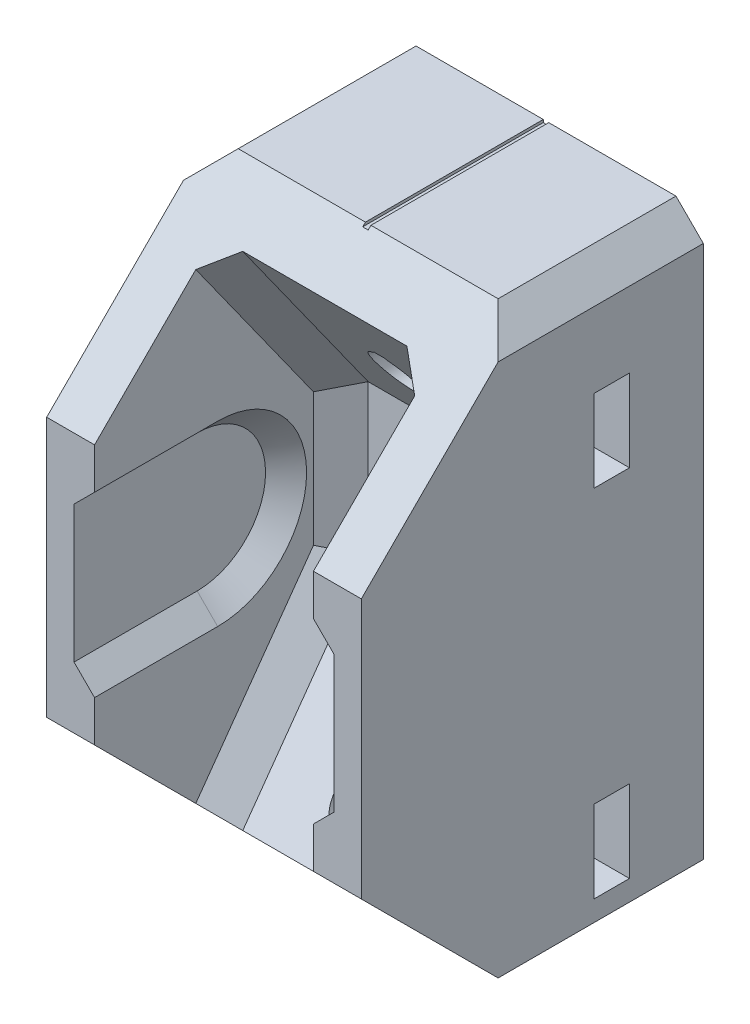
ISO-10303-21;
HEADER;
FILE_DESCRIPTION(('STEP AP214'),'2;1');
FILE_NAME('part.step','',(''),(''),'','','');
FILE_SCHEMA(('AUTOMOTIVE_DESIGN { 1 0 10303 214 1 1 1 1 }'));
ENDSEC;
DATA;
#1=APPLICATION_CONTEXT('core data for automotive mechanical design processes');
#2=APPLICATION_PROTOCOL_DEFINITION('international standard','automotive_design',2000,#1);
#3=PRODUCT_CONTEXT('',#1,'mechanical');
#4=PRODUCT('Part','Part','',(#3));
#5=PRODUCT_RELATED_PRODUCT_CATEGORY('part','',(#4));
#6=PRODUCT_DEFINITION_FORMATION('','',#4);
#7=PRODUCT_DEFINITION_CONTEXT('part definition',#1,'design');
#8=PRODUCT_DEFINITION('design','',#6,#7);
#9=PRODUCT_DEFINITION_SHAPE('','',#8);
#10=(LENGTH_UNIT() NAMED_UNIT(*) SI_UNIT(.MILLI.,.METRE.));
#11=(NAMED_UNIT(*) PLANE_ANGLE_UNIT() SI_UNIT($,.RADIAN.));
#12=(NAMED_UNIT(*) SI_UNIT($,.STERADIAN.) SOLID_ANGLE_UNIT());
#13=UNCERTAINTY_MEASURE_WITH_UNIT(LENGTH_MEASURE(1.E-05),#10,'distance_accuracy_value','');
#14=(GEOMETRIC_REPRESENTATION_CONTEXT(3) GLOBAL_UNCERTAINTY_ASSIGNED_CONTEXT((#13)) GLOBAL_UNIT_ASSIGNED_CONTEXT((#10,
#11,#12)) REPRESENTATION_CONTEXT('',''));
#15=CARTESIAN_POINT('',(0.,0.,0.));
#16=DIRECTION('',(0.,0.,1.));
#17=DIRECTION('',(1.,0.,0.));
#18=AXIS2_PLACEMENT_3D('',#15,#16,#17);
#19=CARTESIAN_POINT('',(-11.5,21.5,-7.));
#20=DIRECTION('',(0.,-1.,0.));
#21=DIRECTION('',(0.,0.,-1.));
#22=AXIS2_PLACEMENT_3D('',#19,#20,#21);
#23=PLANE('',#22);
#24=DIRECTION('',(1.,0.,0.));
#25=VECTOR('',#24,1.);
#26=CARTESIAN_POINT('',(-11.5,21.5,-7.));
#27=LINE('',#26,#25);
#28=CARTESIAN_POINT('',(0.2,21.5,-7.));
#29=VERTEX_POINT('',#28);
#30=CARTESIAN_POINT('',(9.49999999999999,21.5,-7.));
#31=VERTEX_POINT('',#30);
#32=EDGE_CURVE('E1166',#29,#31,#27,.T.);
#33=ORIENTED_EDGE('',*,*,#32,.F.);
#34=DIRECTION('',(0.,0.,-1.));
#35=VECTOR('',#34,1.);
#36=CARTESIAN_POINT('',(0.2,21.5,18.));
#37=LINE('',#36,#35);
#38=CARTESIAN_POINT('',(0.2,21.5,5.9999999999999));
#39=VERTEX_POINT('',#38);
#40=EDGE_CURVE('E586',#39,#29,#37,.T.);
#41=ORIENTED_EDGE('',*,*,#40,.F.);
#42=DIRECTION('',(1.,0.,0.));
#43=VECTOR('',#42,1.);
#44=CARTESIAN_POINT('',(-11.5,21.5,5.99999999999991));
#45=LINE('',#44,#43);
#46=CARTESIAN_POINT('',(9.49999999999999,21.5,5.99999999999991));
#47=VERTEX_POINT('',#46);
#48=EDGE_CURVE('E1235',#39,#47,#45,.T.);
#49=ORIENTED_EDGE('',*,*,#48,.T.);
#50=DIRECTION('',(0.,0.,-1.));
#51=VECTOR('',#50,1.);
#52=CARTESIAN_POINT('',(9.49999999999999,21.5,-6.99999999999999));
#53=LINE('',#52,#51);
#54=EDGE_CURVE('E1238',#47,#31,#53,.T.);
#55=ORIENTED_EDGE('',*,*,#54,.T.);
#56=EDGE_LOOP('',(#33,#41,#49,#55));
#57=FACE_BOUND('',#56,.T.);
#58=ADVANCED_FACE('F37',(#57),#23,.F.);
#59=CARTESIAN_POINT('',(0.,-15.,-7.));
#60=DIRECTION('',(0.,0.,-1.));
#61=DIRECTION('',(-1.,0.,0.));
#62=AXIS2_PLACEMENT_3D('',#59,#60,#61);
#63=CYLINDRICAL_SURFACE('',#62,1.7);
#64=DIRECTION('',(0.,0.,-1.));
#65=VECTOR('',#64,1.);
#66=CARTESIAN_POINT('',(-0.574456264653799,-13.4,18.));
#67=LINE('',#66,#65);
#68=CARTESIAN_POINT('',(-0.574456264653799,-13.4,5.64285714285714));
#69=VERTEX_POINT('',#68);
#70=CARTESIAN_POINT('',(-0.574456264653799,-13.4,1.));
#71=VERTEX_POINT('',#70);
#72=EDGE_CURVE('E606',#69,#71,#67,.T.);
#73=ORIENTED_EDGE('',*,*,#72,.F.);
#74=CARTESIAN_POINT('',(0.,-15.,6.78571428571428));
#75=DIRECTION('',(0.,0.581238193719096,0.813733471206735));
#76=DIRECTION('',(0.,0.813733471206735,-0.581238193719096));
#77=AXIS2_PLACEMENT_3D('',#74,#75,#76);
#78=ELLIPSE('',#77,2.08913613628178,1.7);
#79=CARTESIAN_POINT('',(0.574456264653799,-13.4,5.64285714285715));
#80=VERTEX_POINT('',#79);
#81=EDGE_CURVE('E1034',#69,#80,#78,.T.);
#82=ORIENTED_EDGE('',*,*,#81,.T.);
#83=DIRECTION('',(0.,0.,-1.));
#84=VECTOR('',#83,1.);
#85=CARTESIAN_POINT('',(0.574456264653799,-13.4,18.));
#86=LINE('',#85,#84);
#87=CARTESIAN_POINT('',(0.574456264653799,-13.4,1.));
#88=VERTEX_POINT('',#87);
#89=EDGE_CURVE('E620',#80,#88,#86,.T.);
#90=ORIENTED_EDGE('',*,*,#89,.T.);
#91=CARTESIAN_POINT('',(0.,-15.,1.));
#92=DIRECTION('',(0.,0.,-1.));
#93=DIRECTION('',(-1.,0.,0.));
#94=AXIS2_PLACEMENT_3D('',#91,#92,#93);
#95=CIRCLE('',#94,1.7);
#96=EDGE_CURVE('E1028',#71,#88,#95,.F.);
#97=ORIENTED_EDGE('',*,*,#96,.F.);
#98=EDGE_LOOP('',(#73,#82,#90,#97));
#99=FACE_BOUND('',#98,.T.);
#100=ADVANCED_FACE('F816',(#99),#63,.F.);
#101=CARTESIAN_POINT('',(0.,11.,-7.));
#102=DIRECTION('',(0.,0.,-1.));
#103=DIRECTION('',(-1.,0.,0.));
#104=AXIS2_PLACEMENT_3D('',#101,#102,#103);
#105=CYLINDRICAL_SURFACE('',#104,1.7);
#106=DIRECTION('',(0.,0.,-1.));
#107=VECTOR('',#106,1.);
#108=CARTESIAN_POINT('',(-0.574456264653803,12.6,18.));
#109=LINE('',#108,#107);
#110=CARTESIAN_POINT('',(-0.574456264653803,12.6,5.07142857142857));
#111=VERTEX_POINT('',#110);
#112=CARTESIAN_POINT('',(-0.574456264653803,12.6,1.));
#113=VERTEX_POINT('',#112);
#114=EDGE_CURVE('E610',#111,#113,#109,.T.);
#115=ORIENTED_EDGE('',*,*,#114,.F.);
#116=CARTESIAN_POINT('',(0.,11.,3.92857142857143));
#117=DIRECTION('',(0.,-0.581238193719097,0.813733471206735));
#118=DIRECTION('',(0.,-0.813733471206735,-0.581238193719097));
#119=AXIS2_PLACEMENT_3D('',#116,#117,#118);
#120=ELLIPSE('',#119,2.08913613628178,1.7);
#121=CARTESIAN_POINT('',(0.574456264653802,12.6,5.07142857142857));
#122=VERTEX_POINT('',#121);
#123=EDGE_CURVE('E1027',#111,#122,#120,.T.);
#124=ORIENTED_EDGE('',*,*,#123,.T.);
#125=DIRECTION('',(0.,0.,-1.));
#126=VECTOR('',#125,1.);
#127=CARTESIAN_POINT('',(0.574456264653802,12.6,18.));
#128=LINE('',#127,#126);
#129=CARTESIAN_POINT('',(0.574456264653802,12.6,1.));
#130=VERTEX_POINT('',#129);
#131=EDGE_CURVE('E611',#122,#130,#128,.T.);
#132=ORIENTED_EDGE('',*,*,#131,.T.);
#133=CARTESIAN_POINT('',(0.,11.,1.));
#134=DIRECTION('',(0.,0.,-1.));
#135=DIRECTION('',(-1.,0.,0.));
#136=AXIS2_PLACEMENT_3D('',#133,#134,#135);
#137=CIRCLE('',#136,1.7);
#138=EDGE_CURVE('E1172',#113,#130,#137,.F.);
#139=ORIENTED_EDGE('',*,*,#138,.F.);
#140=EDGE_LOOP('',(#115,#124,#132,#139));
#141=FACE_BOUND('',#140,.T.);
#142=ADVANCED_FACE('F825',(#141),#105,.F.);
#143=CARTESIAN_POINT('',(8.,-5.5,0.));
#144=DIRECTION('',(0.,0.581238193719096,0.813733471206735));
#145=DIRECTION('',(0.,-0.813733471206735,0.581238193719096));
#146=AXIS2_PLACEMENT_3D('',#143,#144,#145);
#147=PLANE('',#146);
#148=DIRECTION('',(0.,0.813733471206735,-0.581238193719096));
#149=VECTOR('',#148,1.);
#150=CARTESIAN_POINT('',(-6.00000000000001,-5.5,0.));
#151=LINE('',#150,#149);
#152=CARTESIAN_POINT('',(-6.00000000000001,-18.3333333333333,9.16666666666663));
#153=VERTEX_POINT('',#152);
#154=CARTESIAN_POINT('',(-6.00000000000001,-5.5,0.));
#155=VERTEX_POINT('',#154);
#156=EDGE_CURVE('E1080',#153,#155,#151,.T.);
#157=ORIENTED_EDGE('',*,*,#156,.F.);
#158=DIRECTION('',(-1.,0.,0.));
#159=VECTOR('',#158,1.);
#160=CARTESIAN_POINT('',(8.,-18.3333333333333,9.16666666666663));
#161=LINE('',#160,#159);
#162=CARTESIAN_POINT('',(5.99999999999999,-18.3333333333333,9.16666666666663));
#163=VERTEX_POINT('',#162);
#164=EDGE_CURVE('E1208',#153,#163,#161,.F.);
#165=ORIENTED_EDGE('',*,*,#164,.T.);
#166=DIRECTION('',(0.,-0.813733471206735,0.581238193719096));
#167=VECTOR('',#166,1.);
#168=CARTESIAN_POINT('',(5.99999999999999,-5.5,0.));
#169=LINE('',#168,#167);
#170=CARTESIAN_POINT('',(5.99999999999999,-5.5,0.));
#171=VERTEX_POINT('',#170);
#172=EDGE_CURVE('E1082',#171,#163,#169,.T.);
#173=ORIENTED_EDGE('',*,*,#172,.F.);
#174=DIRECTION('',(-1.,0.,0.));
#175=VECTOR('',#174,1.);
#176=CARTESIAN_POINT('',(8.,-5.5,0.));
#177=LINE('',#176,#175);
#178=EDGE_CURVE('E1109',#171,#155,#177,.T.);
#179=ORIENTED_EDGE('',*,*,#178,.T.);
#180=EDGE_LOOP('',(#157,#165,#173,#179));
#181=FACE_BOUND('',#180,.T.);
#182=ORIENTED_EDGE('',*,*,#81,.F.);
#183=DIRECTION('',(0.631168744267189,0.631168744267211,-0.450834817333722));
#184=VECTOR('',#183,1.);
#185=CARTESIAN_POINT('',(-3.93136683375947,-16.7569105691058,8.04065040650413));
#186=LINE('',#185,#184);
#187=CARTESIAN_POINT('',(-0.374456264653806,-13.2,5.5));
#188=VERTEX_POINT('',#187);
#189=EDGE_CURVE('E1614',#69,#188,#186,.T.);
#190=ORIENTED_EDGE('',*,*,#189,.T.);
#191=DIRECTION('',(-1.,0.,0.));
#192=VECTOR('',#191,1.);
#193=CARTESIAN_POINT('',(8.,-13.2,5.5));
#194=LINE('',#193,#192);
#195=CARTESIAN_POINT('',(0.374456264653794,-13.2,5.5));
#196=VERTEX_POINT('',#195);
#197=EDGE_CURVE('E626',#196,#188,#194,.T.);
#198=ORIENTED_EDGE('',*,*,#197,.F.);
#199=DIRECTION('',(-0.631168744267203,0.631168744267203,-0.450834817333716));
#200=VECTOR('',#199,1.);
#201=CARTESIAN_POINT('',(4.09071642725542,-16.9162601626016,8.15447154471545));
#202=LINE('',#201,#200);
#203=EDGE_CURVE('E1618',#196,#80,#202,.F.);
#204=ORIENTED_EDGE('',*,*,#203,.T.);
#205=EDGE_LOOP('',(#182,#190,#198,#204));
#206=FACE_BOUND('',#205,.T.);
#207=ADVANCED_FACE('F903',(#181,#206),#147,.T.);
#208=CARTESIAN_POINT('',(8.,19.5,10.));
#209=DIRECTION('',(0.,-0.581238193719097,0.813733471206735));
#210=DIRECTION('',(0.,-0.813733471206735,-0.581238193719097));
#211=AXIS2_PLACEMENT_3D('',#208,#209,#210);
#212=PLANE('',#211);
#213=DIRECTION('',(0.,-0.813733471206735,-0.581238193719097));
#214=VECTOR('',#213,1.);
#215=CARTESIAN_POINT('',(5.99999999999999,19.5,10.));
#216=LINE('',#215,#214);
#217=CARTESIAN_POINT('',(5.99999999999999,18.3333333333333,9.16666666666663));
#218=VERTEX_POINT('',#217);
#219=CARTESIAN_POINT('',(5.99999999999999,5.5,0.));
#220=VERTEX_POINT('',#219);
#221=EDGE_CURVE('E1072',#218,#220,#216,.T.);
#222=ORIENTED_EDGE('',*,*,#221,.F.);
#223=DIRECTION('',(1.,0.,0.));
#224=VECTOR('',#223,1.);
#225=CARTESIAN_POINT('',(8.,18.3333333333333,9.16666666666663));
#226=LINE('',#225,#224);
#227=CARTESIAN_POINT('',(-6.00000000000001,18.3333333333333,9.16666666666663));
#228=VERTEX_POINT('',#227);
#229=EDGE_CURVE('E1231',#218,#228,#226,.F.);
#230=ORIENTED_EDGE('',*,*,#229,.T.);
#231=DIRECTION('',(0.,0.813733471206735,0.581238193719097));
#232=VECTOR('',#231,1.);
#233=CARTESIAN_POINT('',(-6.00000000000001,19.5,10.));
#234=LINE('',#233,#232);
#235=CARTESIAN_POINT('',(-6.00000000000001,5.5,0.));
#236=VERTEX_POINT('',#235);
#237=EDGE_CURVE('E1069',#236,#228,#234,.T.);
#238=ORIENTED_EDGE('',*,*,#237,.F.);
#239=DIRECTION('',(-1.,0.,0.));
#240=VECTOR('',#239,1.);
#241=CARTESIAN_POINT('',(8.,5.5,0.));
#242=LINE('',#241,#240);
#243=EDGE_CURVE('E1112',#220,#236,#242,.T.);
#244=ORIENTED_EDGE('',*,*,#243,.F.);
#245=EDGE_LOOP('',(#222,#230,#238,#244));
#246=FACE_BOUND('',#245,.T.);
#247=ORIENTED_EDGE('',*,*,#123,.F.);
#248=DIRECTION('',(0.631168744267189,0.631168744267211,0.450834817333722));
#249=VECTOR('',#248,1.);
#250=CARTESIAN_POINT('',(3.26375511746,16.4382113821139,7.81300813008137));
#251=LINE('',#250,#249);
#252=CARTESIAN_POINT('',(-0.374456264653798,12.8,5.21428571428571));
#253=VERTEX_POINT('',#252);
#254=EDGE_CURVE('E1350',#111,#253,#251,.T.);
#255=ORIENTED_EDGE('',*,*,#254,.T.);
#256=DIRECTION('',(-1.,0.,0.));
#257=VECTOR('',#256,1.);
#258=CARTESIAN_POINT('',(8.00000000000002,12.8,5.21428571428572));
#259=LINE('',#258,#257);
#260=CARTESIAN_POINT('',(0.374456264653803,12.8,5.21428571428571));
#261=VERTEX_POINT('',#260);
#262=EDGE_CURVE('E632',#261,#253,#259,.T.);
#263=ORIENTED_EDGE('',*,*,#262,.F.);
#264=DIRECTION('',(-0.631168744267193,0.631168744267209,0.450834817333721));
#265=VECTOR('',#264,1.);
#266=CARTESIAN_POINT('',(-3.10440552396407,16.278861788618,7.69918699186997));
#267=LINE('',#266,#265);
#268=EDGE_CURVE('E1342',#261,#122,#267,.F.);
#269=ORIENTED_EDGE('',*,*,#268,.T.);
#270=EDGE_LOOP('',(#247,#255,#263,#269));
#271=FACE_BOUND('',#270,.T.);
#272=ADVANCED_FACE('F901',(#246,#271),#212,.T.);
#273=CARTESIAN_POINT('',(0.,0.,-7.));
#274=DIRECTION('',(0.,0.,1.));
#275=DIRECTION('',(1.,0.,0.));
#276=AXIS2_PLACEMENT_3D('',#273,#274,#275);
#277=PLANE('',#276);
#278=DIRECTION('',(1.,0.,0.));
#279=VECTOR('',#278,1.);
#280=CARTESIAN_POINT('',(0.,-13.2,-7.));
#281=LINE('',#280,#279);
#282=CARTESIAN_POINT('',(-0.374456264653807,-13.2,-7.));
#283=VERTEX_POINT('',#282);
#284=CARTESIAN_POINT('',(0.374456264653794,-13.2,-7.));
#285=VERTEX_POINT('',#284);
#286=EDGE_CURVE('E597',#283,#285,#281,.T.);
#287=ORIENTED_EDGE('',*,*,#286,.F.);
#288=DIRECTION('',(-0.707106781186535,-0.70710678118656,0.));
#289=VECTOR('',#288,1.);
#290=CARTESIAN_POINT('',(6.41277186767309,-6.41277186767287,-7.));
#291=LINE('',#290,#289);
#292=CARTESIAN_POINT('',(-0.574456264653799,-13.4,-7.));
#293=VERTEX_POINT('',#292);
#294=EDGE_CURVE('E1612',#283,#293,#291,.T.);
#295=ORIENTED_EDGE('',*,*,#294,.T.);
#296=CARTESIAN_POINT('',(0.,-15.,-7.));
#297=DIRECTION('',(0.,0.,-1.));
#298=DIRECTION('',(-1.,0.,0.));
#299=AXIS2_PLACEMENT_3D('',#296,#297,#298);
#300=CIRCLE('',#299,1.7);
#301=CARTESIAN_POINT('',(0.574456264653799,-13.4,-7.));
#302=VERTEX_POINT('',#301);
#303=EDGE_CURVE('E1031',#302,#293,#300,.T.);
#304=ORIENTED_EDGE('',*,*,#303,.F.);
#305=DIRECTION('',(0.707106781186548,-0.707106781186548,0.));
#306=VECTOR('',#305,1.);
#307=CARTESIAN_POINT('',(-6.4127718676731,-6.41277186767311,-7.));
#308=LINE('',#307,#306);
#309=EDGE_CURVE('E1624',#302,#285,#308,.F.);
#310=ORIENTED_EDGE('',*,*,#309,.T.);
#311=EDGE_LOOP('',(#287,#295,#304,#310));
#312=FACE_BOUND('',#311,.T.);
#313=CARTESIAN_POINT('',(0.,17.,-7.));
#314=DIRECTION('',(0.,0.,-1.));
#315=DIRECTION('',(-1.,0.,0.));
#316=AXIS2_PLACEMENT_3D('',#313,#314,#315);
#317=CIRCLE('',#316,1.69999999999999);
#318=CARTESIAN_POINT('',(0.574456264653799,18.6,-7.));
#319=VERTEX_POINT('',#318);
#320=CARTESIAN_POINT('',(-0.574456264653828,18.6,-7.));
#321=VERTEX_POINT('',#320);
#322=EDGE_CURVE('E950',#319,#321,#317,.T.);
#323=ORIENTED_EDGE('',*,*,#322,.F.);
#324=DIRECTION('',(0.707106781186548,-0.707106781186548,0.));
#325=VECTOR('',#324,1.);
#326=CARTESIAN_POINT('',(9.58722813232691,9.58722813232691,-7.));
#327=LINE('',#326,#325);
#328=CARTESIAN_POINT('',(0.37445626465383,18.8,-7.));
#329=VERTEX_POINT('',#328);
#330=EDGE_CURVE('E1362',#319,#329,#327,.F.);
#331=ORIENTED_EDGE('',*,*,#330,.T.);
#332=DIRECTION('',(1.,0.,0.));
#333=VECTOR('',#332,1.);
#334=CARTESIAN_POINT('',(0.,18.8,-7.));
#335=LINE('',#334,#333);
#336=CARTESIAN_POINT('',(-0.37445626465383,18.8,-7.));
#337=VERTEX_POINT('',#336);
#338=EDGE_CURVE('E758',#337,#329,#335,.T.);
#339=ORIENTED_EDGE('',*,*,#338,.F.);
#340=DIRECTION('',(-0.707106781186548,-0.707106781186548,0.));
#341=VECTOR('',#340,1.);
#342=CARTESIAN_POINT('',(-9.58722813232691,9.58722813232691,-7.));
#343=LINE('',#342,#341);
#344=EDGE_CURVE('E1358',#337,#321,#343,.T.);
#345=ORIENTED_EDGE('',*,*,#344,.T.);
#346=EDGE_LOOP('',(#323,#331,#339,#345));
#347=FACE_BOUND('',#346,.T.);
#348=CARTESIAN_POINT('',(0.,-9.,-7.));
#349=DIRECTION('',(0.,0.,-1.));
#350=DIRECTION('',(-1.,0.,0.));
#351=AXIS2_PLACEMENT_3D('',#348,#349,#350);
#352=CIRCLE('',#351,1.69999999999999);
#353=CARTESIAN_POINT('',(0.574456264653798,-7.40000000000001,-7.));
#354=VERTEX_POINT('',#353);
#355=CARTESIAN_POINT('',(-0.574456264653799,-7.40000000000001,-7.));
#356=VERTEX_POINT('',#355);
#357=EDGE_CURVE('E953',#354,#356,#352,.T.);
#358=ORIENTED_EDGE('',*,*,#357,.F.);
#359=DIRECTION('',(0.707106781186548,-0.707106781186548,0.));
#360=VECTOR('',#359,1.);
#361=CARTESIAN_POINT('',(-3.41277186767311,-3.41277186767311,-7.));
#362=LINE('',#361,#360);
#363=CARTESIAN_POINT('',(0.374456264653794,-7.20000000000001,-7.));
#364=VERTEX_POINT('',#363);
#365=EDGE_CURVE('E955',#354,#364,#362,.F.);
#366=ORIENTED_EDGE('',*,*,#365,.T.);
#367=DIRECTION('',(1.,0.,0.));
#368=VECTOR('',#367,1.);
#369=CARTESIAN_POINT('',(0.,-7.20000000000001,-7.));
#370=LINE('',#369,#368);
#371=CARTESIAN_POINT('',(-0.374456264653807,-7.20000000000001,-7.));
#372=VERTEX_POINT('',#371);
#373=EDGE_CURVE('E635',#372,#364,#370,.T.);
#374=ORIENTED_EDGE('',*,*,#373,.F.);
#375=DIRECTION('',(-0.707106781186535,-0.70710678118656,0.));
#376=VECTOR('',#375,1.);
#377=CARTESIAN_POINT('',(3.4127718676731,-3.41277186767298,-7.));
#378=LINE('',#377,#376);
#379=EDGE_CURVE('E956',#372,#356,#378,.T.);
#380=ORIENTED_EDGE('',*,*,#379,.T.);
#381=EDGE_LOOP('',(#358,#366,#374,#380));
#382=FACE_BOUND('',#381,.T.);
#383=DIRECTION('',(-1.,0.,0.));
#384=VECTOR('',#383,1.);
#385=CARTESIAN_POINT('',(0.2,21.3,-7.));
#386=LINE('',#385,#384);
#387=CARTESIAN_POINT('',(0.2,21.3,-7.));
#388=VERTEX_POINT('',#387);
#389=CARTESIAN_POINT('',(-0.2,21.3,-7.));
#390=VERTEX_POINT('',#389);
#391=EDGE_CURVE('E574',#388,#390,#386,.T.);
#392=ORIENTED_EDGE('',*,*,#391,.F.);
#393=DIRECTION('',(0.,-1.,0.));
#394=VECTOR('',#393,1.);
#395=CARTESIAN_POINT('',(0.2,21.5,-7.));
#396=LINE('',#395,#394);
#397=EDGE_CURVE('E583',#29,#388,#396,.T.);
#398=ORIENTED_EDGE('',*,*,#397,.F.);
#399=ORIENTED_EDGE('',*,*,#32,.T.);
#400=DIRECTION('',(-0.707106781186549,0.707106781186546,0.));
#401=VECTOR('',#400,1.);
#402=CARTESIAN_POINT('',(11.5,19.5,-7.));
#403=LINE('',#402,#401);
#404=CARTESIAN_POINT('',(11.5,19.5,-7.));
#405=VERTEX_POINT('',#404);
#406=EDGE_CURVE('E1266',#31,#405,#403,.F.);
#407=ORIENTED_EDGE('',*,*,#406,.T.);
#408=DIRECTION('',(0.,-1.,0.));
#409=VECTOR('',#408,1.);
#410=CARTESIAN_POINT('',(11.5,21.5,-7.));
#411=LINE('',#410,#409);
#412=CARTESIAN_POINT('',(11.5,-19.5,-7.));
#413=VERTEX_POINT('',#412);
#414=EDGE_CURVE('E1157',#405,#413,#411,.T.);
#415=ORIENTED_EDGE('',*,*,#414,.T.);
#416=DIRECTION('',(0.707106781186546,0.707106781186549,0.));
#417=VECTOR('',#416,1.);
#418=CARTESIAN_POINT('',(9.5,-21.5,-7.));
#419=LINE('',#418,#417);
#420=CARTESIAN_POINT('',(9.5,-21.5,-7.));
#421=VERTEX_POINT('',#420);
#422=EDGE_CURVE('E1262',#413,#421,#419,.F.);
#423=ORIENTED_EDGE('',*,*,#422,.T.);
#424=DIRECTION('',(-1.,0.,0.));
#425=VECTOR('',#424,1.);
#426=CARTESIAN_POINT('',(-11.5,-21.5,-7.));
#427=LINE('',#426,#425);
#428=CARTESIAN_POINT('',(-9.49999999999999,-21.5,-7.));
#429=VERTEX_POINT('',#428);
#430=EDGE_CURVE('E1160',#421,#429,#427,.T.);
#431=ORIENTED_EDGE('',*,*,#430,.T.);
#432=DIRECTION('',(0.707106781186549,-0.707106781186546,0.));
#433=VECTOR('',#432,1.);
#434=CARTESIAN_POINT('',(-11.5,-19.5,-7.));
#435=LINE('',#434,#433);
#436=CARTESIAN_POINT('',(-11.5,-19.5,-7.));
#437=VERTEX_POINT('',#436);
#438=EDGE_CURVE('E1264',#429,#437,#435,.F.);
#439=ORIENTED_EDGE('',*,*,#438,.T.);
#440=DIRECTION('',(0.,1.,0.));
#441=VECTOR('',#440,1.);
#442=CARTESIAN_POINT('',(-11.5,21.5,-7.));
#443=LINE('',#442,#441);
#444=CARTESIAN_POINT('',(-11.5,19.5,-7.));
#445=VERTEX_POINT('',#444);
#446=EDGE_CURVE('E1163',#437,#445,#443,.T.);
#447=ORIENTED_EDGE('',*,*,#446,.T.);
#448=DIRECTION('',(-0.707106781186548,-0.707106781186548,0.));
#449=VECTOR('',#448,1.);
#450=CARTESIAN_POINT('',(-9.5,21.5,-7.));
#451=LINE('',#450,#449);
#452=CARTESIAN_POINT('',(-9.5,21.5,-7.));
#453=VERTEX_POINT('',#452);
#454=EDGE_CURVE('E1268',#445,#453,#451,.F.);
#455=ORIENTED_EDGE('',*,*,#454,.T.);
#456=CARTESIAN_POINT('',(-0.2,21.5,-7.));
#457=VERTEX_POINT('',#456);
#458=EDGE_CURVE('E1167',#453,#457,#27,.T.);
#459=ORIENTED_EDGE('',*,*,#458,.T.);
#460=DIRECTION('',(0.,1.,0.));
#461=VECTOR('',#460,1.);
#462=CARTESIAN_POINT('',(-0.2,21.5,-7.));
#463=LINE('',#462,#461);
#464=EDGE_CURVE('E580',#390,#457,#463,.T.);
#465=ORIENTED_EDGE('',*,*,#464,.F.);
#466=EDGE_LOOP('',(#392,#398,#399,#407,#415,#423,#431,#439,#447,#455,#459,#465));
#467=FACE_BOUND('',#466,.T.);
#468=DIRECTION('',(1.,0.,0.));
#469=VECTOR('',#468,1.);
#470=CARTESIAN_POINT('',(0.,12.8,-7.));
#471=LINE('',#470,#469);
#472=CARTESIAN_POINT('',(-0.374456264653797,12.8,-7.));
#473=VERTEX_POINT('',#472);
#474=CARTESIAN_POINT('',(0.374456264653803,12.8,-7.));
#475=VERTEX_POINT('',#474);
#476=EDGE_CURVE('E602',#473,#475,#471,.T.);
#477=ORIENTED_EDGE('',*,*,#476,.F.);
#478=DIRECTION('',(-0.707106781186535,-0.70710678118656,0.));
#479=VECTOR('',#478,1.);
#480=CARTESIAN_POINT('',(-6.5872281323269,6.58722813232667,-7.));
#481=LINE('',#480,#479);
#482=CARTESIAN_POINT('',(-0.574456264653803,12.6,-7.));
#483=VERTEX_POINT('',#482);
#484=EDGE_CURVE('E1352',#473,#483,#481,.T.);
#485=ORIENTED_EDGE('',*,*,#484,.T.);
#486=CARTESIAN_POINT('',(0.,11.,-7.));
#487=DIRECTION('',(0.,0.,-1.));
#488=DIRECTION('',(-1.,0.,0.));
#489=AXIS2_PLACEMENT_3D('',#486,#487,#488);
#490=CIRCLE('',#489,1.7);
#491=CARTESIAN_POINT('',(0.574456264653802,12.6,-7.));
#492=VERTEX_POINT('',#491);
#493=EDGE_CURVE('E1024',#492,#483,#490,.T.);
#494=ORIENTED_EDGE('',*,*,#493,.F.);
#495=DIRECTION('',(0.707106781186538,-0.707106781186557,0.));
#496=VECTOR('',#495,1.);
#497=CARTESIAN_POINT('',(6.58722813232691,6.58722813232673,-7.));
#498=LINE('',#497,#496);
#499=EDGE_CURVE('E1344',#492,#475,#498,.F.);
#500=ORIENTED_EDGE('',*,*,#499,.T.);
#501=EDGE_LOOP('',(#477,#485,#494,#500));
#502=FACE_BOUND('',#501,.T.);
#503=ADVANCED_FACE('F590',(#312,#347,#382,#467,#502),#277,.F.);
#504=CARTESIAN_POINT('',(-0.574456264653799,-13.4,-1.6));
#505=VERTEX_POINT('',#504);
#506=EDGE_CURVE('E617',#505,#293,#67,.T.);
#507=ORIENTED_EDGE('',*,*,#506,.F.);
#508=CARTESIAN_POINT('',(0.,-15.,-1.6));
#509=DIRECTION('',(0.,0.,-1.));
#510=DIRECTION('',(-1.,0.,0.));
#511=AXIS2_PLACEMENT_3D('',#508,#509,#510);
#512=CIRCLE('',#511,1.7);
#513=CARTESIAN_POINT('',(0.574456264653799,-13.4,-1.6));
#514=VERTEX_POINT('',#513);
#515=EDGE_CURVE('E1175',#505,#514,#512,.F.);
#516=ORIENTED_EDGE('',*,*,#515,.T.);
#517=EDGE_CURVE('E616',#514,#302,#86,.T.);
#518=ORIENTED_EDGE('',*,*,#517,.T.);
#519=ORIENTED_EDGE('',*,*,#303,.T.);
#520=EDGE_LOOP('',(#507,#516,#518,#519));
#521=FACE_BOUND('',#520,.T.);
#522=ADVANCED_FACE('F828',(#521),#63,.F.);
#523=CARTESIAN_POINT('',(-0.574456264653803,12.6,-1.6));
#524=VERTEX_POINT('',#523);
#525=EDGE_CURVE('E607',#524,#483,#109,.T.);
#526=ORIENTED_EDGE('',*,*,#525,.F.);
#527=CARTESIAN_POINT('',(0.,11.,-1.6));
#528=DIRECTION('',(0.,0.,-1.));
#529=DIRECTION('',(-1.,0.,0.));
#530=AXIS2_PLACEMENT_3D('',#527,#528,#529);
#531=CIRCLE('',#530,1.7);
#532=CARTESIAN_POINT('',(0.574456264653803,12.6,-1.6));
#533=VERTEX_POINT('',#532);
#534=EDGE_CURVE('E994',#524,#533,#531,.F.);
#535=ORIENTED_EDGE('',*,*,#534,.T.);
#536=EDGE_CURVE('E605',#533,#492,#128,.T.);
#537=ORIENTED_EDGE('',*,*,#536,.T.);
#538=ORIENTED_EDGE('',*,*,#493,.T.);
#539=EDGE_LOOP('',(#526,#535,#537,#538));
#540=FACE_BOUND('',#539,.T.);
#541=ADVANCED_FACE('F943',(#540),#105,.F.);
#542=CARTESIAN_POINT('',(0.,0.,1.));
#543=DIRECTION('',(0.,0.,-1.));
#544=DIRECTION('',(-1.,0.,0.));
#545=AXIS2_PLACEMENT_3D('',#542,#543,#544);
#546=PLANE('',#545);
#547=DIRECTION('',(-1.,0.,0.));
#548=VECTOR('',#547,1.);
#549=CARTESIAN_POINT('',(1.73205080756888,8.00000000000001,1.));
#550=LINE('',#549,#548);
#551=CARTESIAN_POINT('',(11.5,8.00000000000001,1.));
#552=VERTEX_POINT('',#551);
#553=CARTESIAN_POINT('',(-1.73205080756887,8.00000000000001,1.));
#554=VERTEX_POINT('',#553);
#555=EDGE_CURVE('E1001',#552,#554,#550,.T.);
#556=ORIENTED_EDGE('',*,*,#555,.T.);
#557=DIRECTION('',(-0.5,0.866025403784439,0.));
#558=VECTOR('',#557,1.);
#559=CARTESIAN_POINT('',(-1.73205080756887,8.00000000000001,1.));
#560=LINE('',#559,#558);
#561=CARTESIAN_POINT('',(-3.46410161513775,11.,1.));
#562=VERTEX_POINT('',#561);
#563=EDGE_CURVE('E1004',#554,#562,#560,.T.);
#564=ORIENTED_EDGE('',*,*,#563,.T.);
#565=DIRECTION('',(0.5,0.866025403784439,0.));
#566=VECTOR('',#565,1.);
#567=CARTESIAN_POINT('',(-3.46410161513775,11.,1.));
#568=LINE('',#567,#566);
#569=CARTESIAN_POINT('',(-1.73205080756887,14.,1.));
#570=VERTEX_POINT('',#569);
#571=EDGE_CURVE('E1007',#562,#570,#568,.T.);
#572=ORIENTED_EDGE('',*,*,#571,.T.);
#573=DIRECTION('',(1.,0.,0.));
#574=VECTOR('',#573,1.);
#575=CARTESIAN_POINT('',(-1.73205080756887,14.,1.));
#576=LINE('',#575,#574);
#577=CARTESIAN_POINT('',(11.5,14.,1.));
#578=VERTEX_POINT('',#577);
#579=EDGE_CURVE('E999',#570,#578,#576,.T.);
#580=ORIENTED_EDGE('',*,*,#579,.T.);
#581=DIRECTION('',(0.,-1.,0.));
#582=VECTOR('',#581,1.);
#583=CARTESIAN_POINT('',(11.5,8.00000000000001,1.));
#584=LINE('',#583,#582);
#585=EDGE_CURVE('E1512',#578,#552,#584,.T.);
#586=ORIENTED_EDGE('',*,*,#585,.T.);
#587=EDGE_LOOP('',(#556,#564,#572,#580,#586));
#588=FACE_BOUND('',#587,.T.);
#589=DIRECTION('',(1.,0.,0.));
#590=VECTOR('',#589,1.);
#591=CARTESIAN_POINT('',(0.,12.8,1.));
#592=LINE('',#591,#590);
#593=CARTESIAN_POINT('',(-0.374456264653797,12.8,1.));
#594=VERTEX_POINT('',#593);
#595=CARTESIAN_POINT('',(0.374456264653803,12.8,1.));
#596=VERTEX_POINT('',#595);
#597=EDGE_CURVE('E629',#594,#596,#592,.T.);
#598=ORIENTED_EDGE('',*,*,#597,.F.);
#599=DIRECTION('',(-0.707106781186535,-0.70710678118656,0.));
#600=VECTOR('',#599,1.);
#601=CARTESIAN_POINT('',(-0.374456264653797,12.8,1.));
#602=LINE('',#601,#600);
#603=EDGE_CURVE('E1348',#594,#113,#602,.T.);
#604=ORIENTED_EDGE('',*,*,#603,.T.);
#605=ORIENTED_EDGE('',*,*,#138,.T.);
#606=DIRECTION('',(0.707106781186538,-0.707106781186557,0.));
#607=VECTOR('',#606,1.);
#608=CARTESIAN_POINT('',(0.574456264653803,12.6,1.));
#609=LINE('',#608,#607);
#610=EDGE_CURVE('E1336',#130,#596,#609,.F.);
#611=ORIENTED_EDGE('',*,*,#610,.T.);
#612=EDGE_LOOP('',(#598,#604,#605,#611));
#613=FACE_BOUND('',#612,.T.);
#614=ADVANCED_FACE('F1872',(#588,#613),#546,.T.);
#615=CARTESIAN_POINT('',(0.,0.,-1.6));
#616=DIRECTION('',(0.,0.,-1.));
#617=DIRECTION('',(-1.,0.,0.));
#618=AXIS2_PLACEMENT_3D('',#615,#616,#617);
#619=PLANE('',#618);
#620=DIRECTION('',(-0.5,0.866025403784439,0.));
#621=VECTOR('',#620,1.);
#622=CARTESIAN_POINT('',(-1.73205080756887,8.00000000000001,-1.6));
#623=LINE('',#622,#621);
#624=CARTESIAN_POINT('',(-1.73205080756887,8.00000000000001,-1.6));
#625=VERTEX_POINT('',#624);
#626=CARTESIAN_POINT('',(-3.46410161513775,11.,-1.6));
#627=VERTEX_POINT('',#626);
#628=EDGE_CURVE('E1014',#625,#627,#623,.T.);
#629=ORIENTED_EDGE('',*,*,#628,.F.);
#630=DIRECTION('',(-1.,0.,0.));
#631=VECTOR('',#630,1.);
#632=CARTESIAN_POINT('',(1.73205080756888,8.00000000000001,-1.6));
#633=LINE('',#632,#631);
#634=CARTESIAN_POINT('',(11.5,8.00000000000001,-1.6));
#635=VERTEX_POINT('',#634);
#636=EDGE_CURVE('E1012',#635,#625,#633,.T.);
#637=ORIENTED_EDGE('',*,*,#636,.F.);
#638=DIRECTION('',(0.,1.,0.));
#639=VECTOR('',#638,1.);
#640=CARTESIAN_POINT('',(11.5,8.00000000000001,-1.6));
#641=LINE('',#640,#639);
#642=CARTESIAN_POINT('',(11.5,14.,-1.6));
#643=VERTEX_POINT('',#642);
#644=EDGE_CURVE('E1519',#635,#643,#641,.T.);
#645=ORIENTED_EDGE('',*,*,#644,.T.);
#646=DIRECTION('',(1.,0.,0.));
#647=VECTOR('',#646,1.);
#648=CARTESIAN_POINT('',(-1.73205080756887,14.,-1.6));
#649=LINE('',#648,#647);
#650=CARTESIAN_POINT('',(-1.73205080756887,14.,-1.6));
#651=VERTEX_POINT('',#650);
#652=EDGE_CURVE('E964',#651,#643,#649,.T.);
#653=ORIENTED_EDGE('',*,*,#652,.F.);
#654=DIRECTION('',(0.5,0.866025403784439,0.));
#655=VECTOR('',#654,1.);
#656=CARTESIAN_POINT('',(-3.46410161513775,11.,-1.6));
#657=LINE('',#656,#655);
#658=EDGE_CURVE('E1002',#627,#651,#657,.T.);
#659=ORIENTED_EDGE('',*,*,#658,.F.);
#660=EDGE_LOOP('',(#629,#637,#645,#653,#659));
#661=FACE_BOUND('',#660,.T.);
#662=ORIENTED_EDGE('',*,*,#534,.F.);
#663=DIRECTION('',(0.707106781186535,0.70710678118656,0.));
#664=VECTOR('',#663,1.);
#665=CARTESIAN_POINT('',(-6.5872281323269,6.58722813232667,-1.6));
#666=LINE('',#665,#664);
#667=CARTESIAN_POINT('',(-0.374456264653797,12.8,-1.6));
#668=VERTEX_POINT('',#667);
#669=EDGE_CURVE('E1354',#524,#668,#666,.T.);
#670=ORIENTED_EDGE('',*,*,#669,.T.);
#671=DIRECTION('',(1.,0.,0.));
#672=VECTOR('',#671,1.);
#673=CARTESIAN_POINT('',(0.,12.8,-1.6));
#674=LINE('',#673,#672);
#675=CARTESIAN_POINT('',(0.374456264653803,12.8,-1.6));
#676=VERTEX_POINT('',#675);
#677=EDGE_CURVE('E1292',#668,#676,#674,.T.);
#678=ORIENTED_EDGE('',*,*,#677,.T.);
#679=DIRECTION('',(-0.707106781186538,0.707106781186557,0.));
#680=VECTOR('',#679,1.);
#681=CARTESIAN_POINT('',(6.5872281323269,6.58722813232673,-1.6));
#682=LINE('',#681,#680);
#683=EDGE_CURVE('E1346',#676,#533,#682,.F.);
#684=ORIENTED_EDGE('',*,*,#683,.T.);
#685=EDGE_LOOP('',(#662,#670,#678,#684));
#686=FACE_BOUND('',#685,.T.);
#687=ADVANCED_FACE('F1862',(#661,#686),#619,.F.);
#688=CARTESIAN_POINT('',(0.,0.,1.));
#689=DIRECTION('',(0.,0.,-1.));
#690=DIRECTION('',(-1.,0.,0.));
#691=AXIS2_PLACEMENT_3D('',#688,#689,#690);
#692=PLANE('',#691);
#693=DIRECTION('',(0.,-1.,0.));
#694=VECTOR('',#693,1.);
#695=CARTESIAN_POINT('',(11.5,-12.,1.));
#696=LINE('',#695,#694);
#697=CARTESIAN_POINT('',(11.5,-12.,1.));
#698=VERTEX_POINT('',#697);
#699=CARTESIAN_POINT('',(11.5,-18.,1.));
#700=VERTEX_POINT('',#699);
#701=EDGE_CURVE('E1511',#698,#700,#696,.T.);
#702=ORIENTED_EDGE('',*,*,#701,.T.);
#703=DIRECTION('',(-1.,0.,0.));
#704=VECTOR('',#703,1.);
#705=CARTESIAN_POINT('',(1.73205080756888,-18.,1.));
#706=LINE('',#705,#704);
#707=CARTESIAN_POINT('',(-1.73205080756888,-18.,1.));
#708=VERTEX_POINT('',#707);
#709=EDGE_CURVE('E976',#700,#708,#706,.T.);
#710=ORIENTED_EDGE('',*,*,#709,.T.);
#711=DIRECTION('',(-0.5,0.866025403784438,0.));
#712=VECTOR('',#711,1.);
#713=CARTESIAN_POINT('',(-1.73205080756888,-18.,1.));
#714=LINE('',#713,#712);
#715=CARTESIAN_POINT('',(-3.46410161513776,-15.,1.));
#716=VERTEX_POINT('',#715);
#717=EDGE_CURVE('E978',#708,#716,#714,.T.);
#718=ORIENTED_EDGE('',*,*,#717,.T.);
#719=DIRECTION('',(0.5,0.866025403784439,0.));
#720=VECTOR('',#719,1.);
#721=CARTESIAN_POINT('',(-3.46410161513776,-15.,1.));
#722=LINE('',#721,#720);
#723=CARTESIAN_POINT('',(-1.73205080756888,-12.,1.));
#724=VERTEX_POINT('',#723);
#725=EDGE_CURVE('E970',#716,#724,#722,.T.);
#726=ORIENTED_EDGE('',*,*,#725,.T.);
#727=DIRECTION('',(1.,0.,0.));
#728=VECTOR('',#727,1.);
#729=CARTESIAN_POINT('',(-1.73205080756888,-12.,1.));
#730=LINE('',#729,#728);
#731=EDGE_CURVE('E973',#724,#698,#730,.T.);
#732=ORIENTED_EDGE('',*,*,#731,.T.);
#733=EDGE_LOOP('',(#702,#710,#718,#726,#732));
#734=FACE_BOUND('',#733,.T.);
#735=DIRECTION('',(1.,0.,0.));
#736=VECTOR('',#735,1.);
#737=CARTESIAN_POINT('',(0.,-13.2,1.));
#738=LINE('',#737,#736);
#739=CARTESIAN_POINT('',(-0.374456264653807,-13.2,1.));
#740=VERTEX_POINT('',#739);
#741=CARTESIAN_POINT('',(0.374456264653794,-13.2,1.));
#742=VERTEX_POINT('',#741);
#743=EDGE_CURVE('E623',#740,#742,#738,.T.);
#744=ORIENTED_EDGE('',*,*,#743,.F.);
#745=DIRECTION('',(-0.707106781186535,-0.70710678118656,0.));
#746=VECTOR('',#745,1.);
#747=CARTESIAN_POINT('',(-0.374456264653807,-13.2,1.));
#748=LINE('',#747,#746);
#749=EDGE_CURVE('E1616',#740,#71,#748,.T.);
#750=ORIENTED_EDGE('',*,*,#749,.T.);
#751=ORIENTED_EDGE('',*,*,#96,.T.);
#752=DIRECTION('',(0.707106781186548,-0.707106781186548,0.));
#753=VECTOR('',#752,1.);
#754=CARTESIAN_POINT('',(0.574456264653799,-13.4,1.));
#755=LINE('',#754,#753);
#756=EDGE_CURVE('E1620',#88,#742,#755,.F.);
#757=ORIENTED_EDGE('',*,*,#756,.T.);
#758=EDGE_LOOP('',(#744,#750,#751,#757));
#759=FACE_BOUND('',#758,.T.);
#760=ADVANCED_FACE('F665',(#734,#759),#692,.T.);
#761=CARTESIAN_POINT('',(0.,0.,-1.6));
#762=DIRECTION('',(0.,0.,-1.));
#763=DIRECTION('',(-1.,0.,0.));
#764=AXIS2_PLACEMENT_3D('',#761,#762,#763);
#765=PLANE('',#764);
#766=DIRECTION('',(-1.,0.,0.));
#767=VECTOR('',#766,1.);
#768=CARTESIAN_POINT('',(1.73205080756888,-18.,-1.6));
#769=LINE('',#768,#767);
#770=CARTESIAN_POINT('',(11.5,-18.,-1.6));
#771=VERTEX_POINT('',#770);
#772=CARTESIAN_POINT('',(-1.73205080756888,-18.,-1.6));
#773=VERTEX_POINT('',#772);
#774=EDGE_CURVE('E988',#771,#773,#769,.T.);
#775=ORIENTED_EDGE('',*,*,#774,.F.);
#776=DIRECTION('',(0.,1.,0.));
#777=VECTOR('',#776,1.);
#778=CARTESIAN_POINT('',(11.5,-18.,-1.6));
#779=LINE('',#778,#777);
#780=CARTESIAN_POINT('',(11.5,-12.,-1.6));
#781=VERTEX_POINT('',#780);
#782=EDGE_CURVE('E1530',#771,#781,#779,.T.);
#783=ORIENTED_EDGE('',*,*,#782,.T.);
#784=DIRECTION('',(1.,0.,0.));
#785=VECTOR('',#784,1.);
#786=CARTESIAN_POINT('',(-1.73205080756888,-12.,-1.6));
#787=LINE('',#786,#785);
#788=CARTESIAN_POINT('',(-1.73205080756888,-12.,-1.6));
#789=VERTEX_POINT('',#788);
#790=EDGE_CURVE('E985',#789,#781,#787,.T.);
#791=ORIENTED_EDGE('',*,*,#790,.F.);
#792=DIRECTION('',(0.5,0.866025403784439,0.));
#793=VECTOR('',#792,1.);
#794=CARTESIAN_POINT('',(-3.46410161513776,-15.,-1.6));
#795=LINE('',#794,#793);
#796=CARTESIAN_POINT('',(-3.46410161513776,-15.,-1.6));
#797=VERTEX_POINT('',#796);
#798=EDGE_CURVE('E982',#797,#789,#795,.T.);
#799=ORIENTED_EDGE('',*,*,#798,.F.);
#800=DIRECTION('',(-0.5,0.866025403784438,0.));
#801=VECTOR('',#800,1.);
#802=CARTESIAN_POINT('',(-1.73205080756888,-18.,-1.6));
#803=LINE('',#802,#801);
#804=EDGE_CURVE('E974',#773,#797,#803,.T.);
#805=ORIENTED_EDGE('',*,*,#804,.F.);
#806=EDGE_LOOP('',(#775,#783,#791,#799,#805));
#807=FACE_BOUND('',#806,.T.);
#808=ORIENTED_EDGE('',*,*,#515,.F.);
#809=DIRECTION('',(0.707106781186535,0.70710678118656,0.));
#810=VECTOR('',#809,1.);
#811=CARTESIAN_POINT('',(6.41277186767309,-6.41277186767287,-1.6));
#812=LINE('',#811,#810);
#813=CARTESIAN_POINT('',(-0.374456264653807,-13.2,-1.6));
#814=VERTEX_POINT('',#813);
#815=EDGE_CURVE('E1608',#505,#814,#812,.T.);
#816=ORIENTED_EDGE('',*,*,#815,.T.);
#817=DIRECTION('',(1.,0.,0.));
#818=VECTOR('',#817,1.);
#819=CARTESIAN_POINT('',(0.,-13.2,-1.6));
#820=LINE('',#819,#818);
#821=CARTESIAN_POINT('',(0.374456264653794,-13.2,-1.6));
#822=VERTEX_POINT('',#821);
#823=EDGE_CURVE('E1289',#814,#822,#820,.T.);
#824=ORIENTED_EDGE('',*,*,#823,.T.);
#825=DIRECTION('',(-0.707106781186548,0.707106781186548,0.));
#826=VECTOR('',#825,1.);
#827=CARTESIAN_POINT('',(-6.4127718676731,-6.4127718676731,-1.6));
#828=LINE('',#827,#826);
#829=EDGE_CURVE('E1622',#822,#514,#828,.F.);
#830=ORIENTED_EDGE('',*,*,#829,.T.);
#831=EDGE_LOOP('',(#808,#816,#824,#830));
#832=FACE_BOUND('',#831,.T.);
#833=ADVANCED_FACE('F1847',(#807,#832),#765,.F.);
#834=CARTESIAN_POINT('',(8.,-19.5,18.));
#835=DIRECTION('',(0.,0.,-1.));
#836=DIRECTION('',(0.,1.,0.));
#837=AXIS2_PLACEMENT_3D('',#834,#835,#836);
#838=PLANE('',#837);
#839=DIRECTION('',(0.,-1.,0.));
#840=VECTOR('',#839,1.);
#841=CARTESIAN_POINT('',(-11.5,21.5,18.));
#842=LINE('',#841,#840);
#843=CARTESIAN_POINT('',(-11.5,9.49999999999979,18.));
#844=VERTEX_POINT('',#843);
#845=CARTESIAN_POINT('',(-11.5,-9.49999999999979,18.));
#846=VERTEX_POINT('',#845);
#847=EDGE_CURVE('E1151',#844,#846,#842,.T.);
#848=ORIENTED_EDGE('',*,*,#847,.T.);
#849=DIRECTION('',(1.,0.,0.));
#850=VECTOR('',#849,1.);
#851=CARTESIAN_POINT('',(8.,-9.49999999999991,18.));
#852=LINE('',#851,#850);
#853=CARTESIAN_POINT('',(-8.,-9.49999999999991,18.));
#854=VERTEX_POINT('',#853);
#855=EDGE_CURVE('E1199',#846,#854,#852,.T.);
#856=ORIENTED_EDGE('',*,*,#855,.T.);
#857=DIRECTION('',(0.,-1.,0.));
#858=VECTOR('',#857,1.);
#859=CARTESIAN_POINT('',(-8.,-19.5,18.));
#860=LINE('',#859,#858);
#861=CARTESIAN_POINT('',(-8.,-6.5,18.));
#862=VERTEX_POINT('',#861);
#863=EDGE_CURVE('E1046',#862,#854,#860,.T.);
#864=ORIENTED_EDGE('',*,*,#863,.F.);
#865=DIRECTION('',(0.707106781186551,-0.707106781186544,0.));
#866=VECTOR('',#865,1.);
#867=CARTESIAN_POINT('',(6.50000000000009,-20.9999999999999,18.));
#868=LINE('',#867,#866);
#869=CARTESIAN_POINT('',(-9.5,-5.,18.));
#870=VERTEX_POINT('',#869);
#871=EDGE_CURVE('E1052',#870,#862,#868,.T.);
#872=ORIENTED_EDGE('',*,*,#871,.F.);
#873=DIRECTION('',(0.,-1.,0.));
#874=VECTOR('',#873,1.);
#875=CARTESIAN_POINT('',(-9.5,0.,18.));
#876=LINE('',#875,#874);
#877=CARTESIAN_POINT('',(-9.5,5.,18.));
#878=VERTEX_POINT('',#877);
#879=EDGE_CURVE('E1049',#878,#870,#876,.T.);
#880=ORIENTED_EDGE('',*,*,#879,.F.);
#881=DIRECTION('',(0.707106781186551,0.707106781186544,0.));
#882=VECTOR('',#881,1.);
#883=CARTESIAN_POINT('',(-12.9999999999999,1.50000000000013,18.));
#884=LINE('',#883,#882);
#885=CARTESIAN_POINT('',(-8.,6.5,18.));
#886=VERTEX_POINT('',#885);
#887=EDGE_CURVE('E1045',#886,#878,#884,.F.);
#888=ORIENTED_EDGE('',*,*,#887,.F.);
#889=CARTESIAN_POINT('',(-8.,9.49999999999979,18.));
#890=VERTEX_POINT('',#889);
#891=EDGE_CURVE('E1043',#890,#886,#860,.T.);
#892=ORIENTED_EDGE('',*,*,#891,.F.);
#893=DIRECTION('',(-1.,0.,0.));
#894=VECTOR('',#893,1.);
#895=CARTESIAN_POINT('',(8.,9.49999999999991,18.));
#896=LINE('',#895,#894);
#897=EDGE_CURVE('E1169',#890,#844,#896,.T.);
#898=ORIENTED_EDGE('',*,*,#897,.T.);
#899=EDGE_LOOP('',(#848,#856,#864,#872,#880,#888,#892,#898));
#900=FACE_BOUND('',#899,.T.);
#901=ADVANCED_FACE('F848',(#900),#838,.F.);
#902=CARTESIAN_POINT('',(11.5,21.5,-7.));
#903=DIRECTION('',(-1.,0.,0.));
#904=DIRECTION('',(0.,0.,1.));
#905=AXIS2_PLACEMENT_3D('',#902,#903,#904);
#906=PLANE('',#905);
#907=ORIENTED_EDGE('',*,*,#701,.F.);
#908=DIRECTION('',(0.,0.,1.));
#909=VECTOR('',#908,1.);
#910=CARTESIAN_POINT('',(11.5,-12.,1.));
#911=LINE('',#910,#909);
#912=EDGE_CURVE('E1516',#781,#698,#911,.T.);
#913=ORIENTED_EDGE('',*,*,#912,.F.);
#914=ORIENTED_EDGE('',*,*,#782,.F.);
#915=DIRECTION('',(0.,0.,-1.));
#916=VECTOR('',#915,1.);
#917=CARTESIAN_POINT('',(11.5,-18.,1.));
#918=LINE('',#917,#916);
#919=EDGE_CURVE('E1527',#700,#771,#918,.T.);
#920=ORIENTED_EDGE('',*,*,#919,.F.);
#921=EDGE_LOOP('',(#907,#913,#914,#920));
#922=FACE_BOUND('',#921,.T.);
#923=ORIENTED_EDGE('',*,*,#414,.F.);
#924=DIRECTION('',(0.,0.,1.));
#925=VECTOR('',#924,1.);
#926=CARTESIAN_POINT('',(11.5,19.5,-7.));
#927=LINE('',#926,#925);
#928=CARTESIAN_POINT('',(11.5,19.5,7.99999999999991));
#929=VERTEX_POINT('',#928);
#930=EDGE_CURVE('E1272',#405,#929,#927,.T.);
#931=ORIENTED_EDGE('',*,*,#930,.T.);
#932=DIRECTION('',(0.,0.707106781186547,-0.707106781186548));
#933=VECTOR('',#932,1.);
#934=CARTESIAN_POINT('',(11.5,9.49999999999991,18.));
#935=LINE('',#934,#933);
#936=CARTESIAN_POINT('',(11.5,9.49999999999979,18.));
#937=VERTEX_POINT('',#936);
#938=EDGE_CURVE('E1216',#929,#937,#935,.F.);
#939=ORIENTED_EDGE('',*,*,#938,.T.);
#940=DIRECTION('',(0.,1.,0.));
#941=VECTOR('',#940,1.);
#942=CARTESIAN_POINT('',(11.5,21.5,18.));
#943=LINE('',#942,#941);
#944=CARTESIAN_POINT('',(11.5,-9.49999999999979,18.));
#945=VERTEX_POINT('',#944);
#946=EDGE_CURVE('E1154',#945,#937,#943,.T.);
#947=ORIENTED_EDGE('',*,*,#946,.F.);
#948=DIRECTION('',(0.,0.707106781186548,0.707106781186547));
#949=VECTOR('',#948,1.);
#950=CARTESIAN_POINT('',(11.5,-9.49999999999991,18.));
#951=LINE('',#950,#949);
#952=CARTESIAN_POINT('',(11.5,-19.5,7.99999999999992));
#953=VERTEX_POINT('',#952);
#954=EDGE_CURVE('E1218',#945,#953,#951,.F.);
#955=ORIENTED_EDGE('',*,*,#954,.T.);
#956=DIRECTION('',(0.,0.,-1.));
#957=VECTOR('',#956,1.);
#958=CARTESIAN_POINT('',(11.5,-19.5,-7.));
#959=LINE('',#958,#957);
#960=EDGE_CURVE('E1270',#953,#413,#959,.T.);
#961=ORIENTED_EDGE('',*,*,#960,.T.);
#962=EDGE_LOOP('',(#923,#931,#939,#947,#955,#961));
#963=FACE_BOUND('',#962,.T.);
#964=ORIENTED_EDGE('',*,*,#585,.F.);
#965=DIRECTION('',(0.,0.,1.));
#966=VECTOR('',#965,1.);
#967=CARTESIAN_POINT('',(11.5,14.,1.));
#968=LINE('',#967,#966);
#969=EDGE_CURVE('E1522',#643,#578,#968,.T.);
#970=ORIENTED_EDGE('',*,*,#969,.F.);
#971=ORIENTED_EDGE('',*,*,#644,.F.);
#972=DIRECTION('',(0.,0.,-1.));
#973=VECTOR('',#972,1.);
#974=CARTESIAN_POINT('',(11.5,8.00000000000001,1.));
#975=LINE('',#974,#973);
#976=EDGE_CURVE('E1515',#552,#635,#975,.T.);
#977=ORIENTED_EDGE('',*,*,#976,.F.);
#978=EDGE_LOOP('',(#964,#970,#971,#977));
#979=FACE_BOUND('',#978,.T.);
#980=ADVANCED_FACE('F852',(#922,#963,#979),#906,.F.);
#981=CARTESIAN_POINT('',(-6.00000000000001,-5.5,0.));
#982=DIRECTION('',(-0.70710678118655,-0.410997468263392,-0.575396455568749));
#983=DIRECTION('',(0.,-0.813733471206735,0.581238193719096));
#984=AXIS2_PLACEMENT_3D('',#981,#982,#983);
#985=PLANE('',#984);
#986=DIRECTION('',(0.,-0.813733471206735,0.581238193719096));
#987=VECTOR('',#986,1.);
#988=CARTESIAN_POINT('',(-8.,-18.3375236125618,11.6274669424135));
#989=LINE('',#988,#987);
#990=CARTESIAN_POINT('',(-8.,-4.85906989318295,2.00000000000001));
#991=VERTEX_POINT('',#990);
#992=CARTESIAN_POINT('',(-8.,-16.8996124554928,10.6003875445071));
#993=VERTEX_POINT('',#992);
#994=EDGE_CURVE('E1085',#991,#993,#989,.T.);
#995=ORIENTED_EDGE('',*,*,#994,.T.);
#996=DIRECTION('',(-0.702246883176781,0.503413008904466,0.503413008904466));
#997=VECTOR('',#996,1.);
#998=CARTESIAN_POINT('',(-5.34141423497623,-18.8054474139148,8.69455258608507));
#999=LINE('',#998,#997);
#1000=EDGE_CURVE('E1206',#993,#153,#999,.F.);
#1001=ORIENTED_EDGE('',*,*,#1000,.T.);
#1002=ORIENTED_EDGE('',*,*,#156,.T.);
#1003=DIRECTION('',(-0.689622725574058,0.220999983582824,0.689622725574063));
#1004=VECTOR('',#1003,1.);
#1005=CARTESIAN_POINT('',(-7.67647272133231,-4.96274907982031,1.67647272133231));
#1006=LINE('',#1005,#1004);
#1007=EDGE_CURVE('E1143',#991,#155,#1006,.F.);
#1008=ORIENTED_EDGE('',*,*,#1007,.F.);
#1009=EDGE_LOOP('',(#995,#1001,#1002,#1008));
#1010=FACE_BOUND('',#1009,.T.);
#1011=ADVANCED_FACE('F835',(#1010),#985,.F.);
#1012=CARTESIAN_POINT('',(-8.,0.,0.));
#1013=DIRECTION('',(-1.,0.,0.));
#1014=DIRECTION('',(0.,0.,1.));
#1015=AXIS2_PLACEMENT_3D('',#1012,#1013,#1014);
#1016=PLANE('',#1015);
#1017=ORIENTED_EDGE('',*,*,#863,.T.);
#1018=DIRECTION('',(0.,0.707106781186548,0.707106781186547));
#1019=VECTOR('',#1018,1.);
#1020=CARTESIAN_POINT('',(-8.,-9.49999999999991,18.));
#1021=LINE('',#1020,#1019);
#1022=EDGE_CURVE('E1204',#854,#993,#1021,.F.);
#1023=ORIENTED_EDGE('',*,*,#1022,.T.);
#1024=ORIENTED_EDGE('',*,*,#994,.F.);
#1025=DIRECTION('',(0.,-1.,0.));
#1026=VECTOR('',#1025,1.);
#1027=CARTESIAN_POINT('',(-8.,-5.5,2.00000000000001));
#1028=LINE('',#1027,#1026);
#1029=CARTESIAN_POINT('',(-8.,4.85906989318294,2.00000000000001));
#1030=VERTEX_POINT('',#1029);
#1031=EDGE_CURVE('E1087',#1030,#991,#1028,.T.);
#1032=ORIENTED_EDGE('',*,*,#1031,.F.);
#1033=DIRECTION('',(0.,-0.813733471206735,-0.581238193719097));
#1034=VECTOR('',#1033,1.);
#1035=CARTESIAN_POINT('',(-8.,4.3375236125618,1.62746694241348));
#1036=LINE('',#1035,#1034);
#1037=CARTESIAN_POINT('',(-8.,16.8996124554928,10.6003875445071));
#1038=VERTEX_POINT('',#1037);
#1039=EDGE_CURVE('E1090',#1038,#1030,#1036,.T.);
#1040=ORIENTED_EDGE('',*,*,#1039,.F.);
#1041=DIRECTION('',(0.,0.707106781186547,-0.707106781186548));
#1042=VECTOR('',#1041,1.);
#1043=CARTESIAN_POINT('',(-8.,9.49999999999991,18.));
#1044=LINE('',#1043,#1042);
#1045=EDGE_CURVE('E1202',#1038,#890,#1044,.F.);
#1046=ORIENTED_EDGE('',*,*,#1045,.T.);
#1047=ORIENTED_EDGE('',*,*,#891,.T.);
#1048=DIRECTION('',(0.,0.,1.));
#1049=VECTOR('',#1048,1.);
#1050=CARTESIAN_POINT('',(-8.,6.5,18.));
#1051=LINE('',#1050,#1049);
#1052=CARTESIAN_POINT('',(-8.,6.5,9.));
#1053=VERTEX_POINT('',#1052);
#1054=EDGE_CURVE('E1106',#1053,#886,#1051,.T.);
#1055=ORIENTED_EDGE('',*,*,#1054,.F.);
#1056=CARTESIAN_POINT('',(-8.,0.,9.));
#1057=DIRECTION('',(-1.,0.,0.));
#1058=DIRECTION('',(0.,0.,1.));
#1059=AXIS2_PLACEMENT_3D('',#1056,#1057,#1058);
#1060=CIRCLE('',#1059,6.5);
#1061=CARTESIAN_POINT('',(-8.,-6.5,9.));
#1062=VERTEX_POINT('',#1061);
#1063=EDGE_CURVE('E1103',#1062,#1053,#1060,.F.);
#1064=ORIENTED_EDGE('',*,*,#1063,.F.);
#1065=DIRECTION('',(0.,0.,-1.));
#1066=VECTOR('',#1065,1.);
#1067=CARTESIAN_POINT('',(-8.,-6.5,0.));
#1068=LINE('',#1067,#1066);
#1069=EDGE_CURVE('E1100',#862,#1062,#1068,.T.);
#1070=ORIENTED_EDGE('',*,*,#1069,.F.);
#1071=EDGE_LOOP('',(#1017,#1023,#1024,#1032,#1040,#1046,#1047,#1055,#1064,#1070));
#1072=FACE_BOUND('',#1071,.T.);
#1073=ADVANCED_FACE('F851',(#1072),#1016,.F.);
#1074=CARTESIAN_POINT('',(8.,0.,0.));
#1075=DIRECTION('',(-1.,0.,0.));
#1076=DIRECTION('',(0.,0.,1.));
#1077=AXIS2_PLACEMENT_3D('',#1074,#1075,#1076);
#1078=PLANE('',#1077);
#1079=DIRECTION('',(0.,0.813733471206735,-0.581238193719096));
#1080=VECTOR('',#1079,1.);
#1081=CARTESIAN_POINT('',(8.,-0.695631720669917,-0.973884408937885));
#1082=LINE('',#1081,#1080);
#1083=CARTESIAN_POINT('',(8.,-16.8996124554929,10.6003875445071));
#1084=VERTEX_POINT('',#1083);
#1085=CARTESIAN_POINT('',(8.,-4.85906989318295,1.99999999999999));
#1086=VERTEX_POINT('',#1085);
#1087=EDGE_CURVE('E1061',#1084,#1086,#1082,.T.);
#1088=ORIENTED_EDGE('',*,*,#1087,.F.);
#1089=DIRECTION('',(0.,-0.707106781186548,-0.707106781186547));
#1090=VECTOR('',#1089,1.);
#1091=CARTESIAN_POINT('',(8.,-13.75,13.75));
#1092=LINE('',#1091,#1090);
#1093=CARTESIAN_POINT('',(8.,-9.49999999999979,18.));
#1094=VERTEX_POINT('',#1093);
#1095=EDGE_CURVE('E1214',#1084,#1094,#1092,.F.);
#1096=ORIENTED_EDGE('',*,*,#1095,.T.);
#1097=DIRECTION('',(0.,-1.,0.));
#1098=VECTOR('',#1097,1.);
#1099=CARTESIAN_POINT('',(8.,0.,18.));
#1100=LINE('',#1099,#1098);
#1101=CARTESIAN_POINT('',(8.,-6.5,18.));
#1102=VERTEX_POINT('',#1101);
#1103=EDGE_CURVE('E1058',#1102,#1094,#1100,.T.);
#1104=ORIENTED_EDGE('',*,*,#1103,.F.);
#1105=DIRECTION('',(0.,0.,1.));
#1106=VECTOR('',#1105,1.);
#1107=CARTESIAN_POINT('',(8.,-6.5,18.));
#1108=LINE('',#1107,#1106);
#1109=CARTESIAN_POINT('',(8.,-6.5,9.));
#1110=VERTEX_POINT('',#1109);
#1111=EDGE_CURVE('E1098',#1110,#1102,#1108,.T.);
#1112=ORIENTED_EDGE('',*,*,#1111,.F.);
#1113=CARTESIAN_POINT('',(8.,0.,9.));
#1114=DIRECTION('',(-1.,0.,0.));
#1115=DIRECTION('',(0.,0.,1.));
#1116=AXIS2_PLACEMENT_3D('',#1113,#1114,#1115);
#1117=CIRCLE('',#1116,6.5);
#1118=CARTESIAN_POINT('',(8.,6.5,9.));
#1119=VERTEX_POINT('',#1118);
#1120=EDGE_CURVE('E1095',#1119,#1110,#1117,.T.);
#1121=ORIENTED_EDGE('',*,*,#1120,.F.);
#1122=DIRECTION('',(0.,0.,-1.));
#1123=VECTOR('',#1122,1.);
#1124=CARTESIAN_POINT('',(8.,6.5,0.));
#1125=LINE('',#1124,#1123);
#1126=CARTESIAN_POINT('',(8.,6.5,18.));
#1127=VERTEX_POINT('',#1126);
#1128=EDGE_CURVE('E1092',#1127,#1119,#1125,.T.);
#1129=ORIENTED_EDGE('',*,*,#1128,.F.);
#1130=CARTESIAN_POINT('',(8.,9.49999999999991,18.));
#1131=VERTEX_POINT('',#1130);
#1132=EDGE_CURVE('E1055',#1131,#1127,#1100,.T.);
#1133=ORIENTED_EDGE('',*,*,#1132,.F.);
#1134=DIRECTION('',(0.,-0.707106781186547,0.707106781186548));
#1135=VECTOR('',#1134,1.);
#1136=CARTESIAN_POINT('',(8.,13.75,13.75));
#1137=LINE('',#1136,#1135);
#1138=CARTESIAN_POINT('',(8.,16.8996124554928,10.6003875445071));
#1139=VERTEX_POINT('',#1138);
#1140=EDGE_CURVE('E1212',#1131,#1139,#1137,.F.);
#1141=ORIENTED_EDGE('',*,*,#1140,.T.);
#1142=DIRECTION('',(0.,0.813733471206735,0.581238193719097));
#1143=VECTOR('',#1142,1.);
#1144=CARTESIAN_POINT('',(8.,0.695631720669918,-0.973884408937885));
#1145=LINE('',#1144,#1143);
#1146=CARTESIAN_POINT('',(8.,4.85906989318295,1.99999999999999));
#1147=VERTEX_POINT('',#1146);
#1148=EDGE_CURVE('E1066',#1147,#1139,#1145,.T.);
#1149=ORIENTED_EDGE('',*,*,#1148,.F.);
#1150=DIRECTION('',(0.,1.,0.));
#1151=VECTOR('',#1150,1.);
#1152=CARTESIAN_POINT('',(8.,0.,1.99999999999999));
#1153=LINE('',#1152,#1151);
#1154=EDGE_CURVE('E1063',#1086,#1147,#1153,.T.);
#1155=ORIENTED_EDGE('',*,*,#1154,.F.);
#1156=EDGE_LOOP('',(#1088,#1096,#1104,#1112,#1121,#1129,#1133,#1141,#1149,#1155));
#1157=FACE_BOUND('',#1156,.T.);
#1158=ADVANCED_FACE('F860',(#1157),#1078,.T.);
#1159=CARTESIAN_POINT('',(8.,-0.695631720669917,-0.973884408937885));
#1160=DIRECTION('',(-0.707106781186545,0.410997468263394,0.575396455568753));
#1161=DIRECTION('',(0.,0.813733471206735,-0.581238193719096));
#1162=AXIS2_PLACEMENT_3D('',#1159,#1160,#1161);
#1163=PLANE('',#1162);
#1164=ORIENTED_EDGE('',*,*,#172,.T.);
#1165=DIRECTION('',(0.702246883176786,0.503413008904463,0.503413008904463));
#1166=VECTOR('',#1165,1.);
#1167=CARTESIAN_POINT('',(13.2318251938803,-13.149123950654,14.3508760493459));
#1168=LINE('',#1167,#1166);
#1169=EDGE_CURVE('E1210',#163,#1084,#1168,.T.);
#1170=ORIENTED_EDGE('',*,*,#1169,.T.);
#1171=ORIENTED_EDGE('',*,*,#1087,.T.);
#1172=DIRECTION('',(-0.689622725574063,-0.220999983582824,-0.689622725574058));
#1173=VECTOR('',#1172,1.);
#1174=CARTESIAN_POINT('',(8.74055437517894,-4.62174809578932,2.74055437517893));
#1175=LINE('',#1174,#1173);
#1176=EDGE_CURVE('E1148',#171,#1086,#1175,.F.);
#1177=ORIENTED_EDGE('',*,*,#1176,.F.);
#1178=EDGE_LOOP('',(#1164,#1170,#1171,#1177));
#1179=FACE_BOUND('',#1178,.T.);
#1180=ADVANCED_FACE('F864',(#1179),#1163,.T.);
#1181=CARTESIAN_POINT('',(9.50000000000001,-5.,0.));
#1182=DIRECTION('',(0.707106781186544,-0.707106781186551,0.));
#1183=DIRECTION('',(0.,0.,1.));
#1184=AXIS2_PLACEMENT_3D('',#1181,#1182,#1183);
#1185=PLANE('',#1184);
#1186=DIRECTION('',(-0.707106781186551,-0.707106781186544,0.));
#1187=VECTOR('',#1186,1.);
#1188=CARTESIAN_POINT('',(1.5,-12.9999999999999,18.));
#1189=LINE('',#1188,#1187);
#1190=CARTESIAN_POINT('',(9.5,-5.,18.));
#1191=VERTEX_POINT('',#1190);
#1192=EDGE_CURVE('E1037',#1102,#1191,#1189,.F.);
#1193=ORIENTED_EDGE('',*,*,#1192,.T.);
#1194=DIRECTION('',(0.,0.,-1.));
#1195=VECTOR('',#1194,1.);
#1196=CARTESIAN_POINT('',(9.5,-5.,0.));
#1197=LINE('',#1196,#1195);
#1198=CARTESIAN_POINT('',(9.5,-5.,9.));
#1199=VERTEX_POINT('',#1198);
#1200=EDGE_CURVE('E1121',#1191,#1199,#1197,.T.);
#1201=ORIENTED_EDGE('',*,*,#1200,.T.);
#1202=DIRECTION('',(-0.707106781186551,-0.707106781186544,0.));
#1203=VECTOR('',#1202,1.);
#1204=CARTESIAN_POINT('',(9.50000000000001,-5.,9.));
#1205=LINE('',#1204,#1203);
#1206=EDGE_CURVE('E1137',#1199,#1110,#1205,.T.);
#1207=ORIENTED_EDGE('',*,*,#1206,.T.);
#1208=ORIENTED_EDGE('',*,*,#1111,.T.);
#1209=EDGE_LOOP('',(#1193,#1201,#1207,#1208));
#1210=FACE_BOUND('',#1209,.T.);
#1211=ADVANCED_FACE('F898',(#1210),#1185,.F.);
#1212=CARTESIAN_POINT('',(9.50000000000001,0.,9.));
#1213=DIRECTION('',(-1.,0.,0.));
#1214=DIRECTION('',(0.,0.,1.));
#1215=AXIS2_PLACEMENT_3D('',#1212,#1213,#1214);
#1216=CONICAL_SURFACE('',#1215,5.,0.785398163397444);
#1217=ORIENTED_EDGE('',*,*,#1206,.F.);
#1218=CARTESIAN_POINT('',(9.5,0.,9.));
#1219=DIRECTION('',(1.,0.,0.));
#1220=DIRECTION('',(0.,0.,-1.));
#1221=AXIS2_PLACEMENT_3D('',#1218,#1219,#1220);
#1222=CIRCLE('',#1221,5.);
#1223=CARTESIAN_POINT('',(9.5,5.,9.));
#1224=VERTEX_POINT('',#1223);
#1225=EDGE_CURVE('E1118',#1199,#1224,#1222,.T.);
#1226=ORIENTED_EDGE('',*,*,#1225,.T.);
#1227=DIRECTION('',(-0.707106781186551,0.707106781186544,0.));
#1228=VECTOR('',#1227,1.);
#1229=CARTESIAN_POINT('',(9.50000000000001,5.,9.));
#1230=LINE('',#1229,#1228);
#1231=EDGE_CURVE('E1139',#1224,#1119,#1230,.T.);
#1232=ORIENTED_EDGE('',*,*,#1231,.T.);
#1233=ORIENTED_EDGE('',*,*,#1120,.T.);
#1234=EDGE_LOOP('',(#1217,#1226,#1232,#1233));
#1235=FACE_BOUND('',#1234,.T.);
#1236=ADVANCED_FACE('F908',(#1235),#1216,.F.);
#1237=CARTESIAN_POINT('',(8.,6.5,0.));
#1238=DIRECTION('',(-0.707106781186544,-0.707106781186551,0.));
#1239=DIRECTION('',(0.,0.,-1.));
#1240=AXIS2_PLACEMENT_3D('',#1237,#1238,#1239);
#1241=PLANE('',#1240);
#1242=DIRECTION('',(-0.707106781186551,0.707106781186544,0.));
#1243=VECTOR('',#1242,1.);
#1244=CARTESIAN_POINT('',(21.,-6.49999999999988,18.));
#1245=LINE('',#1244,#1243);
#1246=CARTESIAN_POINT('',(9.5,5.,18.));
#1247=VERTEX_POINT('',#1246);
#1248=EDGE_CURVE('E1040',#1247,#1127,#1245,.T.);
#1249=ORIENTED_EDGE('',*,*,#1248,.T.);
#1250=ORIENTED_EDGE('',*,*,#1128,.T.);
#1251=ORIENTED_EDGE('',*,*,#1231,.F.);
#1252=DIRECTION('',(0.,0.,-1.));
#1253=VECTOR('',#1252,1.);
#1254=CARTESIAN_POINT('',(9.5,5.,0.));
#1255=LINE('',#1254,#1253);
#1256=EDGE_CURVE('E1115',#1247,#1224,#1255,.T.);
#1257=ORIENTED_EDGE('',*,*,#1256,.F.);
#1258=EDGE_LOOP('',(#1249,#1250,#1251,#1257));
#1259=FACE_BOUND('',#1258,.T.);
#1260=ADVANCED_FACE('F914',(#1259),#1241,.T.);
#1261=CARTESIAN_POINT('',(8.,0.695631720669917,-0.973884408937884));
#1262=DIRECTION('',(-0.707106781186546,-0.410997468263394,0.575396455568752));
#1263=DIRECTION('',(0.,0.813733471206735,0.581238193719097));
#1264=AXIS2_PLACEMENT_3D('',#1261,#1262,#1263);
#1265=PLANE('',#1264);
#1266=ORIENTED_EDGE('',*,*,#1148,.T.);
#1267=DIRECTION('',(-0.702246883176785,0.503413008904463,-0.503413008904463));
#1268=VECTOR('',#1267,1.);
#1269=CARTESIAN_POINT('',(13.2318251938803,13.149123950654,14.3508760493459));
#1270=LINE('',#1269,#1268);
#1271=EDGE_CURVE('E1229',#1139,#218,#1270,.T.);
#1272=ORIENTED_EDGE('',*,*,#1271,.T.);
#1273=ORIENTED_EDGE('',*,*,#221,.T.);
#1274=DIRECTION('',(-0.689622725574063,0.220999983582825,-0.689622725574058));
#1275=VECTOR('',#1274,1.);
#1276=CARTESIAN_POINT('',(7.22021703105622,5.10896308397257,1.22021703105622));
#1277=LINE('',#1276,#1275);
#1278=EDGE_CURVE('E1146',#220,#1147,#1277,.F.);
#1279=ORIENTED_EDGE('',*,*,#1278,.T.);
#1280=EDGE_LOOP('',(#1266,#1272,#1273,#1279));
#1281=FACE_BOUND('',#1280,.T.);
#1282=ADVANCED_FACE('F917',(#1281),#1265,.T.);
#1283=CARTESIAN_POINT('',(8.,0.,1.99999999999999));
#1284=DIRECTION('',(-0.707106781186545,0.,0.70710678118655));
#1285=DIRECTION('',(0.,1.,0.));
#1286=AXIS2_PLACEMENT_3D('',#1283,#1284,#1285);
#1287=PLANE('',#1286);
#1288=ORIENTED_EDGE('',*,*,#1278,.F.);
#1289=DIRECTION('',(0.,-1.,0.));
#1290=VECTOR('',#1289,1.);
#1291=CARTESIAN_POINT('',(5.99999999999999,5.5,0.));
#1292=LINE('',#1291,#1290);
#1293=EDGE_CURVE('E1077',#220,#171,#1292,.T.);
#1294=ORIENTED_EDGE('',*,*,#1293,.T.);
#1295=ORIENTED_EDGE('',*,*,#1176,.T.);
#1296=ORIENTED_EDGE('',*,*,#1154,.T.);
#1297=EDGE_LOOP('',(#1288,#1294,#1295,#1296));
#1298=FACE_BOUND('',#1297,.T.);
#1299=ADVANCED_FACE('F912',(#1298),#1287,.T.);
#1300=CARTESIAN_POINT('',(9.5,0.,0.));
#1301=DIRECTION('',(1.,0.,0.));
#1302=DIRECTION('',(0.,0.,-1.));
#1303=AXIS2_PLACEMENT_3D('',#1300,#1301,#1302);
#1304=PLANE('',#1303);
#1305=ORIENTED_EDGE('',*,*,#1200,.F.);
#1306=DIRECTION('',(0.,-1.,0.));
#1307=VECTOR('',#1306,1.);
#1308=CARTESIAN_POINT('',(9.5,0.,18.));
#1309=LINE('',#1308,#1307);
#1310=EDGE_CURVE('E1057',#1247,#1191,#1309,.T.);
#1311=ORIENTED_EDGE('',*,*,#1310,.F.);
#1312=ORIENTED_EDGE('',*,*,#1256,.T.);
#1313=ORIENTED_EDGE('',*,*,#1225,.F.);
#1314=EDGE_LOOP('',(#1305,#1311,#1312,#1313));
#1315=FACE_BOUND('',#1314,.T.);
#1316=ADVANCED_FACE('F895',(#1315),#1304,.F.);
#1317=CARTESIAN_POINT('',(-6.00000000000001,19.5,10.));
#1318=DIRECTION('',(-0.70710678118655,0.410997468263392,-0.575396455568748));
#1319=DIRECTION('',(0.,-0.813733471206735,-0.581238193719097));
#1320=AXIS2_PLACEMENT_3D('',#1317,#1318,#1319);
#1321=PLANE('',#1320);
#1322=ORIENTED_EDGE('',*,*,#237,.T.);
#1323=DIRECTION('',(0.70224688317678,0.503413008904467,-0.503413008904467));
#1324=VECTOR('',#1323,1.);
#1325=CARTESIAN_POINT('',(-5.34141423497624,18.8054474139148,8.69455258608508));
#1326=LINE('',#1325,#1324);
#1327=EDGE_CURVE('E1233',#228,#1038,#1326,.F.);
#1328=ORIENTED_EDGE('',*,*,#1327,.T.);
#1329=ORIENTED_EDGE('',*,*,#1039,.T.);
#1330=DIRECTION('',(-0.689622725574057,-0.220999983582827,0.689622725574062));
#1331=VECTOR('',#1330,1.);
#1332=CARTESIAN_POINT('',(-8.622102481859,4.65970778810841,2.62210248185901));
#1333=LINE('',#1332,#1331);
#1334=EDGE_CURVE('E1141',#1030,#236,#1333,.F.);
#1335=ORIENTED_EDGE('',*,*,#1334,.T.);
#1336=EDGE_LOOP('',(#1322,#1328,#1329,#1335));
#1337=FACE_BOUND('',#1336,.T.);
#1338=ADVANCED_FACE('F887',(#1337),#1321,.F.);
#1339=CARTESIAN_POINT('',(-6.00000000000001,5.5,0.));
#1340=DIRECTION('',(-0.70710678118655,0.,-0.707106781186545));
#1341=DIRECTION('',(0.,-1.,0.));
#1342=AXIS2_PLACEMENT_3D('',#1339,#1340,#1341);
#1343=PLANE('',#1342);
#1344=ORIENTED_EDGE('',*,*,#1334,.F.);
#1345=ORIENTED_EDGE('',*,*,#1031,.T.);
#1346=ORIENTED_EDGE('',*,*,#1007,.T.);
#1347=DIRECTION('',(0.,1.,0.));
#1348=VECTOR('',#1347,1.);
#1349=CARTESIAN_POINT('',(-6.00000000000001,5.5,0.));
#1350=LINE('',#1349,#1348);
#1351=EDGE_CURVE('E1074',#155,#236,#1350,.T.);
#1352=ORIENTED_EDGE('',*,*,#1351,.T.);
#1353=EDGE_LOOP('',(#1344,#1345,#1346,#1352));
#1354=FACE_BOUND('',#1353,.T.);
#1355=ADVANCED_FACE('F874',(#1354),#1343,.F.);
#1356=CARTESIAN_POINT('',(-9.50000000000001,5.,0.));
#1357=DIRECTION('',(-0.707106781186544,0.707106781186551,0.));
#1358=DIRECTION('',(0.,0.,1.));
#1359=AXIS2_PLACEMENT_3D('',#1356,#1357,#1358);
#1360=PLANE('',#1359);
#1361=ORIENTED_EDGE('',*,*,#887,.T.);
#1362=DIRECTION('',(0.,0.,-1.));
#1363=VECTOR('',#1362,1.);
#1364=CARTESIAN_POINT('',(-9.5,5.,0.));
#1365=LINE('',#1364,#1363);
#1366=CARTESIAN_POINT('',(-9.5,5.,9.));
#1367=VERTEX_POINT('',#1366);
#1368=EDGE_CURVE('E1124',#878,#1367,#1365,.T.);
#1369=ORIENTED_EDGE('',*,*,#1368,.T.);
#1370=DIRECTION('',(0.707106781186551,0.707106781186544,0.));
#1371=VECTOR('',#1370,1.);
#1372=CARTESIAN_POINT('',(-9.50000000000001,5.,9.));
#1373=LINE('',#1372,#1371);
#1374=EDGE_CURVE('E1133',#1367,#1053,#1373,.T.);
#1375=ORIENTED_EDGE('',*,*,#1374,.T.);
#1376=ORIENTED_EDGE('',*,*,#1054,.T.);
#1377=EDGE_LOOP('',(#1361,#1369,#1375,#1376));
#1378=FACE_BOUND('',#1377,.T.);
#1379=ADVANCED_FACE('F883',(#1378),#1360,.F.);
#1380=CARTESIAN_POINT('',(-8.,0.,9.));
#1381=DIRECTION('',(1.,0.,0.));
#1382=DIRECTION('',(0.,0.,-1.));
#1383=AXIS2_PLACEMENT_3D('',#1380,#1381,#1382);
#1384=CONICAL_SURFACE('',#1383,6.5,0.785398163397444);
#1385=ORIENTED_EDGE('',*,*,#1374,.F.);
#1386=CARTESIAN_POINT('',(-9.5,0.,9.));
#1387=DIRECTION('',(1.,0.,0.));
#1388=DIRECTION('',(0.,0.,-1.));
#1389=AXIS2_PLACEMENT_3D('',#1386,#1387,#1388);
#1390=CIRCLE('',#1389,5.);
#1391=CARTESIAN_POINT('',(-9.5,-5.,9.));
#1392=VERTEX_POINT('',#1391);
#1393=EDGE_CURVE('E1127',#1392,#1367,#1390,.T.);
#1394=ORIENTED_EDGE('',*,*,#1393,.F.);
#1395=DIRECTION('',(0.707106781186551,-0.707106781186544,0.));
#1396=VECTOR('',#1395,1.);
#1397=CARTESIAN_POINT('',(-9.50000000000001,-5.,9.));
#1398=LINE('',#1397,#1396);
#1399=EDGE_CURVE('E1135',#1392,#1062,#1398,.T.);
#1400=ORIENTED_EDGE('',*,*,#1399,.T.);
#1401=ORIENTED_EDGE('',*,*,#1063,.T.);
#1402=EDGE_LOOP('',(#1385,#1394,#1400,#1401));
#1403=FACE_BOUND('',#1402,.T.);
#1404=ADVANCED_FACE('F867',(#1403),#1384,.F.);
#1405=CARTESIAN_POINT('',(-8.,-6.5,0.));
#1406=DIRECTION('',(0.707106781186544,0.707106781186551,0.));
#1407=DIRECTION('',(0.,0.,-1.));
#1408=AXIS2_PLACEMENT_3D('',#1405,#1406,#1407);
#1409=PLANE('',#1408);
#1410=ORIENTED_EDGE('',*,*,#871,.T.);
#1411=ORIENTED_EDGE('',*,*,#1069,.T.);
#1412=ORIENTED_EDGE('',*,*,#1399,.F.);
#1413=DIRECTION('',(0.,0.,-1.));
#1414=VECTOR('',#1413,1.);
#1415=CARTESIAN_POINT('',(-9.5,-5.,0.));
#1416=LINE('',#1415,#1414);
#1417=EDGE_CURVE('E1130',#870,#1392,#1416,.T.);
#1418=ORIENTED_EDGE('',*,*,#1417,.F.);
#1419=EDGE_LOOP('',(#1410,#1411,#1412,#1418));
#1420=FACE_BOUND('',#1419,.T.);
#1421=ADVANCED_FACE('F863',(#1420),#1409,.T.);
#1422=CARTESIAN_POINT('',(-9.5,0.,0.));
#1423=DIRECTION('',(1.,0.,0.));
#1424=DIRECTION('',(0.,0.,-1.));
#1425=AXIS2_PLACEMENT_3D('',#1422,#1423,#1424);
#1426=PLANE('',#1425);
#1427=ORIENTED_EDGE('',*,*,#1417,.T.);
#1428=ORIENTED_EDGE('',*,*,#1393,.T.);
#1429=ORIENTED_EDGE('',*,*,#1368,.F.);
#1430=ORIENTED_EDGE('',*,*,#879,.T.);
#1431=EDGE_LOOP('',(#1427,#1428,#1429,#1430));
#1432=FACE_BOUND('',#1431,.T.);
#1433=ADVANCED_FACE('F872',(#1432),#1426,.T.);
#1434=CARTESIAN_POINT('',(8.,5.5,0.));
#1435=DIRECTION('',(0.,0.,1.));
#1436=DIRECTION('',(0.,-1.,0.));
#1437=AXIS2_PLACEMENT_3D('',#1434,#1435,#1436);
#1438=PLANE('',#1437);
#1439=ORIENTED_EDGE('',*,*,#178,.F.);
#1440=ORIENTED_EDGE('',*,*,#1293,.F.);
#1441=ORIENTED_EDGE('',*,*,#243,.T.);
#1442=ORIENTED_EDGE('',*,*,#1351,.F.);
#1443=EDGE_LOOP('',(#1439,#1440,#1441,#1442));
#1444=FACE_BOUND('',#1443,.T.);
#1445=ADVANCED_FACE('F855',(#1444),#1438,.T.);
#1446=CARTESIAN_POINT('',(-11.5,-21.5,-7.));
#1447=DIRECTION('',(0.,1.,0.));
#1448=DIRECTION('',(0.,0.,1.));
#1449=AXIS2_PLACEMENT_3D('',#1446,#1447,#1448);
#1450=PLANE('',#1449);
#1451=DIRECTION('',(-1.,0.,0.));
#1452=VECTOR('',#1451,1.);
#1453=CARTESIAN_POINT('',(-11.5,-21.5,5.99999999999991));
#1454=LINE('',#1453,#1452);
#1455=CARTESIAN_POINT('',(9.5,-21.5,5.99999999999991));
#1456=VERTEX_POINT('',#1455);
#1457=CARTESIAN_POINT('',(-9.5,-21.5,5.99999999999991));
#1458=VERTEX_POINT('',#1457);
#1459=EDGE_CURVE('E1221',#1456,#1458,#1454,.T.);
#1460=ORIENTED_EDGE('',*,*,#1459,.T.);
#1461=DIRECTION('',(0.,0.,-1.));
#1462=VECTOR('',#1461,1.);
#1463=CARTESIAN_POINT('',(-9.49999999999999,-21.5,-7.));
#1464=LINE('',#1463,#1462);
#1465=EDGE_CURVE('E1282',#1458,#429,#1464,.T.);
#1466=ORIENTED_EDGE('',*,*,#1465,.T.);
#1467=ORIENTED_EDGE('',*,*,#430,.F.);
#1468=DIRECTION('',(0.,0.,1.));
#1469=VECTOR('',#1468,1.);
#1470=CARTESIAN_POINT('',(9.5,-21.5,-6.99999999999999));
#1471=LINE('',#1470,#1469);
#1472=EDGE_CURVE('E1279',#421,#1456,#1471,.T.);
#1473=ORIENTED_EDGE('',*,*,#1472,.T.);
#1474=EDGE_LOOP('',(#1460,#1466,#1467,#1473));
#1475=FACE_BOUND('',#1474,.T.);
#1476=ADVANCED_FACE('F843',(#1475),#1450,.F.);
#1477=CARTESIAN_POINT('',(-11.5,21.5,-7.));
#1478=DIRECTION('',(1.,0.,0.));
#1479=DIRECTION('',(0.,0.,-1.));
#1480=AXIS2_PLACEMENT_3D('',#1477,#1478,#1479);
#1481=PLANE('',#1480);
#1482=DIRECTION('',(0.,0.,1.));
#1483=VECTOR('',#1482,1.);
#1484=CARTESIAN_POINT('',(-11.5,-6.,-2.6));
#1485=LINE('',#1484,#1483);
#1486=CARTESIAN_POINT('',(-11.5,-6.,-5.2));
#1487=VERTEX_POINT('',#1486);
#1488=CARTESIAN_POINT('',(-11.5,-6.,-2.6));
#1489=VERTEX_POINT('',#1488);
#1490=EDGE_CURVE('E1480',#1487,#1489,#1485,.T.);
#1491=ORIENTED_EDGE('',*,*,#1490,.T.);
#1492=DIRECTION('',(0.,-1.,0.));
#1493=VECTOR('',#1492,1.);
#1494=CARTESIAN_POINT('',(-11.5,-6.,-2.6));
#1495=LINE('',#1494,#1493);
#1496=CARTESIAN_POINT('',(-11.5,-12.,-2.6));
#1497=VERTEX_POINT('',#1496);
#1498=EDGE_CURVE('E1535',#1489,#1497,#1495,.T.);
#1499=ORIENTED_EDGE('',*,*,#1498,.T.);
#1500=DIRECTION('',(0.,0.,-1.));
#1501=VECTOR('',#1500,1.);
#1502=CARTESIAN_POINT('',(-11.5,-12.,-2.6));
#1503=LINE('',#1502,#1501);
#1504=CARTESIAN_POINT('',(-11.5,-12.,-5.2));
#1505=VERTEX_POINT('',#1504);
#1506=EDGE_CURVE('E1538',#1497,#1505,#1503,.T.);
#1507=ORIENTED_EDGE('',*,*,#1506,.T.);
#1508=DIRECTION('',(0.,1.,0.));
#1509=VECTOR('',#1508,1.);
#1510=CARTESIAN_POINT('',(-11.5,-6.,-5.2));
#1511=LINE('',#1510,#1509);
#1512=EDGE_CURVE('E1541',#1505,#1487,#1511,.T.);
#1513=ORIENTED_EDGE('',*,*,#1512,.T.);
#1514=EDGE_LOOP('',(#1491,#1499,#1507,#1513));
#1515=FACE_BOUND('',#1514,.T.);
#1516=DIRECTION('',(0.,-0.707106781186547,0.707106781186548));
#1517=VECTOR('',#1516,1.);
#1518=CARTESIAN_POINT('',(-11.5,9.49999999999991,18.));
#1519=LINE('',#1518,#1517);
#1520=CARTESIAN_POINT('',(-11.5,19.5,7.9999999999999));
#1521=VERTEX_POINT('',#1520);
#1522=EDGE_CURVE('E1224',#844,#1521,#1519,.F.);
#1523=ORIENTED_EDGE('',*,*,#1522,.T.);
#1524=DIRECTION('',(0.,0.,-1.));
#1525=VECTOR('',#1524,1.);
#1526=CARTESIAN_POINT('',(-11.5,19.5,-7.));
#1527=LINE('',#1526,#1525);
#1528=CARTESIAN_POINT('',(-11.5,19.5,-2.6));
#1529=VERTEX_POINT('',#1528);
#1530=EDGE_CURVE('E1254',#1521,#1529,#1527,.T.);
#1531=ORIENTED_EDGE('',*,*,#1530,.T.);
#1532=DIRECTION('',(0.,-1.,0.));
#1533=VECTOR('',#1532,1.);
#1534=CARTESIAN_POINT('',(-11.5,20.,-2.6));
#1535=LINE('',#1534,#1533);
#1536=CARTESIAN_POINT('',(-11.5,14.,-2.6));
#1537=VERTEX_POINT('',#1536);
#1538=EDGE_CURVE('E1434',#1529,#1537,#1535,.T.);
#1539=ORIENTED_EDGE('',*,*,#1538,.T.);
#1540=DIRECTION('',(0.,0.,-1.));
#1541=VECTOR('',#1540,1.);
#1542=CARTESIAN_POINT('',(-11.5,14.,-2.6));
#1543=LINE('',#1542,#1541);
#1544=CARTESIAN_POINT('',(-11.5,14.,-5.2));
#1545=VERTEX_POINT('',#1544);
#1546=EDGE_CURVE('E1546',#1537,#1545,#1543,.T.);
#1547=ORIENTED_EDGE('',*,*,#1546,.T.);
#1548=DIRECTION('',(0.,1.,0.));
#1549=VECTOR('',#1548,1.);
#1550=CARTESIAN_POINT('',(-11.5,14.,-5.2));
#1551=LINE('',#1550,#1549);
#1552=CARTESIAN_POINT('',(-11.5,19.5,-5.2));
#1553=VERTEX_POINT('',#1552);
#1554=EDGE_CURVE('E1415',#1545,#1553,#1551,.T.);
#1555=ORIENTED_EDGE('',*,*,#1554,.T.);
#1556=DIRECTION('',(0.,0.,-1.));
#1557=VECTOR('',#1556,1.);
#1558=CARTESIAN_POINT('',(-11.5,19.5,-7.));
#1559=LINE('',#1558,#1557);
#1560=EDGE_CURVE('E1252',#1553,#445,#1559,.T.);
#1561=ORIENTED_EDGE('',*,*,#1560,.T.);
#1562=ORIENTED_EDGE('',*,*,#446,.F.);
#1563=DIRECTION('',(0.,0.,1.));
#1564=VECTOR('',#1563,1.);
#1565=CARTESIAN_POINT('',(-11.5,-19.5,-7.));
#1566=LINE('',#1565,#1564);
#1567=CARTESIAN_POINT('',(-11.5,-19.5,7.99999999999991));
#1568=VERTEX_POINT('',#1567);
#1569=EDGE_CURVE('E1249',#437,#1568,#1566,.T.);
#1570=ORIENTED_EDGE('',*,*,#1569,.T.);
#1571=DIRECTION('',(0.,-0.707106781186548,-0.707106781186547));
#1572=VECTOR('',#1571,1.);
#1573=CARTESIAN_POINT('',(-11.5,-9.49999999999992,18.));
#1574=LINE('',#1573,#1572);
#1575=EDGE_CURVE('E1227',#1568,#846,#1574,.F.);
#1576=ORIENTED_EDGE('',*,*,#1575,.T.);
#1577=ORIENTED_EDGE('',*,*,#847,.F.);
#1578=EDGE_LOOP('',(#1523,#1531,#1539,#1547,#1555,#1561,#1562,#1570,#1576,#1577));
#1579=FACE_BOUND('',#1578,.T.);
#1580=ADVANCED_FACE('F845',(#1515,#1579),#1481,.F.);
#1581=ORIENTED_EDGE('',*,*,#1103,.T.);
#1582=DIRECTION('',(1.,0.,0.));
#1583=VECTOR('',#1582,1.);
#1584=CARTESIAN_POINT('',(8.,-9.49999999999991,18.));
#1585=LINE('',#1584,#1583);
#1586=EDGE_CURVE('E1197',#1094,#945,#1585,.T.);
#1587=ORIENTED_EDGE('',*,*,#1586,.T.);
#1588=ORIENTED_EDGE('',*,*,#946,.T.);
#1589=DIRECTION('',(-1.,0.,0.));
#1590=VECTOR('',#1589,1.);
#1591=CARTESIAN_POINT('',(8.,9.49999999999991,18.));
#1592=LINE('',#1591,#1590);
#1593=EDGE_CURVE('E1194',#937,#1131,#1592,.T.);
#1594=ORIENTED_EDGE('',*,*,#1593,.T.);
#1595=ORIENTED_EDGE('',*,*,#1132,.T.);
#1596=ORIENTED_EDGE('',*,*,#1248,.F.);
#1597=ORIENTED_EDGE('',*,*,#1310,.T.);
#1598=ORIENTED_EDGE('',*,*,#1192,.F.);
#1599=EDGE_LOOP('',(#1581,#1587,#1588,#1594,#1595,#1596,#1597,#1598));
#1600=FACE_BOUND('',#1599,.T.);
#1601=ADVANCED_FACE('F833',(#1600),#838,.F.);
#1602=CARTESIAN_POINT('',(-9.5,21.5,5.99999999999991));
#1603=VERTEX_POINT('',#1602);
#1604=CARTESIAN_POINT('',(-0.2,21.5,5.99999999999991));
#1605=VERTEX_POINT('',#1604);
#1606=EDGE_CURVE('E1236',#1603,#1605,#45,.T.);
#1607=ORIENTED_EDGE('',*,*,#1606,.T.);
#1608=DIRECTION('',(0.,0.,-1.));
#1609=VECTOR('',#1608,1.);
#1610=CARTESIAN_POINT('',(-0.2,21.5,18.));
#1611=LINE('',#1610,#1609);
#1612=EDGE_CURVE('E598',#1605,#457,#1611,.T.);
#1613=ORIENTED_EDGE('',*,*,#1612,.T.);
#1614=ORIENTED_EDGE('',*,*,#458,.F.);
#1615=DIRECTION('',(0.,0.,1.));
#1616=VECTOR('',#1615,1.);
#1617=CARTESIAN_POINT('',(-9.5,21.5,-7.));
#1618=LINE('',#1617,#1616);
#1619=EDGE_CURVE('E1241',#453,#1603,#1618,.T.);
#1620=ORIENTED_EDGE('',*,*,#1619,.T.);
#1621=EDGE_LOOP('',(#1607,#1613,#1614,#1620));
#1622=FACE_BOUND('',#1621,.T.);
#1623=ADVANCED_FACE('F819',(#1622),#23,.F.);
#1624=CARTESIAN_POINT('',(-1.73205080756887,14.,1.));
#1625=DIRECTION('',(0.,1.,0.));
#1626=DIRECTION('',(0.,0.,1.));
#1627=AXIS2_PLACEMENT_3D('',#1624,#1625,#1626);
#1628=PLANE('',#1627);
#1629=ORIENTED_EDGE('',*,*,#652,.T.);
#1630=ORIENTED_EDGE('',*,*,#969,.T.);
#1631=ORIENTED_EDGE('',*,*,#579,.F.);
#1632=DIRECTION('',(0.,0.,-1.));
#1633=VECTOR('',#1632,1.);
#1634=CARTESIAN_POINT('',(-1.73205080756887,14.,1.));
#1635=LINE('',#1634,#1633);
#1636=EDGE_CURVE('E986',#570,#651,#1635,.T.);
#1637=ORIENTED_EDGE('',*,*,#1636,.T.);
#1638=EDGE_LOOP('',(#1629,#1630,#1631,#1637));
#1639=FACE_BOUND('',#1638,.T.);
#1640=ADVANCED_FACE('F832',(#1639),#1628,.F.);
#1641=CARTESIAN_POINT('',(-3.46410161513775,11.,1.));
#1642=DIRECTION('',(-0.866025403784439,0.5,0.));
#1643=DIRECTION('',(-0.5,-0.866025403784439,0.));
#1644=AXIS2_PLACEMENT_3D('',#1641,#1642,#1643);
#1645=PLANE('',#1644);
#1646=ORIENTED_EDGE('',*,*,#658,.T.);
#1647=ORIENTED_EDGE('',*,*,#1636,.F.);
#1648=ORIENTED_EDGE('',*,*,#571,.F.);
#1649=DIRECTION('',(0.,0.,-1.));
#1650=VECTOR('',#1649,1.);
#1651=CARTESIAN_POINT('',(-3.46410161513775,11.,1.));
#1652=LINE('',#1651,#1650);
#1653=EDGE_CURVE('E1020',#562,#627,#1652,.T.);
#1654=ORIENTED_EDGE('',*,*,#1653,.T.);
#1655=EDGE_LOOP('',(#1646,#1647,#1648,#1654));
#1656=FACE_BOUND('',#1655,.T.);
#1657=ADVANCED_FACE('F840',(#1656),#1645,.F.);
#1658=CARTESIAN_POINT('',(-1.73205080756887,8.00000000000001,1.));
#1659=DIRECTION('',(-0.866025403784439,-0.5,0.));
#1660=DIRECTION('',(0.5,-0.866025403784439,0.));
#1661=AXIS2_PLACEMENT_3D('',#1658,#1659,#1660);
#1662=PLANE('',#1661);
#1663=ORIENTED_EDGE('',*,*,#628,.T.);
#1664=ORIENTED_EDGE('',*,*,#1653,.F.);
#1665=ORIENTED_EDGE('',*,*,#563,.F.);
#1666=DIRECTION('',(0.,0.,-1.));
#1667=VECTOR('',#1666,1.);
#1668=CARTESIAN_POINT('',(-1.73205080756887,8.00000000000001,1.));
#1669=LINE('',#1668,#1667);
#1670=EDGE_CURVE('E1010',#554,#625,#1669,.T.);
#1671=ORIENTED_EDGE('',*,*,#1670,.T.);
#1672=EDGE_LOOP('',(#1663,#1664,#1665,#1671));
#1673=FACE_BOUND('',#1672,.T.);
#1674=ADVANCED_FACE('F2075',(#1673),#1662,.F.);
#1675=CARTESIAN_POINT('',(1.73205080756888,8.00000000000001,1.));
#1676=DIRECTION('',(0.,-1.,0.));
#1677=DIRECTION('',(0.,0.,-1.));
#1678=AXIS2_PLACEMENT_3D('',#1675,#1676,#1677);
#1679=PLANE('',#1678);
#1680=ORIENTED_EDGE('',*,*,#1670,.F.);
#1681=ORIENTED_EDGE('',*,*,#555,.F.);
#1682=ORIENTED_EDGE('',*,*,#976,.T.);
#1683=ORIENTED_EDGE('',*,*,#636,.T.);
#1684=EDGE_LOOP('',(#1680,#1681,#1682,#1683));
#1685=FACE_BOUND('',#1684,.T.);
#1686=ADVANCED_FACE('F2070',(#1685),#1679,.F.);
#1687=CARTESIAN_POINT('',(-3.46410161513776,-15.,1.));
#1688=DIRECTION('',(-0.866025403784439,0.5,0.));
#1689=DIRECTION('',(-0.5,-0.866025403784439,0.));
#1690=AXIS2_PLACEMENT_3D('',#1687,#1688,#1689);
#1691=PLANE('',#1690);
#1692=ORIENTED_EDGE('',*,*,#798,.T.);
#1693=DIRECTION('',(0.,0.,-1.));
#1694=VECTOR('',#1693,1.);
#1695=CARTESIAN_POINT('',(-1.73205080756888,-12.,1.));
#1696=LINE('',#1695,#1694);
#1697=EDGE_CURVE('E981',#724,#789,#1696,.T.);
#1698=ORIENTED_EDGE('',*,*,#1697,.F.);
#1699=ORIENTED_EDGE('',*,*,#725,.F.);
#1700=DIRECTION('',(0.,0.,-1.));
#1701=VECTOR('',#1700,1.);
#1702=CARTESIAN_POINT('',(-3.46410161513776,-15.,1.));
#1703=LINE('',#1702,#1701);
#1704=EDGE_CURVE('E992',#716,#797,#1703,.T.);
#1705=ORIENTED_EDGE('',*,*,#1704,.T.);
#1706=EDGE_LOOP('',(#1692,#1698,#1699,#1705));
#1707=FACE_BOUND('',#1706,.T.);
#1708=ADVANCED_FACE('F2074',(#1707),#1691,.F.);
#1709=CARTESIAN_POINT('',(-1.73205080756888,-18.,1.));
#1710=DIRECTION('',(-0.866025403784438,-0.5,0.));
#1711=DIRECTION('',(0.5,-0.866025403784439,0.));
#1712=AXIS2_PLACEMENT_3D('',#1709,#1710,#1711);
#1713=PLANE('',#1712);
#1714=ORIENTED_EDGE('',*,*,#804,.T.);
#1715=ORIENTED_EDGE('',*,*,#1704,.F.);
#1716=ORIENTED_EDGE('',*,*,#717,.F.);
#1717=DIRECTION('',(0.,0.,-1.));
#1718=VECTOR('',#1717,1.);
#1719=CARTESIAN_POINT('',(-1.73205080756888,-18.,1.));
#1720=LINE('',#1719,#1718);
#1721=EDGE_CURVE('E995',#708,#773,#1720,.T.);
#1722=ORIENTED_EDGE('',*,*,#1721,.T.);
#1723=EDGE_LOOP('',(#1714,#1715,#1716,#1722));
#1724=FACE_BOUND('',#1723,.T.);
#1725=ADVANCED_FACE('F2061',(#1724),#1713,.F.);
#1726=CARTESIAN_POINT('',(1.73205080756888,-18.,1.));
#1727=DIRECTION('',(0.,-1.,0.));
#1728=DIRECTION('',(0.,0.,-1.));
#1729=AXIS2_PLACEMENT_3D('',#1726,#1727,#1728);
#1730=PLANE('',#1729);
#1731=ORIENTED_EDGE('',*,*,#774,.T.);
#1732=ORIENTED_EDGE('',*,*,#1721,.F.);
#1733=ORIENTED_EDGE('',*,*,#709,.F.);
#1734=ORIENTED_EDGE('',*,*,#919,.T.);
#1735=EDGE_LOOP('',(#1731,#1732,#1733,#1734));
#1736=FACE_BOUND('',#1735,.T.);
#1737=ADVANCED_FACE('F2049',(#1736),#1730,.F.);
#1738=CARTESIAN_POINT('',(-1.73205080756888,-12.,1.));
#1739=DIRECTION('',(0.,1.,0.));
#1740=DIRECTION('',(0.,0.,1.));
#1741=AXIS2_PLACEMENT_3D('',#1738,#1739,#1740);
#1742=PLANE('',#1741);
#1743=ORIENTED_EDGE('',*,*,#912,.T.);
#1744=ORIENTED_EDGE('',*,*,#731,.F.);
#1745=ORIENTED_EDGE('',*,*,#1697,.T.);
#1746=ORIENTED_EDGE('',*,*,#790,.T.);
#1747=EDGE_LOOP('',(#1743,#1744,#1745,#1746));
#1748=FACE_BOUND('',#1747,.T.);
#1749=ADVANCED_FACE('F1842',(#1748),#1742,.F.);
#1750=CARTESIAN_POINT('',(0.,-9.,-7.));
#1751=DIRECTION('',(0.,0.,-1.));
#1752=DIRECTION('',(-1.,0.,0.));
#1753=AXIS2_PLACEMENT_3D('',#1750,#1751,#1752);
#1754=CYLINDRICAL_SURFACE('',#1753,1.69999999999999);
#1755=CARTESIAN_POINT('',(0.,-9.,-5.2));
#1756=DIRECTION('',(0.,0.,-1.));
#1757=DIRECTION('',(-1.,0.,0.));
#1758=AXIS2_PLACEMENT_3D('',#1755,#1756,#1757);
#1759=CIRCLE('',#1758,1.69999999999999);
#1760=CARTESIAN_POINT('',(-0.574456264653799,-7.40000000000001,-5.2));
#1761=VERTEX_POINT('',#1760);
#1762=CARTESIAN_POINT('',(0.574456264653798,-7.40000000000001,-5.2));
#1763=VERTEX_POINT('',#1762);
#1764=EDGE_CURVE('E1187',#1761,#1763,#1759,.F.);
#1765=ORIENTED_EDGE('',*,*,#1764,.T.);
#1766=DIRECTION('',(0.,0.,-1.));
#1767=VECTOR('',#1766,1.);
#1768=CARTESIAN_POINT('',(0.574456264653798,-7.40000000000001,18.001));
#1769=LINE('',#1768,#1767);
#1770=EDGE_CURVE('E638',#1763,#354,#1769,.T.);
#1771=ORIENTED_EDGE('',*,*,#1770,.T.);
#1772=ORIENTED_EDGE('',*,*,#357,.T.);
#1773=DIRECTION('',(0.,0.,-1.));
#1774=VECTOR('',#1773,1.);
#1775=CARTESIAN_POINT('',(-0.574456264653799,-7.40000000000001,18.001));
#1776=LINE('',#1775,#1774);
#1777=EDGE_CURVE('E1326',#1761,#356,#1776,.T.);
#1778=ORIENTED_EDGE('',*,*,#1777,.F.);
#1779=EDGE_LOOP('',(#1765,#1771,#1772,#1778));
#1780=FACE_BOUND('',#1779,.T.);
#1781=ADVANCED_FACE('F663',(#1780),#1754,.F.);
#1782=CARTESIAN_POINT('',(0.,17.,-7.));
#1783=DIRECTION('',(0.,0.,-1.));
#1784=DIRECTION('',(-1.,0.,0.));
#1785=AXIS2_PLACEMENT_3D('',#1782,#1783,#1784);
#1786=CYLINDRICAL_SURFACE('',#1785,1.69999999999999);
#1787=CARTESIAN_POINT('',(0.,17.,-5.2));
#1788=DIRECTION('',(0.,0.,-1.));
#1789=DIRECTION('',(-1.,0.,0.));
#1790=AXIS2_PLACEMENT_3D('',#1787,#1788,#1789);
#1791=CIRCLE('',#1790,1.69999999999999);
#1792=CARTESIAN_POINT('',(-0.574456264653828,18.6,-5.2));
#1793=VERTEX_POINT('',#1792);
#1794=CARTESIAN_POINT('',(0.574456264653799,18.6,-5.2));
#1795=VERTEX_POINT('',#1794);
#1796=EDGE_CURVE('E1180',#1793,#1795,#1791,.F.);
#1797=ORIENTED_EDGE('',*,*,#1796,.T.);
#1798=DIRECTION('',(0.,0.,-1.));
#1799=VECTOR('',#1798,1.);
#1800=CARTESIAN_POINT('',(0.574456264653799,18.6,18.001));
#1801=LINE('',#1800,#1799);
#1802=EDGE_CURVE('E1323',#1795,#319,#1801,.T.);
#1803=ORIENTED_EDGE('',*,*,#1802,.T.);
#1804=ORIENTED_EDGE('',*,*,#322,.T.);
#1805=DIRECTION('',(0.,0.,-1.));
#1806=VECTOR('',#1805,1.);
#1807=CARTESIAN_POINT('',(-0.574456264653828,18.6,18.001));
#1808=LINE('',#1807,#1806);
#1809=EDGE_CURVE('E1494',#1793,#321,#1808,.T.);
#1810=ORIENTED_EDGE('',*,*,#1809,.F.);
#1811=EDGE_LOOP('',(#1797,#1803,#1804,#1810));
#1812=FACE_BOUND('',#1811,.T.);
#1813=ADVANCED_FACE('F743',(#1812),#1786,.F.);
#1814=CARTESIAN_POINT('',(0.,0.,-2.6));
#1815=DIRECTION('',(0.,0.,-1.));
#1816=DIRECTION('',(-1.,0.,0.));
#1817=AXIS2_PLACEMENT_3D('',#1814,#1815,#1816);
#1818=PLANE('',#1817);
#1819=CARTESIAN_POINT('',(0.,17.,-2.6));
#1820=DIRECTION('',(0.,0.,-1.));
#1821=DIRECTION('',(-1.,0.,0.));
#1822=AXIS2_PLACEMENT_3D('',#1819,#1820,#1821);
#1823=CIRCLE('',#1822,1.69999999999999);
#1824=CARTESIAN_POINT('',(-0.574456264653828,18.6,-2.6));
#1825=VERTEX_POINT('',#1824);
#1826=CARTESIAN_POINT('',(0.574456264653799,18.6,-2.6));
#1827=VERTEX_POINT('',#1826);
#1828=EDGE_CURVE('E1183',#1825,#1827,#1823,.F.);
#1829=ORIENTED_EDGE('',*,*,#1828,.T.);
#1830=DIRECTION('',(0.707106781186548,-0.707106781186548,0.));
#1831=VECTOR('',#1830,1.);
#1832=CARTESIAN_POINT('',(0.574456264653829,18.6,-2.6));
#1833=LINE('',#1832,#1831);
#1834=CARTESIAN_POINT('',(0.37445626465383,18.8,-2.6));
#1835=VERTEX_POINT('',#1834);
#1836=EDGE_CURVE('E1366',#1827,#1835,#1833,.F.);
#1837=ORIENTED_EDGE('',*,*,#1836,.T.);
#1838=DIRECTION('',(1.,0.,0.));
#1839=VECTOR('',#1838,1.);
#1840=CARTESIAN_POINT('',(0.,18.8,-2.6));
#1841=LINE('',#1840,#1839);
#1842=CARTESIAN_POINT('',(-0.37445626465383,18.8,-2.6));
#1843=VERTEX_POINT('',#1842);
#1844=EDGE_CURVE('E756',#1843,#1835,#1841,.T.);
#1845=ORIENTED_EDGE('',*,*,#1844,.F.);
#1846=DIRECTION('',(-0.707106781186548,-0.707106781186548,0.));
#1847=VECTOR('',#1846,1.);
#1848=CARTESIAN_POINT('',(-0.37445626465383,18.8,-2.6));
#1849=LINE('',#1848,#1847);
#1850=EDGE_CURVE('E1356',#1843,#1825,#1849,.T.);
#1851=ORIENTED_EDGE('',*,*,#1850,.T.);
#1852=EDGE_LOOP('',(#1829,#1837,#1845,#1851));
#1853=FACE_BOUND('',#1852,.T.);
#1854=ORIENTED_EDGE('',*,*,#1538,.F.);
#1855=DIRECTION('',(-0.707106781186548,-0.707106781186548,0.));
#1856=VECTOR('',#1855,1.);
#1857=CARTESIAN_POINT('',(-15.5,15.5,-2.6));
#1858=LINE('',#1857,#1856);
#1859=CARTESIAN_POINT('',(-11.,20.,-2.6));
#1860=VERTEX_POINT('',#1859);
#1861=EDGE_CURVE('E1256',#1529,#1860,#1858,.F.);
#1862=ORIENTED_EDGE('',*,*,#1861,.T.);
#1863=DIRECTION('',(1.,0.,0.));
#1864=VECTOR('',#1863,1.);
#1865=CARTESIAN_POINT('',(-1.73205080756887,20.,-2.6));
#1866=LINE('',#1865,#1864);
#1867=CARTESIAN_POINT('',(1.73205080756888,20.,-2.6));
#1868=VERTEX_POINT('',#1867);
#1869=EDGE_CURVE('E1431',#1860,#1868,#1866,.T.);
#1870=ORIENTED_EDGE('',*,*,#1869,.T.);
#1871=DIRECTION('',(0.5,-0.866025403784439,0.));
#1872=VECTOR('',#1871,1.);
#1873=CARTESIAN_POINT('',(1.73205080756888,20.,-2.6));
#1874=LINE('',#1873,#1872);
#1875=CARTESIAN_POINT('',(3.46410161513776,17.,-2.6));
#1876=VERTEX_POINT('',#1875);
#1877=EDGE_CURVE('E1439',#1868,#1876,#1874,.T.);
#1878=ORIENTED_EDGE('',*,*,#1877,.T.);
#1879=DIRECTION('',(-0.5,-0.866025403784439,0.));
#1880=VECTOR('',#1879,1.);
#1881=CARTESIAN_POINT('',(3.46410161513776,17.,-2.6));
#1882=LINE('',#1881,#1880);
#1883=CARTESIAN_POINT('',(1.73205080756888,14.,-2.6));
#1884=VERTEX_POINT('',#1883);
#1885=EDGE_CURVE('E1442',#1876,#1884,#1882,.T.);
#1886=ORIENTED_EDGE('',*,*,#1885,.T.);
#1887=DIRECTION('',(-1.,0.,0.));
#1888=VECTOR('',#1887,1.);
#1889=CARTESIAN_POINT('',(1.73205080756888,14.,-2.6));
#1890=LINE('',#1889,#1888);
#1891=EDGE_CURVE('E1451',#1884,#1537,#1890,.T.);
#1892=ORIENTED_EDGE('',*,*,#1891,.T.);
#1893=EDGE_LOOP('',(#1854,#1862,#1870,#1878,#1886,#1892));
#1894=FACE_BOUND('',#1893,.T.);
#1895=ADVANCED_FACE('F768',(#1853,#1894),#1818,.T.);
#1896=CARTESIAN_POINT('',(0.,0.,-5.2));
#1897=DIRECTION('',(0.,0.,-1.));
#1898=DIRECTION('',(-1.,0.,0.));
#1899=AXIS2_PLACEMENT_3D('',#1896,#1897,#1898);
#1900=PLANE('',#1899);
#1901=ORIENTED_EDGE('',*,*,#1796,.F.);
#1902=DIRECTION('',(0.707106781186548,0.707106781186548,0.));
#1903=VECTOR('',#1902,1.);
#1904=CARTESIAN_POINT('',(-9.58722813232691,9.58722813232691,-5.2));
#1905=LINE('',#1904,#1903);
#1906=CARTESIAN_POINT('',(-0.37445626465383,18.8,-5.2));
#1907=VERTEX_POINT('',#1906);
#1908=EDGE_CURVE('E1360',#1793,#1907,#1905,.T.);
#1909=ORIENTED_EDGE('',*,*,#1908,.T.);
#1910=DIRECTION('',(1.,0.,0.));
#1911=VECTOR('',#1910,1.);
#1912=CARTESIAN_POINT('',(0.,18.8,-5.2));
#1913=LINE('',#1912,#1911);
#1914=CARTESIAN_POINT('',(0.37445626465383,18.8,-5.2));
#1915=VERTEX_POINT('',#1914);
#1916=EDGE_CURVE('E1284',#1907,#1915,#1913,.T.);
#1917=ORIENTED_EDGE('',*,*,#1916,.T.);
#1918=DIRECTION('',(-0.707106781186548,0.707106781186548,0.));
#1919=VECTOR('',#1918,1.);
#1920=CARTESIAN_POINT('',(9.58722813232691,9.58722813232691,-5.2));
#1921=LINE('',#1920,#1919);
#1922=EDGE_CURVE('E1364',#1915,#1795,#1921,.F.);
#1923=ORIENTED_EDGE('',*,*,#1922,.T.);
#1924=EDGE_LOOP('',(#1901,#1909,#1917,#1923));
#1925=FACE_BOUND('',#1924,.T.);
#1926=DIRECTION('',(1.,0.,0.));
#1927=VECTOR('',#1926,1.);
#1928=CARTESIAN_POINT('',(-1.73205080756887,20.,-5.2));
#1929=LINE('',#1928,#1927);
#1930=CARTESIAN_POINT('',(-11.,20.,-5.2));
#1931=VERTEX_POINT('',#1930);
#1932=CARTESIAN_POINT('',(1.73205080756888,20.,-5.2));
#1933=VERTEX_POINT('',#1932);
#1934=EDGE_CURVE('E1453',#1931,#1933,#1929,.T.);
#1935=ORIENTED_EDGE('',*,*,#1934,.F.);
#1936=DIRECTION('',(0.707106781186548,0.707106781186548,0.));
#1937=VECTOR('',#1936,1.);
#1938=CARTESIAN_POINT('',(-9.5,21.5,-5.2));
#1939=LINE('',#1938,#1937);
#1940=EDGE_CURVE('E1260',#1931,#1553,#1939,.F.);
#1941=ORIENTED_EDGE('',*,*,#1940,.T.);
#1942=ORIENTED_EDGE('',*,*,#1554,.F.);
#1943=DIRECTION('',(-1.,0.,0.));
#1944=VECTOR('',#1943,1.);
#1945=CARTESIAN_POINT('',(1.73205080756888,14.,-5.2));
#1946=LINE('',#1945,#1944);
#1947=CARTESIAN_POINT('',(1.73205080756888,14.,-5.2));
#1948=VERTEX_POINT('',#1947);
#1949=EDGE_CURVE('E1440',#1948,#1545,#1946,.T.);
#1950=ORIENTED_EDGE('',*,*,#1949,.F.);
#1951=DIRECTION('',(-0.5,-0.866025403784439,0.));
#1952=VECTOR('',#1951,1.);
#1953=CARTESIAN_POINT('',(3.46410161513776,17.,-5.2));
#1954=LINE('',#1953,#1952);
#1955=CARTESIAN_POINT('',(3.46410161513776,17.,-5.2));
#1956=VERTEX_POINT('',#1955);
#1957=EDGE_CURVE('E1444',#1956,#1948,#1954,.T.);
#1958=ORIENTED_EDGE('',*,*,#1957,.F.);
#1959=DIRECTION('',(0.5,-0.866025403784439,0.));
#1960=VECTOR('',#1959,1.);
#1961=CARTESIAN_POINT('',(1.73205080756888,20.,-5.2));
#1962=LINE('',#1961,#1960);
#1963=EDGE_CURVE('E1455',#1933,#1956,#1962,.T.);
#1964=ORIENTED_EDGE('',*,*,#1963,.F.);
#1965=EDGE_LOOP('',(#1935,#1941,#1942,#1950,#1958,#1964));
#1966=FACE_BOUND('',#1965,.T.);
#1967=ADVANCED_FACE('F771',(#1925,#1966),#1900,.F.);
#1968=CARTESIAN_POINT('',(1.73205080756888,14.,-2.6));
#1969=DIRECTION('',(0.,-1.,0.));
#1970=DIRECTION('',(0.,0.,-1.));
#1971=AXIS2_PLACEMENT_3D('',#1968,#1969,#1970);
#1972=PLANE('',#1971);
#1973=ORIENTED_EDGE('',*,*,#1949,.T.);
#1974=ORIENTED_EDGE('',*,*,#1546,.F.);
#1975=ORIENTED_EDGE('',*,*,#1891,.F.);
#1976=DIRECTION('',(0.,0.,-1.));
#1977=VECTOR('',#1976,1.);
#1978=CARTESIAN_POINT('',(1.73205080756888,14.,-2.6));
#1979=LINE('',#1978,#1977);
#1980=EDGE_CURVE('E1184',#1884,#1948,#1979,.T.);
#1981=ORIENTED_EDGE('',*,*,#1980,.T.);
#1982=EDGE_LOOP('',(#1973,#1974,#1975,#1981));
#1983=FACE_BOUND('',#1982,.T.);
#1984=ADVANCED_FACE('F775',(#1983),#1972,.F.);
#1985=CARTESIAN_POINT('',(3.46410161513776,17.,-2.6));
#1986=DIRECTION('',(0.866025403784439,-0.5,0.));
#1987=DIRECTION('',(0.5,0.866025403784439,0.));
#1988=AXIS2_PLACEMENT_3D('',#1985,#1986,#1987);
#1989=PLANE('',#1988);
#1990=ORIENTED_EDGE('',*,*,#1957,.T.);
#1991=ORIENTED_EDGE('',*,*,#1980,.F.);
#1992=ORIENTED_EDGE('',*,*,#1885,.F.);
#1993=DIRECTION('',(0.,0.,-1.));
#1994=VECTOR('',#1993,1.);
#1995=CARTESIAN_POINT('',(3.46410161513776,17.,-2.6));
#1996=LINE('',#1995,#1994);
#1997=EDGE_CURVE('E1462',#1876,#1956,#1996,.T.);
#1998=ORIENTED_EDGE('',*,*,#1997,.T.);
#1999=EDGE_LOOP('',(#1990,#1991,#1992,#1998));
#2000=FACE_BOUND('',#1999,.T.);
#2001=ADVANCED_FACE('F779',(#2000),#1989,.F.);
#2002=CARTESIAN_POINT('',(1.73205080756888,20.,-2.6));
#2003=DIRECTION('',(0.866025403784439,0.5,0.));
#2004=DIRECTION('',(-0.5,0.866025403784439,0.));
#2005=AXIS2_PLACEMENT_3D('',#2002,#2003,#2004);
#2006=PLANE('',#2005);
#2007=ORIENTED_EDGE('',*,*,#1963,.T.);
#2008=ORIENTED_EDGE('',*,*,#1997,.F.);
#2009=ORIENTED_EDGE('',*,*,#1877,.F.);
#2010=DIRECTION('',(0.,0.,-1.));
#2011=VECTOR('',#2010,1.);
#2012=CARTESIAN_POINT('',(1.73205080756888,20.,-2.6));
#2013=LINE('',#2012,#2011);
#2014=EDGE_CURVE('E1437',#1868,#1933,#2013,.T.);
#2015=ORIENTED_EDGE('',*,*,#2014,.T.);
#2016=EDGE_LOOP('',(#2007,#2008,#2009,#2015));
#2017=FACE_BOUND('',#2016,.T.);
#2018=ADVANCED_FACE('F783',(#2017),#2006,.F.);
#2019=CARTESIAN_POINT('',(-1.73205080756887,20.,-2.6));
#2020=DIRECTION('',(0.,1.,0.));
#2021=DIRECTION('',(0.,0.,1.));
#2022=AXIS2_PLACEMENT_3D('',#2019,#2020,#2021);
#2023=PLANE('',#2022);
#2024=ORIENTED_EDGE('',*,*,#1869,.F.);
#2025=DIRECTION('',(0.,0.,1.));
#2026=VECTOR('',#2025,1.);
#2027=CARTESIAN_POINT('',(-11.,20.,-7.));
#2028=LINE('',#2027,#2026);
#2029=EDGE_CURVE('E1258',#1860,#1931,#2028,.F.);
#2030=ORIENTED_EDGE('',*,*,#2029,.T.);
#2031=ORIENTED_EDGE('',*,*,#1934,.T.);
#2032=ORIENTED_EDGE('',*,*,#2014,.F.);
#2033=EDGE_LOOP('',(#2024,#2030,#2031,#2032));
#2034=FACE_BOUND('',#2033,.T.);
#2035=ADVANCED_FACE('F741',(#2034),#2023,.F.);
#2036=CARTESIAN_POINT('',(0.,17.,-1.));
#2037=DIRECTION('',(0.,0.,-1.));
#2038=DIRECTION('',(-1.,0.,0.));
#2039=AXIS2_PLACEMENT_3D('',#2036,#2037,#2038);
#2040=CONICAL_SURFACE('',#2039,1.7,1.02974425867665);
#2041=CARTESIAN_POINT('',(0.,17.,0.0214630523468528));
#2042=VERTEX_POINT('',#2041);
#2043=VERTEX_LOOP('',#2042);
#2044=FACE_BOUND('',#2043,.T.);
#2045=CARTESIAN_POINT('',(0.,17.,-1.));
#2046=DIRECTION('',(0.,0.,-1.));
#2047=DIRECTION('',(-1.,0.,0.));
#2048=AXIS2_PLACEMENT_3D('',#2045,#2046,#2047);
#2049=CIRCLE('',#2048,1.7);
#2050=CARTESIAN_POINT('',(0.574456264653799,18.6,-0.999999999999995));
#2051=VERTEX_POINT('',#2050);
#2052=CARTESIAN_POINT('',(-0.57445626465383,18.6,-1.));
#2053=VERTEX_POINT('',#2052);
#2054=EDGE_CURVE('E961',#2051,#2053,#2049,.T.);
#2055=ORIENTED_EDGE('',*,*,#2054,.T.);
#2056=CARTESIAN_POINT('',(-0.574456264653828,18.6,-1.));
#2057=CARTESIAN_POINT('',(-0.557620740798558,18.6168355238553,-1.0061026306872));
#2058=CARTESIAN_POINT('',(-0.54082739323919,18.6336288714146,-1.01243550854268));
#2059=CARTESIAN_POINT('',(-0.507329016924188,18.6671272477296,-1.02552748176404));
#2060=CARTESIAN_POINT('',(-0.490623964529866,18.683832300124,-1.03228645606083));
#2061=CARTESIAN_POINT('',(-0.457297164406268,18.7171591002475,-1.0461996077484));
#2062=CARTESIAN_POINT('',(-0.440675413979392,18.7337808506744,-1.0533537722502));
#2063=CARTESIAN_POINT('',(-0.407508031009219,18.7669482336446,-1.06802968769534));
#2064=CARTESIAN_POINT('',(-0.390962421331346,18.7834938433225,-1.07555154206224));
#2065=CARTESIAN_POINT('',(-0.37445626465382,18.8,-1.08324129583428));
#2066=B_SPLINE_CURVE_WITH_KNOTS('',3,(#2056,#2057,#2058,#2059,#2060,#2061,#2062,#2063,#2064,
#2065),.UNSPECIFIED.,.F.,.F.,(4,2,2,2,4),(0.,0.0737340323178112,0.147447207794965,
0.221157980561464,0.294889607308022),.UNSPECIFIED.);
#2067=CARTESIAN_POINT('',(-0.374456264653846,18.8,-1.08324129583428));
#2068=VERTEX_POINT('',#2067);
#2069=EDGE_CURVE('E722',#2053,#2068,#2066,.T.);
#2070=ORIENTED_EDGE('',*,*,#2069,.T.);
#2071=CARTESIAN_POINT('',(-7.481357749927,18.8,-4.60206917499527));
#2072=CARTESIAN_POINT('',(-7.27003123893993,18.8,-4.47862650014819));
#2073=CARTESIAN_POINT('',(-7.05858967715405,18.8,-4.35537977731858));
#2074=CARTESIAN_POINT('',(-6.63536588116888,18.8,-4.10943107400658));
#2075=CARTESIAN_POINT('',(-6.42358361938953,18.8,-3.98672914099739));
#2076=CARTESIAN_POINT('',(-5.99893662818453,18.8,-3.74165889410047));
#2077=CARTESIAN_POINT('',(-5.78607058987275,18.8,-3.61929284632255));
#2078=CARTESIAN_POINT('',(-5.3597905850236,18.8,-3.37555509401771));
#2079=CARTESIAN_POINT('',(-5.14637666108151,18.8,-3.25418331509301));
#2080=CARTESIAN_POINT('',(-4.68377272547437,18.8,-2.99306291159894));
#2081=CARTESIAN_POINT('',(-4.43444483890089,18.8,-2.85355827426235));
#2082=CARTESIAN_POINT('',(-3.93412934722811,18.8,-2.57738665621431));
#2083=CARTESIAN_POINT('',(-3.68314134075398,18.8,-2.44072039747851));
#2084=CARTESIAN_POINT('',(-3.3049173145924,18.8,-2.23949177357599));
#2085=CARTESIAN_POINT('',(-3.17865752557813,18.8,-2.17309742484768));
#2086=CARTESIAN_POINT('',(-2.92528505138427,18.8,-2.04195967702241));
#2087=CARTESIAN_POINT('',(-2.79817239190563,18.8,-1.97721622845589));
#2088=CARTESIAN_POINT('',(-2.54287087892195,18.8,-1.85001314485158));
#2089=CARTESIAN_POINT('',(-2.41468248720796,18.8,-1.78755258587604));
#2090=CARTESIAN_POINT('',(-2.15680873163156,18.8,-1.66581416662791));
#2091=CARTESIAN_POINT('',(-2.02712358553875,18.8,-1.60653585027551));
#2092=CARTESIAN_POINT('',(-1.8319684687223,18.8,-1.52149257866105));
#2093=CARTESIAN_POINT('',(-1.76726551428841,18.8,-1.49396930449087));
#2094=CARTESIAN_POINT('',(-1.63728533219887,18.8,-1.44030477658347));
#2095=CARTESIAN_POINT('',(-1.57200808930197,18.8,-1.41416355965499));
#2096=CARTESIAN_POINT('',(-1.44076506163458,18.8,-1.36355270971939));
#2097=CARTESIAN_POINT('',(-1.37479894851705,18.8,-1.33908392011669));
#2098=CARTESIAN_POINT('',(-1.2421416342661,18.8,-1.29221653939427));
#2099=CARTESIAN_POINT('',(-1.17545042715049,18.8,-1.26981796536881));
#2100=CARTESIAN_POINT('',(-0.977887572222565,18.8,-1.20757361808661));
#2101=CARTESIAN_POINT('',(-0.845849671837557,18.8,-1.17121349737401));
#2102=CARTESIAN_POINT('',(-0.64559406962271,18.8,-1.12694444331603));
#2103=CARTESIAN_POINT('',(-0.578504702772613,18.8,-1.11390330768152));
#2104=CARTESIAN_POINT('',(-0.443683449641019,18.8,-1.09177604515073));
#2105=CARTESIAN_POINT('',(-0.375951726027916,18.8,-1.0826889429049));
#2106=CARTESIAN_POINT('',(-0.225680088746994,18.8,-1.06746585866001));
#2107=CARTESIAN_POINT('',(-0.143032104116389,18.8,-1.06235760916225));
#2108=CARTESIAN_POINT('',(0.0223869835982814,18.8,-1.05902885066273));
#2109=CARTESIAN_POINT('',(0.105158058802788,18.8,-1.06080696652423));
#2110=CARTESIAN_POINT('',(0.271582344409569,18.8,-1.07117749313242));
#2111=CARTESIAN_POINT('',(0.355228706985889,18.8,-1.07987760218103));
#2112=CARTESIAN_POINT('',(0.521592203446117,18.8,-1.10353002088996));
#2113=CARTESIAN_POINT('',(0.604309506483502,18.8,-1.11848117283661));
#2114=CARTESIAN_POINT('',(0.827580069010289,18.8,-1.16627812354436));
#2115=CARTESIAN_POINT('',(0.967023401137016,18.8,-1.20426498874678));
#2116=CARTESIAN_POINT('',(1.24262143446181,18.8,-1.29086934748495));
#2117=CARTESIAN_POINT('',(1.37877126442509,18.8,-1.33950163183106));
#2118=CARTESIAN_POINT('',(1.64922027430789,18.8,-1.44409193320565));
#2119=CARTESIAN_POINT('',(1.78350125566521,18.8,-1.50009627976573));
#2120=CARTESIAN_POINT('',(2.04989946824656,18.8,-1.61678250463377));
#2121=CARTESIAN_POINT('',(2.18201784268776,18.8,-1.67746180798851));
#2122=CARTESIAN_POINT('',(2.43784955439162,18.8,-1.79878634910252));
#2123=CARTESIAN_POINT('',(2.56164122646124,18.8,-1.8592675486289));
#2124=CARTESIAN_POINT('',(2.80819918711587,18.8,-1.9823219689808));
#2125=CARTESIAN_POINT('',(2.93096532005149,18.8,-2.04489550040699));
#2126=CARTESIAN_POINT('',(3.17392275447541,18.8,-2.17065093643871));
#2127=CARTESIAN_POINT('',(3.29412553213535,18.8,-2.23381074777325));
#2128=CARTESIAN_POINT('',(3.53389023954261,18.8,-2.36126105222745));
#2129=CARTESIAN_POINT('',(3.65345232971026,18.8,-2.4255512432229));
#2130=CARTESIAN_POINT('',(3.77279108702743,18.8,-2.49024592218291));
#2131=B_SPLINE_CURVE_WITH_KNOTS('',3,(#2071,#2072,#2073,#2074,#2075,#2076,#2077,#2078,#2079,
#2080,#2081,#2082,#2083,#2084,#2085,#2086,#2087,#2088,#2089,#2090,#2091,#2092,#2093,#2094,#2095,
#2096,#2097,#2098,#2099,#2100,#2101,#2102,#2103,#2104,#2105,#2106,#2107,#2108,#2109,#2110,#2111,
#2112,#2113,#2114,#2115,#2116,#2117,#2118,#2119,#2120,#2121,#2122,#2123,#2124,#2125,#2126,#2127,
#2128,#2129,#2130),.UNSPECIFIED.,.F.,.F.,(4,2,2,2,2,2,2,2,2,2,2,2,2,2,2,2,2,2,2,2,2,2,2,2,2,2,2,
2,2,4),(0.,0.734216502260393,1.46849577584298,2.20508650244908,2.94162159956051,
3.79872037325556,4.65603455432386,5.08398381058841,5.51192022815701,5.93968148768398,
6.36738127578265,6.57830929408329,6.78924292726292,7.00028216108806,7.21132313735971,
7.62154968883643,7.82648896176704,8.03137765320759,8.27951232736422,8.52759745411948,
8.77961981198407,9.03159551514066,9.46446243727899,9.8979346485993,10.334274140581,
10.7703749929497,11.1836785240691,11.5970436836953,12.0043953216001,12.4116396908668),.UNSPECIFIED.);
#2132=CARTESIAN_POINT('',(0.374456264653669,18.8,-1.08324129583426));
#2133=VERTEX_POINT('',#2132);
#2134=EDGE_CURVE('E748',#2068,#2133,#2131,.T.);
#2135=ORIENTED_EDGE('',*,*,#2134,.T.);
#2136=CARTESIAN_POINT('',(0.37445626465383,18.8,-1.08324129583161));
#2137=CARTESIAN_POINT('',(0.390962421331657,18.7834938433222,-1.07555154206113));
#2138=CARTESIAN_POINT('',(0.407508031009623,18.7669482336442,-1.0680296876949));
#2139=CARTESIAN_POINT('',(0.440675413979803,18.733780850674,-1.05335377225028));
#2140=CARTESIAN_POINT('',(0.457297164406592,18.7171591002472,-1.04619960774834));
#2141=CARTESIAN_POINT('',(0.49062396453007,18.6838323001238,-1.03228645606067));
#2142=CARTESIAN_POINT('',(0.507329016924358,18.6671272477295,-1.02552748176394));
#2143=CARTESIAN_POINT('',(0.540827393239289,18.6336288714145,-1.01243550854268));
#2144=CARTESIAN_POINT('',(0.557620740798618,18.6168355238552,-1.00610263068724));
#2145=CARTESIAN_POINT('',(0.574456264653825,18.6,-0.99999999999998));
#2146=B_SPLINE_CURVE_WITH_KNOTS('',3,(#2136,#2137,#2138,#2139,#2140,#2141,#2142,#2143,#2144,
#2145),.UNSPECIFIED.,.F.,.F.,(4,2,2,2,4),(0.,0.0737316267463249,0.147442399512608,
0.221155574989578,0.29488960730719),.UNSPECIFIED.);
#2147=EDGE_CURVE('E729',#2133,#2051,#2146,.T.);
#2148=ORIENTED_EDGE('',*,*,#2147,.T.);
#2149=EDGE_LOOP('',(#2055,#2070,#2135,#2148));
#2150=FACE_BOUND('',#2149,.T.);
#2151=ADVANCED_FACE('F736',(#2044,#2150),#2040,.F.);
#2152=ORIENTED_EDGE('',*,*,#2054,.F.);
#2153=EDGE_CURVE('E1501',#2051,#1827,#1801,.T.);
#2154=ORIENTED_EDGE('',*,*,#2153,.T.);
#2155=ORIENTED_EDGE('',*,*,#1828,.F.);
#2156=EDGE_CURVE('E757',#2053,#1825,#1808,.T.);
#2157=ORIENTED_EDGE('',*,*,#2156,.F.);
#2158=EDGE_LOOP('',(#2152,#2154,#2155,#2157));
#2159=FACE_BOUND('',#2158,.T.);
#2160=ADVANCED_FACE('F740',(#2159),#1786,.F.);
#2161=CARTESIAN_POINT('',(0.,0.,-2.6));
#2162=DIRECTION('',(0.,0.,-1.));
#2163=DIRECTION('',(-1.,0.,0.));
#2164=AXIS2_PLACEMENT_3D('',#2161,#2162,#2163);
#2165=PLANE('',#2164);
#2166=CARTESIAN_POINT('',(0.,-9.,-2.6));
#2167=DIRECTION('',(0.,0.,-1.));
#2168=DIRECTION('',(-1.,0.,0.));
#2169=AXIS2_PLACEMENT_3D('',#2166,#2167,#2168);
#2170=CIRCLE('',#2169,1.69999999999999);
#2171=CARTESIAN_POINT('',(-0.574456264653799,-7.40000000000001,-2.6));
#2172=VERTEX_POINT('',#2171);
#2173=CARTESIAN_POINT('',(0.574456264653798,-7.40000000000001,-2.6));
#2174=VERTEX_POINT('',#2173);
#2175=EDGE_CURVE('E1190',#2172,#2174,#2170,.F.);
#2176=ORIENTED_EDGE('',*,*,#2175,.T.);
#2177=DIRECTION('',(0.707106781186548,-0.707106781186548,0.));
#2178=VECTOR('',#2177,1.);
#2179=CARTESIAN_POINT('',(0.5744562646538,-7.40000000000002,-2.6));
#2180=LINE('',#2179,#2178);
#2181=CARTESIAN_POINT('',(0.374456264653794,-7.20000000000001,-2.6));
#2182=VERTEX_POINT('',#2181);
#2183=EDGE_CURVE('E1322',#2174,#2182,#2180,.F.);
#2184=ORIENTED_EDGE('',*,*,#2183,.T.);
#2185=DIRECTION('',(1.,0.,0.));
#2186=VECTOR('',#2185,1.);
#2187=CARTESIAN_POINT('',(0.,-7.20000000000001,-2.6));
#2188=LINE('',#2187,#2186);
#2189=CARTESIAN_POINT('',(-0.374456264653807,-7.20000000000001,-2.6));
#2190=VERTEX_POINT('',#2189);
#2191=EDGE_CURVE('E648',#2190,#2182,#2188,.T.);
#2192=ORIENTED_EDGE('',*,*,#2191,.F.);
#2193=DIRECTION('',(-0.707106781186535,-0.70710678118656,0.));
#2194=VECTOR('',#2193,1.);
#2195=CARTESIAN_POINT('',(-0.374456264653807,-7.20000000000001,-2.6));
#2196=LINE('',#2195,#2194);
#2197=EDGE_CURVE('E1320',#2190,#2172,#2196,.T.);
#2198=ORIENTED_EDGE('',*,*,#2197,.T.);
#2199=EDGE_LOOP('',(#2176,#2184,#2192,#2198));
#2200=FACE_BOUND('',#2199,.T.);
#2201=DIRECTION('',(1.,0.,0.));
#2202=VECTOR('',#2201,1.);
#2203=CARTESIAN_POINT('',(-1.73205080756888,-6.,-2.6));
#2204=LINE('',#2203,#2202);
#2205=CARTESIAN_POINT('',(1.73205080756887,-6.,-2.6));
#2206=VERTEX_POINT('',#2205);
#2207=EDGE_CURVE('E1465',#1489,#2206,#2204,.T.);
#2208=ORIENTED_EDGE('',*,*,#2207,.T.);
#2209=DIRECTION('',(0.5,-0.866025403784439,0.));
#2210=VECTOR('',#2209,1.);
#2211=CARTESIAN_POINT('',(1.73205080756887,-6.,-2.6));
#2212=LINE('',#2211,#2210);
#2213=CARTESIAN_POINT('',(3.46410161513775,-9.,-2.6));
#2214=VERTEX_POINT('',#2213);
#2215=EDGE_CURVE('E1467',#2206,#2214,#2212,.T.);
#2216=ORIENTED_EDGE('',*,*,#2215,.T.);
#2217=DIRECTION('',(-0.5,-0.866025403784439,0.));
#2218=VECTOR('',#2217,1.);
#2219=CARTESIAN_POINT('',(3.46410161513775,-9.,-2.6));
#2220=LINE('',#2219,#2218);
#2221=CARTESIAN_POINT('',(1.73205080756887,-12.,-2.6));
#2222=VERTEX_POINT('',#2221);
#2223=EDGE_CURVE('E1471',#2214,#2222,#2220,.T.);
#2224=ORIENTED_EDGE('',*,*,#2223,.T.);
#2225=DIRECTION('',(-1.,0.,0.));
#2226=VECTOR('',#2225,1.);
#2227=CARTESIAN_POINT('',(1.73205080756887,-12.,-2.6));
#2228=LINE('',#2227,#2226);
#2229=EDGE_CURVE('E1474',#2222,#1497,#2228,.T.);
#2230=ORIENTED_EDGE('',*,*,#2229,.T.);
#2231=ORIENTED_EDGE('',*,*,#1498,.F.);
#2232=EDGE_LOOP('',(#2208,#2216,#2224,#2230,#2231));
#2233=FACE_BOUND('',#2232,.T.);
#2234=ADVANCED_FACE('F791',(#2200,#2233),#2165,.T.);
#2235=CARTESIAN_POINT('',(0.,0.,-5.2));
#2236=DIRECTION('',(0.,0.,-1.));
#2237=DIRECTION('',(-1.,0.,0.));
#2238=AXIS2_PLACEMENT_3D('',#2235,#2236,#2237);
#2239=PLANE('',#2238);
#2240=ORIENTED_EDGE('',*,*,#1764,.F.);
#2241=DIRECTION('',(0.707106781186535,0.70710678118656,0.));
#2242=VECTOR('',#2241,1.);
#2243=CARTESIAN_POINT('',(3.4127718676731,-3.41277186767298,-5.2));
#2244=LINE('',#2243,#2242);
#2245=CARTESIAN_POINT('',(-0.374456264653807,-7.20000000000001,-5.2));
#2246=VERTEX_POINT('',#2245);
#2247=EDGE_CURVE('E1605',#1761,#2246,#2244,.T.);
#2248=ORIENTED_EDGE('',*,*,#2247,.T.);
#2249=DIRECTION('',(1.,0.,0.));
#2250=VECTOR('',#2249,1.);
#2251=CARTESIAN_POINT('',(0.,-7.20000000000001,-5.2));
#2252=LINE('',#2251,#2250);
#2253=CARTESIAN_POINT('',(0.374456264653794,-7.20000000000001,-5.2));
#2254=VERTEX_POINT('',#2253);
#2255=EDGE_CURVE('E1286',#2246,#2254,#2252,.T.);
#2256=ORIENTED_EDGE('',*,*,#2255,.T.);
#2257=DIRECTION('',(-0.707106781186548,0.707106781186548,0.));
#2258=VECTOR('',#2257,1.);
#2259=CARTESIAN_POINT('',(-3.41277186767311,-3.41277186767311,-5.2));
#2260=LINE('',#2259,#2258);
#2261=EDGE_CURVE('E1334',#2254,#1763,#2260,.F.);
#2262=ORIENTED_EDGE('',*,*,#2261,.T.);
#2263=EDGE_LOOP('',(#2240,#2248,#2256,#2262));
#2264=FACE_BOUND('',#2263,.T.);
#2265=DIRECTION('',(0.5,-0.866025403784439,0.));
#2266=VECTOR('',#2265,1.);
#2267=CARTESIAN_POINT('',(1.73205080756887,-6.,-5.2));
#2268=LINE('',#2267,#2266);
#2269=CARTESIAN_POINT('',(1.73205080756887,-6.,-5.2));
#2270=VERTEX_POINT('',#2269);
#2271=CARTESIAN_POINT('',(3.46410161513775,-9.,-5.2));
#2272=VERTEX_POINT('',#2271);
#2273=EDGE_CURVE('E1479',#2270,#2272,#2268,.T.);
#2274=ORIENTED_EDGE('',*,*,#2273,.F.);
#2275=DIRECTION('',(1.,0.,0.));
#2276=VECTOR('',#2275,1.);
#2277=CARTESIAN_POINT('',(-1.73205080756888,-6.,-5.2));
#2278=LINE('',#2277,#2276);
#2279=EDGE_CURVE('E1477',#1487,#2270,#2278,.T.);
#2280=ORIENTED_EDGE('',*,*,#2279,.F.);
#2281=ORIENTED_EDGE('',*,*,#1512,.F.);
#2282=DIRECTION('',(-1.,0.,0.));
#2283=VECTOR('',#2282,1.);
#2284=CARTESIAN_POINT('',(1.73205080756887,-12.,-5.2));
#2285=LINE('',#2284,#2283);
#2286=CARTESIAN_POINT('',(1.73205080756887,-12.,-5.2));
#2287=VERTEX_POINT('',#2286);
#2288=EDGE_CURVE('E1468',#2287,#1505,#2285,.T.);
#2289=ORIENTED_EDGE('',*,*,#2288,.F.);
#2290=DIRECTION('',(-0.5,-0.866025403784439,0.));
#2291=VECTOR('',#2290,1.);
#2292=CARTESIAN_POINT('',(3.46410161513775,-9.,-5.2));
#2293=LINE('',#2292,#2291);
#2294=EDGE_CURVE('E1483',#2272,#2287,#2293,.T.);
#2295=ORIENTED_EDGE('',*,*,#2294,.F.);
#2296=EDGE_LOOP('',(#2274,#2280,#2281,#2289,#2295));
#2297=FACE_BOUND('',#2296,.T.);
#2298=ADVANCED_FACE('F794',(#2264,#2297),#2239,.F.);
#2299=CARTESIAN_POINT('',(1.73205080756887,-12.,-2.6));
#2300=DIRECTION('',(0.,-1.,0.));
#2301=DIRECTION('',(0.,0.,-1.));
#2302=AXIS2_PLACEMENT_3D('',#2299,#2300,#2301);
#2303=PLANE('',#2302);
#2304=ORIENTED_EDGE('',*,*,#2288,.T.);
#2305=ORIENTED_EDGE('',*,*,#1506,.F.);
#2306=ORIENTED_EDGE('',*,*,#2229,.F.);
#2307=DIRECTION('',(0.,0.,-1.));
#2308=VECTOR('',#2307,1.);
#2309=CARTESIAN_POINT('',(1.73205080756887,-12.,-2.6));
#2310=LINE('',#2309,#2308);
#2311=EDGE_CURVE('E1456',#2222,#2287,#2310,.T.);
#2312=ORIENTED_EDGE('',*,*,#2311,.T.);
#2313=EDGE_LOOP('',(#2304,#2305,#2306,#2312));
#2314=FACE_BOUND('',#2313,.T.);
#2315=ADVANCED_FACE('F798',(#2314),#2303,.F.);
#2316=CARTESIAN_POINT('',(3.46410161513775,-9.,-2.6));
#2317=DIRECTION('',(0.866025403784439,-0.5,0.));
#2318=DIRECTION('',(0.5,0.866025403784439,0.));
#2319=AXIS2_PLACEMENT_3D('',#2316,#2317,#2318);
#2320=PLANE('',#2319);
#2321=ORIENTED_EDGE('',*,*,#2294,.T.);
#2322=ORIENTED_EDGE('',*,*,#2311,.F.);
#2323=ORIENTED_EDGE('',*,*,#2223,.F.);
#2324=DIRECTION('',(0.,0.,-1.));
#2325=VECTOR('',#2324,1.);
#2326=CARTESIAN_POINT('',(3.46410161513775,-9.,-2.6));
#2327=LINE('',#2326,#2325);
#2328=EDGE_CURVE('E1488',#2214,#2272,#2327,.T.);
#2329=ORIENTED_EDGE('',*,*,#2328,.T.);
#2330=EDGE_LOOP('',(#2321,#2322,#2323,#2329));
#2331=FACE_BOUND('',#2330,.T.);
#2332=ADVANCED_FACE('F802',(#2331),#2320,.F.);
#2333=CARTESIAN_POINT('',(1.73205080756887,-6.,-2.6));
#2334=DIRECTION('',(0.866025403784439,0.5,0.));
#2335=DIRECTION('',(-0.5,0.866025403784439,0.));
#2336=AXIS2_PLACEMENT_3D('',#2333,#2334,#2335);
#2337=PLANE('',#2336);
#2338=ORIENTED_EDGE('',*,*,#2273,.T.);
#2339=ORIENTED_EDGE('',*,*,#2328,.F.);
#2340=ORIENTED_EDGE('',*,*,#2215,.F.);
#2341=DIRECTION('',(0.,0.,-1.));
#2342=VECTOR('',#2341,1.);
#2343=CARTESIAN_POINT('',(1.73205080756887,-6.,-2.6));
#2344=LINE('',#2343,#2342);
#2345=EDGE_CURVE('E1476',#2206,#2270,#2344,.T.);
#2346=ORIENTED_EDGE('',*,*,#2345,.T.);
#2347=EDGE_LOOP('',(#2338,#2339,#2340,#2346));
#2348=FACE_BOUND('',#2347,.T.);
#2349=ADVANCED_FACE('F806',(#2348),#2337,.F.);
#2350=CARTESIAN_POINT('',(-1.73205080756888,-6.,-2.6));
#2351=DIRECTION('',(0.,1.,0.));
#2352=DIRECTION('',(0.,0.,1.));
#2353=AXIS2_PLACEMENT_3D('',#2350,#2351,#2352);
#2354=PLANE('',#2353);
#2355=ORIENTED_EDGE('',*,*,#2345,.F.);
#2356=ORIENTED_EDGE('',*,*,#2207,.F.);
#2357=ORIENTED_EDGE('',*,*,#1490,.F.);
#2358=ORIENTED_EDGE('',*,*,#2279,.T.);
#2359=EDGE_LOOP('',(#2355,#2356,#2357,#2358));
#2360=FACE_BOUND('',#2359,.T.);
#2361=ADVANCED_FACE('F661',(#2360),#2354,.F.);
#2362=CARTESIAN_POINT('',(0.,-9.,-1.));
#2363=DIRECTION('',(0.,0.,-1.));
#2364=DIRECTION('',(-1.,0.,0.));
#2365=AXIS2_PLACEMENT_3D('',#2362,#2363,#2364);
#2366=CONICAL_SURFACE('',#2365,1.7,1.02974425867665);
#2367=CARTESIAN_POINT('',(0.,-9.,0.0214630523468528));
#2368=VERTEX_POINT('',#2367);
#2369=VERTEX_LOOP('',#2368);
#2370=FACE_BOUND('',#2369,.T.);
#2371=CARTESIAN_POINT('',(0.,-9.,-1.));
#2372=DIRECTION('',(0.,0.,-1.));
#2373=DIRECTION('',(-1.,0.,0.));
#2374=AXIS2_PLACEMENT_3D('',#2371,#2372,#2373);
#2375=CIRCLE('',#2374,1.7);
#2376=CARTESIAN_POINT('',(0.574456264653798,-7.40000000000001,-0.999999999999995));
#2377=VERTEX_POINT('',#2376);
#2378=CARTESIAN_POINT('',(-0.574456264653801,-7.4,-1.));
#2379=VERTEX_POINT('',#2378);
#2380=EDGE_CURVE('E960',#2377,#2379,#2375,.T.);
#2381=ORIENTED_EDGE('',*,*,#2380,.T.);
#2382=CARTESIAN_POINT('',(-0.574456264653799,-7.40000000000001,-1.));
#2383=CARTESIAN_POINT('',(-0.557620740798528,-7.38316447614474,-1.0061026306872));
#2384=CARTESIAN_POINT('',(-0.54082739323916,-7.36637112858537,-1.01243550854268));
#2385=CARTESIAN_POINT('',(-0.507329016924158,-7.33287275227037,-1.02552748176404));
#2386=CARTESIAN_POINT('',(-0.490623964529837,-7.31616769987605,-1.03228645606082));
#2387=CARTESIAN_POINT('',(-0.457297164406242,-7.28284089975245,-1.0461996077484));
#2388=CARTESIAN_POINT('',(-0.440675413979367,-7.26621914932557,-1.0533537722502));
#2389=CARTESIAN_POINT('',(-0.407508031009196,-7.2330517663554,-1.06802968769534));
#2390=CARTESIAN_POINT('',(-0.390962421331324,-7.21650615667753,-1.07555154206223));
#2391=CARTESIAN_POINT('',(-0.374456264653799,-7.2,-1.08324129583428));
#2392=B_SPLINE_CURVE_WITH_KNOTS('',3,(#2382,#2383,#2384,#2385,#2386,#2387,#2388,#2389,#2390,
#2391),.UNSPECIFIED.,.F.,.F.,(4,2,2,2,4),(0.,0.0737340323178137,0.147447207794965,
0.221157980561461,0.294889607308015),.UNSPECIFIED.);
#2393=CARTESIAN_POINT('',(-0.374456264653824,-7.20000000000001,-1.08324129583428));
#2394=VERTEX_POINT('',#2393);
#2395=EDGE_CURVE('E670',#2379,#2394,#2392,.T.);
#2396=ORIENTED_EDGE('',*,*,#2395,.T.);
#2397=CARTESIAN_POINT('',(-7.48135774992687,-7.20000000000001,-4.60206917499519));
#2398=CARTESIAN_POINT('',(-7.27003123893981,-7.20000000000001,-4.47862650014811));
#2399=CARTESIAN_POINT('',(-7.05858967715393,-7.20000000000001,-4.35537977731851));
#2400=CARTESIAN_POINT('',(-6.63536588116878,-7.20000000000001,-4.10943107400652));
#2401=CARTESIAN_POINT('',(-6.42358361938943,-7.20000000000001,-3.98672914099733));
#2402=CARTESIAN_POINT('',(-5.99893662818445,-7.20000000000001,-3.74165889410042));
#2403=CARTESIAN_POINT('',(-5.78607058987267,-7.20000000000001,-3.6192928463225));
#2404=CARTESIAN_POINT('',(-5.35979058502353,-7.20000000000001,-3.37555509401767));
#2405=CARTESIAN_POINT('',(-5.14637666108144,-7.20000000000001,-3.25418331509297));
#2406=CARTESIAN_POINT('',(-4.68377272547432,-7.20000000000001,-2.99306291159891));
#2407=CARTESIAN_POINT('',(-4.43444483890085,-7.20000000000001,-2.85355827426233));
#2408=CARTESIAN_POINT('',(-3.93412934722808,-7.20000000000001,-2.57738665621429));
#2409=CARTESIAN_POINT('',(-3.68314134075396,-7.20000000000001,-2.4407203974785));
#2410=CARTESIAN_POINT('',(-3.30491731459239,-7.20000000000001,-2.23949177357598));
#2411=CARTESIAN_POINT('',(-3.17865752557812,-7.20000000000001,-2.17309742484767));
#2412=CARTESIAN_POINT('',(-2.92528505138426,-7.20000000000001,-2.04195967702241));
#2413=CARTESIAN_POINT('',(-2.79817239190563,-7.20000000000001,-1.97721622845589));
#2414=CARTESIAN_POINT('',(-2.54287087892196,-7.20000000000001,-1.85001314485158));
#2415=CARTESIAN_POINT('',(-2.41468248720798,-7.20000000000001,-1.78755258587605));
#2416=CARTESIAN_POINT('',(-2.15680873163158,-7.20000000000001,-1.66581416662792));
#2417=CARTESIAN_POINT('',(-2.02712358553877,-7.20000000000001,-1.60653585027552));
#2418=CARTESIAN_POINT('',(-1.83196846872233,-7.20000000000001,-1.52149257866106));
#2419=CARTESIAN_POINT('',(-1.76726551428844,-7.20000000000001,-1.49396930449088));
#2420=CARTESIAN_POINT('',(-1.63728533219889,-7.20000000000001,-1.44030477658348));
#2421=CARTESIAN_POINT('',(-1.57200808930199,-7.20000000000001,-1.41416355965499));
#2422=CARTESIAN_POINT('',(-1.4407650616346,-7.20000000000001,-1.36355270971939));
#2423=CARTESIAN_POINT('',(-1.37479894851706,-7.20000000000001,-1.33908392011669));
#2424=CARTESIAN_POINT('',(-1.24214163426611,-7.20000000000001,-1.29221653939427));
#2425=CARTESIAN_POINT('',(-1.1754504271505,-7.20000000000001,-1.26981796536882));
#2426=CARTESIAN_POINT('',(-0.977887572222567,-7.20000000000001,-1.20757361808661));
#2427=CARTESIAN_POINT('',(-0.845849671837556,-7.20000000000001,-1.17121349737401));
#2428=CARTESIAN_POINT('',(-0.645594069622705,-7.20000000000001,-1.12694444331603));
#2429=CARTESIAN_POINT('',(-0.578504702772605,-7.20000000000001,-1.11390330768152));
#2430=CARTESIAN_POINT('',(-0.443683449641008,-7.20000000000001,-1.09177604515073));
#2431=CARTESIAN_POINT('',(-0.375951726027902,-7.20000000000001,-1.0826889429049));
#2432=CARTESIAN_POINT('',(-0.225680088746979,-7.20000000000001,-1.06746585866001));
#2433=CARTESIAN_POINT('',(-0.143032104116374,-7.20000000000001,-1.06235760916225));
#2434=CARTESIAN_POINT('',(0.0223869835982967,-7.20000000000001,-1.05902885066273));
#2435=CARTESIAN_POINT('',(0.105158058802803,-7.20000000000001,-1.06080696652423));
#2436=CARTESIAN_POINT('',(0.271582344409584,-7.20000000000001,-1.07117749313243));
#2437=CARTESIAN_POINT('',(0.355228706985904,-7.20000000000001,-1.07987760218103));
#2438=CARTESIAN_POINT('',(0.521592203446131,-7.20000000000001,-1.10353002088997));
#2439=CARTESIAN_POINT('',(0.604309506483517,-7.20000000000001,-1.11848117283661));
#2440=CARTESIAN_POINT('',(0.827580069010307,-7.20000000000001,-1.16627812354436));
#2441=CARTESIAN_POINT('',(0.967023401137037,-7.20000000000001,-1.20426498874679));
#2442=CARTESIAN_POINT('',(1.24262143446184,-7.20000000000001,-1.29086934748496));
#2443=CARTESIAN_POINT('',(1.37877126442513,-7.20000000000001,-1.33950163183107));
#2444=CARTESIAN_POINT('',(1.64922027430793,-7.20000000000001,-1.44409193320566));
#2445=CARTESIAN_POINT('',(1.78350125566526,-7.20000000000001,-1.50009627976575));
#2446=CARTESIAN_POINT('',(2.04989946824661,-7.20000000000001,-1.6167825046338));
#2447=CARTESIAN_POINT('',(2.18201784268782,-7.20000000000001,-1.67746180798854));
#2448=CARTESIAN_POINT('',(2.43784955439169,-7.20000000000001,-1.79878634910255));
#2449=CARTESIAN_POINT('',(2.56164122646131,-7.20000000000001,-1.85926754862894));
#2450=CARTESIAN_POINT('',(2.80819918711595,-7.20000000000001,-1.98232196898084));
#2451=CARTESIAN_POINT('',(2.93096532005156,-7.20000000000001,-2.04489550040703));
#2452=CARTESIAN_POINT('',(3.1739227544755,-7.20000000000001,-2.17065093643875));
#2453=CARTESIAN_POINT('',(3.29412553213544,-7.20000000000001,-2.2338107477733));
#2454=CARTESIAN_POINT('',(3.5338902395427,-7.20000000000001,-2.3612610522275));
#2455=CARTESIAN_POINT('',(3.65345232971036,-7.20000000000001,-2.42555124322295));
#2456=CARTESIAN_POINT('',(3.77279108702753,-7.20000000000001,-2.49024592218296));
#2457=B_SPLINE_CURVE_WITH_KNOTS('',3,(#2397,#2398,#2399,#2400,#2401,#2402,#2403,#2404,#2405,
#2406,#2407,#2408,#2409,#2410,#2411,#2412,#2413,#2414,#2415,#2416,#2417,#2418,#2419,#2420,#2421,
#2422,#2423,#2424,#2425,#2426,#2427,#2428,#2429,#2430,#2431,#2432,#2433,#2434,#2435,#2436,#2437,
#2438,#2439,#2440,#2441,#2442,#2443,#2444,#2445,#2446,#2447,#2448,#2449,#2450,#2451,#2452,#2453,
#2454,#2455,#2456),.UNSPECIFIED.,.F.,.F.,(4,2,2,2,2,2,2,2,2,2,2,2,2,2,2,2,2,2,2,2,2,2,2,2,2,2,2,
2,2,4),(0.,0.734216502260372,1.46849577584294,2.20508650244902,2.94162159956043,
3.79872037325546,4.65603455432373,5.08398381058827,5.51192022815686,5.93968148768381,
6.36738127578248,6.57830929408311,6.78924292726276,7.0002821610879,7.21132313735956,
7.62154968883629,7.8264889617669,8.03137765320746,8.27951232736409,8.52759745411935,
8.77961981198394,9.03159551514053,9.46446243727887,9.8979346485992,10.3342741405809,
10.7703749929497,11.183678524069,11.5970436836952,12.0043953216,12.4116396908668),.UNSPECIFIED.);
#2458=CARTESIAN_POINT('',(0.374456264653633,-7.20000000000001,-1.08324129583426));
#2459=VERTEX_POINT('',#2458);
#2460=EDGE_CURVE('E639',#2394,#2459,#2457,.T.);
#2461=ORIENTED_EDGE('',*,*,#2460,.T.);
#2462=CARTESIAN_POINT('',(0.374456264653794,-7.20000000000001,-1.0832412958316));
#2463=CARTESIAN_POINT('',(0.39096242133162,-7.21650615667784,-1.07555154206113));
#2464=CARTESIAN_POINT('',(0.407508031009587,-7.2330517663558,-1.06802968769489));
#2465=CARTESIAN_POINT('',(0.440675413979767,-7.26621914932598,-1.05335377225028));
#2466=CARTESIAN_POINT('',(0.457297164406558,-7.28284089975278,-1.04619960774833));
#2467=CARTESIAN_POINT('',(0.490623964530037,-7.31616769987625,-1.03228645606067));
#2468=CARTESIAN_POINT('',(0.507329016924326,-7.33287275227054,-1.02552748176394));
#2469=CARTESIAN_POINT('',(0.540827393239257,-7.36637112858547,-1.01243550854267));
#2470=CARTESIAN_POINT('',(0.557620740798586,-7.3831644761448,-1.00610263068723));
#2471=CARTESIAN_POINT('',(0.574456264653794,-7.40000000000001,-0.999999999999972));
#2472=B_SPLINE_CURVE_WITH_KNOTS('',3,(#2462,#2463,#2464,#2465,#2466,#2467,#2468,#2469,#2470,
#2471),.UNSPECIFIED.,.F.,.F.,(4,2,2,2,4),(0.,0.0737316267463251,0.147442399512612,
0.221155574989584,0.294889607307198),.UNSPECIFIED.);
#2473=EDGE_CURVE('E678',#2459,#2377,#2472,.T.);
#2474=ORIENTED_EDGE('',*,*,#2473,.T.);
#2475=EDGE_LOOP('',(#2381,#2396,#2461,#2474));
#2476=FACE_BOUND('',#2475,.T.);
#2477=ADVANCED_FACE('F655',(#2370,#2476),#2366,.F.);
#2478=ORIENTED_EDGE('',*,*,#2380,.F.);
#2479=EDGE_CURVE('E1324',#2377,#2174,#1769,.T.);
#2480=ORIENTED_EDGE('',*,*,#2479,.T.);
#2481=ORIENTED_EDGE('',*,*,#2175,.F.);
#2482=EDGE_CURVE('E649',#2379,#2172,#1776,.T.);
#2483=ORIENTED_EDGE('',*,*,#2482,.F.);
#2484=EDGE_LOOP('',(#2478,#2480,#2481,#2483));
#2485=FACE_BOUND('',#2484,.T.);
#2486=ADVANCED_FACE('F660',(#2485),#1754,.F.);
#2487=CARTESIAN_POINT('',(8.,-9.49999999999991,18.));
#2488=DIRECTION('',(0.,0.707106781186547,-0.707106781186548));
#2489=DIRECTION('',(1.,0.,0.));
#2490=AXIS2_PLACEMENT_3D('',#2487,#2488,#2489);
#2491=PLANE('',#2490);
#2492=ORIENTED_EDGE('',*,*,#1575,.F.);
#2493=DIRECTION('',(0.577350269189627,-0.577350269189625,-0.577350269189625));
#2494=VECTOR('',#2493,1.);
#2495=CARTESIAN_POINT('',(-11.6666666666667,-19.3333333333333,8.16666666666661));
#2496=LINE('',#2495,#2494);
#2497=EDGE_CURVE('E1277',#1568,#1458,#2496,.T.);
#2498=ORIENTED_EDGE('',*,*,#2497,.T.);
#2499=ORIENTED_EDGE('',*,*,#1459,.F.);
#2500=DIRECTION('',(0.577350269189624,0.577350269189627,0.577350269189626));
#2501=VECTOR('',#2500,1.);
#2502=CARTESIAN_POINT('',(17.,-13.9999999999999,13.5));
#2503=LINE('',#2502,#2501);
#2504=EDGE_CURVE('E1275',#1456,#953,#2503,.T.);
#2505=ORIENTED_EDGE('',*,*,#2504,.T.);
#2506=ORIENTED_EDGE('',*,*,#954,.F.);
#2507=ORIENTED_EDGE('',*,*,#1586,.F.);
#2508=ORIENTED_EDGE('',*,*,#1095,.F.);
#2509=ORIENTED_EDGE('',*,*,#1169,.F.);
#2510=ORIENTED_EDGE('',*,*,#164,.F.);
#2511=ORIENTED_EDGE('',*,*,#1000,.F.);
#2512=ORIENTED_EDGE('',*,*,#1022,.F.);
#2513=ORIENTED_EDGE('',*,*,#855,.F.);
#2514=EDGE_LOOP('',(#2492,#2498,#2499,#2505,#2506,#2507,#2508,#2509,#2510,#2511,#2512,#2513));
#2515=FACE_BOUND('',#2514,.T.);
#2516=ADVANCED_FACE('F1397',(#2515),#2491,.F.);
#2517=CARTESIAN_POINT('',(8.,9.49999999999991,18.));
#2518=DIRECTION('',(0.,-0.707106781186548,-0.707106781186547));
#2519=DIRECTION('',(-1.,0.,0.));
#2520=AXIS2_PLACEMENT_3D('',#2517,#2518,#2519);
#2521=PLANE('',#2520);
#2522=DIRECTION('',(0.,-0.707106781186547,0.707106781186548));
#2523=VECTOR('',#2522,1.);
#2524=CARTESIAN_POINT('',(0.199999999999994,9.49999999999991,18.));
#2525=LINE('',#2524,#2523);
#2526=CARTESIAN_POINT('',(0.2,21.3,6.1999999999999));
#2527=VERTEX_POINT('',#2526);
#2528=EDGE_CURVE('E11',#2527,#39,#2525,.F.);
#2529=ORIENTED_EDGE('',*,*,#2528,.F.);
#2530=DIRECTION('',(-1.,0.,0.));
#2531=VECTOR('',#2530,1.);
#2532=CARTESIAN_POINT('',(8.,21.3,6.1999999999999));
#2533=LINE('',#2532,#2531);
#2534=CARTESIAN_POINT('',(-0.200000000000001,21.3,6.1999999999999));
#2535=VERTEX_POINT('',#2534);
#2536=EDGE_CURVE('E577',#2535,#2527,#2533,.F.);
#2537=ORIENTED_EDGE('',*,*,#2536,.F.);
#2538=DIRECTION('',(0.,0.707106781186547,-0.707106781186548));
#2539=VECTOR('',#2538,1.);
#2540=CARTESIAN_POINT('',(-0.199999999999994,9.49999999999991,18.));
#2541=LINE('',#2540,#2539);
#2542=EDGE_CURVE('E46',#1605,#2535,#2541,.F.);
#2543=ORIENTED_EDGE('',*,*,#2542,.F.);
#2544=ORIENTED_EDGE('',*,*,#1606,.F.);
#2545=DIRECTION('',(-0.577350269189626,-0.577350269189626,0.577350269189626));
#2546=VECTOR('',#2545,1.);
#2547=CARTESIAN_POINT('',(-11.6666666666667,19.3333333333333,8.16666666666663));
#2548=LINE('',#2547,#2546);
#2549=EDGE_CURVE('E1247',#1603,#1521,#2548,.T.);
#2550=ORIENTED_EDGE('',*,*,#2549,.T.);
#2551=ORIENTED_EDGE('',*,*,#1522,.F.);
#2552=ORIENTED_EDGE('',*,*,#897,.F.);
#2553=ORIENTED_EDGE('',*,*,#1045,.F.);
#2554=ORIENTED_EDGE('',*,*,#1327,.F.);
#2555=ORIENTED_EDGE('',*,*,#229,.F.);
#2556=ORIENTED_EDGE('',*,*,#1271,.F.);
#2557=ORIENTED_EDGE('',*,*,#1140,.F.);
#2558=ORIENTED_EDGE('',*,*,#1593,.F.);
#2559=ORIENTED_EDGE('',*,*,#938,.F.);
#2560=DIRECTION('',(-0.577350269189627,0.577350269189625,-0.577350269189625));
#2561=VECTOR('',#2560,1.);
#2562=CARTESIAN_POINT('',(17.0000000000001,14.,13.5));
#2563=LINE('',#2562,#2561);
#2564=EDGE_CURVE('E1244',#929,#47,#2563,.T.);
#2565=ORIENTED_EDGE('',*,*,#2564,.T.);
#2566=ORIENTED_EDGE('',*,*,#48,.F.);
#2567=EDGE_LOOP('',(#2529,#2537,#2543,#2544,#2550,#2551,#2552,#2553,#2554,#2555,#2556,#2557,
#2558,#2559,#2565,#2566));
#2568=FACE_BOUND('',#2567,.T.);
#2569=ADVANCED_FACE('F1373',(#2568),#2521,.F.);
#2570=CARTESIAN_POINT('',(-9.5,21.5,-7.));
#2571=DIRECTION('',(0.707106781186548,-0.707106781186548,0.));
#2572=DIRECTION('',(0.,0.,1.));
#2573=AXIS2_PLACEMENT_3D('',#2570,#2571,#2572);
#2574=PLANE('',#2573);
#2575=ORIENTED_EDGE('',*,*,#1861,.F.);
#2576=ORIENTED_EDGE('',*,*,#1530,.F.);
#2577=ORIENTED_EDGE('',*,*,#2549,.F.);
#2578=ORIENTED_EDGE('',*,*,#1619,.F.);
#2579=ORIENTED_EDGE('',*,*,#454,.F.);
#2580=ORIENTED_EDGE('',*,*,#1560,.F.);
#2581=ORIENTED_EDGE('',*,*,#1940,.F.);
#2582=ORIENTED_EDGE('',*,*,#2029,.F.);
#2583=EDGE_LOOP('',(#2575,#2576,#2577,#2578,#2579,#2580,#2581,#2582));
#2584=FACE_BOUND('',#2583,.T.);
#2585=ADVANCED_FACE('F1419',(#2584),#2574,.F.);
#2586=CARTESIAN_POINT('',(11.5,19.5,-7.));
#2587=DIRECTION('',(-0.707106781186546,-0.707106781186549,0.));
#2588=DIRECTION('',(0.,0.,1.));
#2589=AXIS2_PLACEMENT_3D('',#2586,#2587,#2588);
#2590=PLANE('',#2589);
#2591=ORIENTED_EDGE('',*,*,#406,.F.);
#2592=ORIENTED_EDGE('',*,*,#54,.F.);
#2593=ORIENTED_EDGE('',*,*,#2564,.F.);
#2594=ORIENTED_EDGE('',*,*,#930,.F.);
#2595=EDGE_LOOP('',(#2591,#2592,#2593,#2594));
#2596=FACE_BOUND('',#2595,.T.);
#2597=ADVANCED_FACE('F1385',(#2596),#2590,.F.);
#2598=CARTESIAN_POINT('',(-11.5,-19.5,-7.));
#2599=DIRECTION('',(0.707106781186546,0.707106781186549,0.));
#2600=DIRECTION('',(0.,0.,1.));
#2601=AXIS2_PLACEMENT_3D('',#2598,#2599,#2600);
#2602=PLANE('',#2601);
#2603=ORIENTED_EDGE('',*,*,#438,.F.);
#2604=ORIENTED_EDGE('',*,*,#1465,.F.);
#2605=ORIENTED_EDGE('',*,*,#2497,.F.);
#2606=ORIENTED_EDGE('',*,*,#1569,.F.);
#2607=EDGE_LOOP('',(#2603,#2604,#2605,#2606));
#2608=FACE_BOUND('',#2607,.T.);
#2609=ADVANCED_FACE('F1406',(#2608),#2602,.F.);
#2610=CARTESIAN_POINT('',(9.5,-21.5,-6.99999999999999));
#2611=DIRECTION('',(-0.707106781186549,0.707106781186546,0.));
#2612=DIRECTION('',(0.,0.,1.));
#2613=AXIS2_PLACEMENT_3D('',#2610,#2611,#2612);
#2614=PLANE('',#2613);
#2615=ORIENTED_EDGE('',*,*,#422,.F.);
#2616=ORIENTED_EDGE('',*,*,#960,.F.);
#2617=ORIENTED_EDGE('',*,*,#2504,.F.);
#2618=ORIENTED_EDGE('',*,*,#1472,.F.);
#2619=EDGE_LOOP('',(#2615,#2616,#2617,#2618));
#2620=FACE_BOUND('',#2619,.T.);
#2621=ADVANCED_FACE('F766',(#2620),#2614,.F.);
#2622=CARTESIAN_POINT('',(0.,18.8,18.001));
#2623=DIRECTION('',(0.,1.,0.));
#2624=DIRECTION('',(0.,0.,1.));
#2625=AXIS2_PLACEMENT_3D('',#2622,#2623,#2624);
#2626=PLANE('',#2625);
#2627=ORIENTED_EDGE('',*,*,#2134,.F.);
#2628=DIRECTION('',(0.,0.,-1.));
#2629=VECTOR('',#2628,1.);
#2630=CARTESIAN_POINT('',(-0.37445626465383,18.8,18.001));
#2631=LINE('',#2630,#2629);
#2632=EDGE_CURVE('E2255',#2068,#1843,#2631,.T.);
#2633=ORIENTED_EDGE('',*,*,#2632,.T.);
#2634=ORIENTED_EDGE('',*,*,#1844,.T.);
#2635=DIRECTION('',(0.,0.,1.));
#2636=VECTOR('',#2635,1.);
#2637=CARTESIAN_POINT('',(0.37445626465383,18.8,-1.11382965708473));
#2638=LINE('',#2637,#2636);
#2639=EDGE_CURVE('E2254',#1835,#2133,#2638,.T.);
#2640=ORIENTED_EDGE('',*,*,#2639,.T.);
#2641=EDGE_LOOP('',(#2627,#2633,#2634,#2640));
#2642=FACE_BOUND('',#2641,.T.);
#2643=ADVANCED_FACE('F761',(#2642),#2626,.F.);
#2644=ORIENTED_EDGE('',*,*,#1916,.F.);
#2645=DIRECTION('',(0.,0.,-1.));
#2646=VECTOR('',#2645,1.);
#2647=CARTESIAN_POINT('',(-0.37445626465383,18.8,18.001));
#2648=LINE('',#2647,#2646);
#2649=EDGE_CURVE('E1625',#1907,#337,#2648,.T.);
#2650=ORIENTED_EDGE('',*,*,#2649,.T.);
#2651=ORIENTED_EDGE('',*,*,#338,.T.);
#2652=DIRECTION('',(0.,0.,1.));
#2653=VECTOR('',#2652,1.);
#2654=CARTESIAN_POINT('',(0.37445626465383,18.8,-5.2));
#2655=LINE('',#2654,#2653);
#2656=EDGE_CURVE('E61',#329,#1915,#2655,.T.);
#2657=ORIENTED_EDGE('',*,*,#2656,.T.);
#2658=EDGE_LOOP('',(#2644,#2650,#2651,#2657));
#2659=FACE_BOUND('',#2658,.T.);
#2660=ADVANCED_FACE('F765',(#2659),#2626,.F.);
#2661=CARTESIAN_POINT('',(0.,-7.20000000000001,18.001));
#2662=DIRECTION('',(0.,1.,0.));
#2663=DIRECTION('',(0.,0.,1.));
#2664=AXIS2_PLACEMENT_3D('',#2661,#2662,#2663);
#2665=PLANE('',#2664);
#2666=ORIENTED_EDGE('',*,*,#2460,.F.);
#2667=DIRECTION('',(0.,0.,-1.));
#2668=VECTOR('',#2667,1.);
#2669=CARTESIAN_POINT('',(-0.374456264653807,-7.20000000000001,18.001));
#2670=LINE('',#2669,#2668);
#2671=EDGE_CURVE('E685',#2394,#2190,#2670,.T.);
#2672=ORIENTED_EDGE('',*,*,#2671,.T.);
#2673=ORIENTED_EDGE('',*,*,#2191,.T.);
#2674=DIRECTION('',(0.,0.,1.));
#2675=VECTOR('',#2674,1.);
#2676=CARTESIAN_POINT('',(0.374456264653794,-7.20000000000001,-1.11382965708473));
#2677=LINE('',#2676,#2675);
#2678=EDGE_CURVE('E1309',#2182,#2459,#2677,.T.);
#2679=ORIENTED_EDGE('',*,*,#2678,.T.);
#2680=EDGE_LOOP('',(#2666,#2672,#2673,#2679));
#2681=FACE_BOUND('',#2680,.T.);
#2682=ADVANCED_FACE('F651',(#2681),#2665,.F.);
#2683=ORIENTED_EDGE('',*,*,#2255,.F.);
#2684=DIRECTION('',(0.,0.,-1.));
#2685=VECTOR('',#2684,1.);
#2686=CARTESIAN_POINT('',(-0.374456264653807,-7.20000000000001,18.001));
#2687=LINE('',#2686,#2685);
#2688=EDGE_CURVE('E1307',#2246,#372,#2687,.T.);
#2689=ORIENTED_EDGE('',*,*,#2688,.T.);
#2690=ORIENTED_EDGE('',*,*,#373,.T.);
#2691=DIRECTION('',(0.,0.,1.));
#2692=VECTOR('',#2691,1.);
#2693=CARTESIAN_POINT('',(0.374456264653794,-7.20000000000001,-5.2));
#2694=LINE('',#2693,#2692);
#2695=EDGE_CURVE('E1305',#364,#2254,#2694,.T.);
#2696=ORIENTED_EDGE('',*,*,#2695,.T.);
#2697=EDGE_LOOP('',(#2683,#2689,#2690,#2696));
#2698=FACE_BOUND('',#2697,.T.);
#2699=ADVANCED_FACE('F1735',(#2698),#2665,.F.);
#2700=CARTESIAN_POINT('',(0.,-13.2,18.));
#2701=DIRECTION('',(0.,1.,0.));
#2702=DIRECTION('',(0.,0.,1.));
#2703=AXIS2_PLACEMENT_3D('',#2700,#2701,#2702);
#2704=PLANE('',#2703);
#2705=ORIENTED_EDGE('',*,*,#286,.T.);
#2706=DIRECTION('',(0.,0.,1.));
#2707=VECTOR('',#2706,1.);
#2708=CARTESIAN_POINT('',(0.374456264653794,-13.2,-1.6));
#2709=LINE('',#2708,#2707);
#2710=EDGE_CURVE('E1298',#285,#822,#2709,.T.);
#2711=ORIENTED_EDGE('',*,*,#2710,.T.);
#2712=ORIENTED_EDGE('',*,*,#823,.F.);
#2713=DIRECTION('',(0.,0.,-1.));
#2714=VECTOR('',#2713,1.);
#2715=CARTESIAN_POINT('',(-0.374456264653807,-13.2,18.));
#2716=LINE('',#2715,#2714);
#2717=EDGE_CURVE('E1295',#814,#283,#2716,.T.);
#2718=ORIENTED_EDGE('',*,*,#2717,.T.);
#2719=EDGE_LOOP('',(#2705,#2711,#2712,#2718));
#2720=FACE_BOUND('',#2719,.T.);
#2721=ADVANCED_FACE('F1726',(#2720),#2704,.F.);
#2722=ORIENTED_EDGE('',*,*,#743,.T.);
#2723=DIRECTION('',(0.,0.,1.));
#2724=VECTOR('',#2723,1.);
#2725=CARTESIAN_POINT('',(0.374456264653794,-13.2,5.50000000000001));
#2726=LINE('',#2725,#2724);
#2727=EDGE_CURVE('E1303',#742,#196,#2726,.T.);
#2728=ORIENTED_EDGE('',*,*,#2727,.T.);
#2729=ORIENTED_EDGE('',*,*,#197,.T.);
#2730=DIRECTION('',(0.,0.,-1.));
#2731=VECTOR('',#2730,1.);
#2732=CARTESIAN_POINT('',(-0.374456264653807,-13.2,18.));
#2733=LINE('',#2732,#2731);
#2734=EDGE_CURVE('E1300',#188,#740,#2733,.T.);
#2735=ORIENTED_EDGE('',*,*,#2734,.T.);
#2736=EDGE_LOOP('',(#2722,#2728,#2729,#2735));
#2737=FACE_BOUND('',#2736,.T.);
#2738=ADVANCED_FACE('F1717',(#2737),#2704,.F.);
#2739=CARTESIAN_POINT('',(0.,12.8,18.));
#2740=DIRECTION('',(0.,1.,0.));
#2741=DIRECTION('',(-1.,0.,0.));
#2742=AXIS2_PLACEMENT_3D('',#2739,#2740,#2741);
#2743=PLANE('',#2742);
#2744=ORIENTED_EDGE('',*,*,#476,.T.);
#2745=DIRECTION('',(0.,0.,1.));
#2746=VECTOR('',#2745,1.);
#2747=CARTESIAN_POINT('',(0.374456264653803,12.8,-1.6));
#2748=LINE('',#2747,#2746);
#2749=EDGE_CURVE('E2250',#475,#676,#2748,.T.);
#2750=ORIENTED_EDGE('',*,*,#2749,.T.);
#2751=ORIENTED_EDGE('',*,*,#677,.F.);
#2752=DIRECTION('',(0.,0.,-1.));
#2753=VECTOR('',#2752,1.);
#2754=CARTESIAN_POINT('',(-0.374456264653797,12.8,18.));
#2755=LINE('',#2754,#2753);
#2756=EDGE_CURVE('E2247',#668,#473,#2755,.T.);
#2757=ORIENTED_EDGE('',*,*,#2756,.T.);
#2758=EDGE_LOOP('',(#2744,#2750,#2751,#2757));
#2759=FACE_BOUND('',#2758,.T.);
#2760=ADVANCED_FACE('F1707',(#2759),#2743,.F.);
#2761=ORIENTED_EDGE('',*,*,#597,.T.);
#2762=DIRECTION('',(0.,0.,1.));
#2763=VECTOR('',#2762,1.);
#2764=CARTESIAN_POINT('',(0.374456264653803,12.8,5.21428571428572));
#2765=LINE('',#2764,#2763);
#2766=EDGE_CURVE('E2240',#596,#261,#2765,.T.);
#2767=ORIENTED_EDGE('',*,*,#2766,.T.);
#2768=ORIENTED_EDGE('',*,*,#262,.T.);
#2769=DIRECTION('',(0.,0.,-1.));
#2770=VECTOR('',#2769,1.);
#2771=CARTESIAN_POINT('',(-0.374456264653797,12.8,18.));
#2772=LINE('',#2771,#2770);
#2773=EDGE_CURVE('E2243',#253,#594,#2772,.T.);
#2774=ORIENTED_EDGE('',*,*,#2773,.T.);
#2775=EDGE_LOOP('',(#2761,#2767,#2768,#2774));
#2776=FACE_BOUND('',#2775,.T.);
#2777=ADVANCED_FACE('F1585',(#2776),#2743,.F.);
#2778=CARTESIAN_POINT('',(0.574456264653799,-13.4,18.));
#2779=DIRECTION('',(-0.707106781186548,-0.707106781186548,0.));
#2780=DIRECTION('',(0.,0.,1.));
#2781=AXIS2_PLACEMENT_3D('',#2778,#2779,#2780);
#2782=PLANE('',#2781);
#2783=ORIENTED_EDGE('',*,*,#829,.F.);
#2784=ORIENTED_EDGE('',*,*,#2710,.F.);
#2785=ORIENTED_EDGE('',*,*,#309,.F.);
#2786=ORIENTED_EDGE('',*,*,#517,.F.);
#2787=EDGE_LOOP('',(#2783,#2784,#2785,#2786));
#2788=FACE_BOUND('',#2787,.T.);
#2789=ADVANCED_FACE('F1581',(#2788),#2782,.T.);
#2790=CARTESIAN_POINT('',(0.574456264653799,-13.4,18.));
#2791=DIRECTION('',(-0.707106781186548,-0.707106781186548,0.));
#2792=DIRECTION('',(0.,0.,1.));
#2793=AXIS2_PLACEMENT_3D('',#2790,#2791,#2792);
#2794=PLANE('',#2793);
#2795=ORIENTED_EDGE('',*,*,#203,.F.);
#2796=ORIENTED_EDGE('',*,*,#2727,.F.);
#2797=ORIENTED_EDGE('',*,*,#756,.F.);
#2798=ORIENTED_EDGE('',*,*,#89,.F.);
#2799=EDGE_LOOP('',(#2795,#2796,#2797,#2798));
#2800=FACE_BOUND('',#2799,.T.);
#2801=ADVANCED_FACE('F1584',(#2800),#2794,.T.);
#2802=CARTESIAN_POINT('',(-0.374456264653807,-13.2,18.));
#2803=DIRECTION('',(-0.70710678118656,0.707106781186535,0.));
#2804=DIRECTION('',(0.,0.,-1.));
#2805=AXIS2_PLACEMENT_3D('',#2802,#2803,#2804);
#2806=PLANE('',#2805);
#2807=ORIENTED_EDGE('',*,*,#189,.F.);
#2808=ORIENTED_EDGE('',*,*,#72,.T.);
#2809=ORIENTED_EDGE('',*,*,#749,.F.);
#2810=ORIENTED_EDGE('',*,*,#2734,.F.);
#2811=EDGE_LOOP('',(#2807,#2808,#2809,#2810));
#2812=FACE_BOUND('',#2811,.T.);
#2813=ADVANCED_FACE('F1589',(#2812),#2806,.F.);
#2814=CARTESIAN_POINT('',(-0.374456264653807,-13.2,18.));
#2815=DIRECTION('',(-0.70710678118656,0.707106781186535,0.));
#2816=DIRECTION('',(0.,0.,-1.));
#2817=AXIS2_PLACEMENT_3D('',#2814,#2815,#2816);
#2818=PLANE('',#2817);
#2819=ORIENTED_EDGE('',*,*,#815,.F.);
#2820=ORIENTED_EDGE('',*,*,#506,.T.);
#2821=ORIENTED_EDGE('',*,*,#294,.F.);
#2822=ORIENTED_EDGE('',*,*,#2717,.F.);
#2823=EDGE_LOOP('',(#2819,#2820,#2821,#2822));
#2824=FACE_BOUND('',#2823,.T.);
#2825=ADVANCED_FACE('F1593',(#2824),#2818,.F.);
#2826=CARTESIAN_POINT('',(-0.374456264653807,-7.20000000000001,18.001));
#2827=DIRECTION('',(-0.70710678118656,0.707106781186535,0.));
#2828=DIRECTION('',(0.,0.,-1.));
#2829=AXIS2_PLACEMENT_3D('',#2826,#2827,#2828);
#2830=PLANE('',#2829);
#2831=ORIENTED_EDGE('',*,*,#2247,.F.);
#2832=ORIENTED_EDGE('',*,*,#1777,.T.);
#2833=ORIENTED_EDGE('',*,*,#379,.F.);
#2834=ORIENTED_EDGE('',*,*,#2688,.F.);
#2835=EDGE_LOOP('',(#2831,#2832,#2833,#2834));
#2836=FACE_BOUND('',#2835,.T.);
#2837=ADVANCED_FACE('F1596',(#2836),#2830,.F.);
#2838=CARTESIAN_POINT('',(-0.374456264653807,-7.20000000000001,18.001));
#2839=DIRECTION('',(-0.70710678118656,0.707106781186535,0.));
#2840=DIRECTION('',(0.,0.,-1.));
#2841=AXIS2_PLACEMENT_3D('',#2838,#2839,#2840);
#2842=PLANE('',#2841);
#2843=ORIENTED_EDGE('',*,*,#2395,.F.);
#2844=ORIENTED_EDGE('',*,*,#2482,.T.);
#2845=ORIENTED_EDGE('',*,*,#2197,.F.);
#2846=ORIENTED_EDGE('',*,*,#2671,.F.);
#2847=EDGE_LOOP('',(#2843,#2844,#2845,#2846));
#2848=FACE_BOUND('',#2847,.T.);
#2849=ADVANCED_FACE('F692',(#2848),#2842,.F.);
#2850=CARTESIAN_POINT('',(0.5744562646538,-7.40000000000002,18.001));
#2851=DIRECTION('',(-0.707106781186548,-0.707106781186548,0.));
#2852=DIRECTION('',(0.,0.,1.));
#2853=AXIS2_PLACEMENT_3D('',#2850,#2851,#2852);
#2854=PLANE('',#2853);
#2855=ORIENTED_EDGE('',*,*,#2473,.F.);
#2856=ORIENTED_EDGE('',*,*,#2678,.F.);
#2857=ORIENTED_EDGE('',*,*,#2183,.F.);
#2858=ORIENTED_EDGE('',*,*,#2479,.F.);
#2859=EDGE_LOOP('',(#2855,#2856,#2857,#2858));
#2860=FACE_BOUND('',#2859,.T.);
#2861=ADVANCED_FACE('F687',(#2860),#2854,.T.);
#2862=CARTESIAN_POINT('',(0.5744562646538,-7.40000000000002,18.001));
#2863=DIRECTION('',(-0.707106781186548,-0.707106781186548,0.));
#2864=DIRECTION('',(0.,0.,1.));
#2865=AXIS2_PLACEMENT_3D('',#2862,#2863,#2864);
#2866=PLANE('',#2865);
#2867=ORIENTED_EDGE('',*,*,#2261,.F.);
#2868=ORIENTED_EDGE('',*,*,#2695,.F.);
#2869=ORIENTED_EDGE('',*,*,#365,.F.);
#2870=ORIENTED_EDGE('',*,*,#1770,.F.);
#2871=EDGE_LOOP('',(#2867,#2868,#2869,#2870));
#2872=FACE_BOUND('',#2871,.T.);
#2873=ADVANCED_FACE('F691',(#2872),#2866,.T.);
#2874=CARTESIAN_POINT('',(0.574456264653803,12.6,18.));
#2875=DIRECTION('',(-0.707106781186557,-0.707106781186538,0.));
#2876=DIRECTION('',(0.,0.,1.));
#2877=AXIS2_PLACEMENT_3D('',#2874,#2875,#2876);
#2878=PLANE('',#2877);
#2879=ORIENTED_EDGE('',*,*,#268,.F.);
#2880=ORIENTED_EDGE('',*,*,#2766,.F.);
#2881=ORIENTED_EDGE('',*,*,#610,.F.);
#2882=ORIENTED_EDGE('',*,*,#131,.F.);
#2883=EDGE_LOOP('',(#2879,#2880,#2881,#2882));
#2884=FACE_BOUND('',#2883,.T.);
#2885=ADVANCED_FACE('F698',(#2884),#2878,.T.);
#2886=CARTESIAN_POINT('',(0.574456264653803,12.6,18.));
#2887=DIRECTION('',(-0.707106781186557,-0.707106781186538,0.));
#2888=DIRECTION('',(0.,0.,1.));
#2889=AXIS2_PLACEMENT_3D('',#2886,#2887,#2888);
#2890=PLANE('',#2889);
#2891=ORIENTED_EDGE('',*,*,#683,.F.);
#2892=ORIENTED_EDGE('',*,*,#2749,.F.);
#2893=ORIENTED_EDGE('',*,*,#499,.F.);
#2894=ORIENTED_EDGE('',*,*,#536,.F.);
#2895=EDGE_LOOP('',(#2891,#2892,#2893,#2894));
#2896=FACE_BOUND('',#2895,.T.);
#2897=ADVANCED_FACE('F702',(#2896),#2890,.T.);
#2898=CARTESIAN_POINT('',(-0.374456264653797,12.8,18.));
#2899=DIRECTION('',(-0.70710678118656,0.707106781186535,0.));
#2900=DIRECTION('',(0.,0.,-1.));
#2901=AXIS2_PLACEMENT_3D('',#2898,#2899,#2900);
#2902=PLANE('',#2901);
#2903=ORIENTED_EDGE('',*,*,#254,.F.);
#2904=ORIENTED_EDGE('',*,*,#114,.T.);
#2905=ORIENTED_EDGE('',*,*,#603,.F.);
#2906=ORIENTED_EDGE('',*,*,#2773,.F.);
#2907=EDGE_LOOP('',(#2903,#2904,#2905,#2906));
#2908=FACE_BOUND('',#2907,.T.);
#2909=ADVANCED_FACE('F706',(#2908),#2902,.F.);
#2910=CARTESIAN_POINT('',(-0.374456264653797,12.8,18.));
#2911=DIRECTION('',(-0.70710678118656,0.707106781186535,0.));
#2912=DIRECTION('',(0.,0.,-1.));
#2913=AXIS2_PLACEMENT_3D('',#2910,#2911,#2912);
#2914=PLANE('',#2913);
#2915=ORIENTED_EDGE('',*,*,#669,.F.);
#2916=ORIENTED_EDGE('',*,*,#525,.T.);
#2917=ORIENTED_EDGE('',*,*,#484,.F.);
#2918=ORIENTED_EDGE('',*,*,#2756,.F.);
#2919=EDGE_LOOP('',(#2915,#2916,#2917,#2918));
#2920=FACE_BOUND('',#2919,.T.);
#2921=ADVANCED_FACE('F710',(#2920),#2914,.F.);
#2922=CARTESIAN_POINT('',(-0.37445626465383,18.8,18.001));
#2923=DIRECTION('',(-0.707106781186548,0.707106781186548,0.));
#2924=DIRECTION('',(0.,0.,-1.));
#2925=AXIS2_PLACEMENT_3D('',#2922,#2923,#2924);
#2926=PLANE('',#2925);
#2927=ORIENTED_EDGE('',*,*,#2069,.F.);
#2928=ORIENTED_EDGE('',*,*,#2156,.T.);
#2929=ORIENTED_EDGE('',*,*,#1850,.F.);
#2930=ORIENTED_EDGE('',*,*,#2632,.F.);
#2931=EDGE_LOOP('',(#2927,#2928,#2929,#2930));
#2932=FACE_BOUND('',#2931,.T.);
#2933=ADVANCED_FACE('F714',(#2932),#2926,.F.);
#2934=CARTESIAN_POINT('',(-0.37445626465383,18.8,18.001));
#2935=DIRECTION('',(-0.707106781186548,0.707106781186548,0.));
#2936=DIRECTION('',(0.,0.,-1.));
#2937=AXIS2_PLACEMENT_3D('',#2934,#2935,#2936);
#2938=PLANE('',#2937);
#2939=ORIENTED_EDGE('',*,*,#1908,.F.);
#2940=ORIENTED_EDGE('',*,*,#1809,.T.);
#2941=ORIENTED_EDGE('',*,*,#344,.F.);
#2942=ORIENTED_EDGE('',*,*,#2649,.F.);
#2943=EDGE_LOOP('',(#2939,#2940,#2941,#2942));
#2944=FACE_BOUND('',#2943,.T.);
#2945=ADVANCED_FACE('F719',(#2944),#2938,.F.);
#2946=CARTESIAN_POINT('',(0.574456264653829,18.6,18.001));
#2947=DIRECTION('',(-0.707106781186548,-0.707106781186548,0.));
#2948=DIRECTION('',(0.,0.,1.));
#2949=AXIS2_PLACEMENT_3D('',#2946,#2947,#2948);
#2950=PLANE('',#2949);
#2951=ORIENTED_EDGE('',*,*,#1922,.F.);
#2952=ORIENTED_EDGE('',*,*,#2656,.F.);
#2953=ORIENTED_EDGE('',*,*,#330,.F.);
#2954=ORIENTED_EDGE('',*,*,#1802,.F.);
#2955=EDGE_LOOP('',(#2951,#2952,#2953,#2954));
#2956=FACE_BOUND('',#2955,.T.);
#2957=ADVANCED_FACE('F1629',(#2956),#2950,.T.);
#2958=CARTESIAN_POINT('',(0.574456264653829,18.6,18.001));
#2959=DIRECTION('',(-0.707106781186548,-0.707106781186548,0.));
#2960=DIRECTION('',(0.,0.,1.));
#2961=AXIS2_PLACEMENT_3D('',#2958,#2959,#2960);
#2962=PLANE('',#2961);
#2963=ORIENTED_EDGE('',*,*,#2147,.F.);
#2964=ORIENTED_EDGE('',*,*,#2639,.F.);
#2965=ORIENTED_EDGE('',*,*,#1836,.F.);
#2966=ORIENTED_EDGE('',*,*,#2153,.F.);
#2967=EDGE_LOOP('',(#2963,#2964,#2965,#2966));
#2968=FACE_BOUND('',#2967,.T.);
#2969=ADVANCED_FACE('F39',(#2968),#2962,.T.);
#2970=CARTESIAN_POINT('',(0.2,21.5,18.));
#2971=DIRECTION('',(1.,0.,0.));
#2972=DIRECTION('',(0.,1.,0.));
#2973=AXIS2_PLACEMENT_3D('',#2970,#2971,#2972);
#2974=PLANE('',#2973);
#2975=ORIENTED_EDGE('',*,*,#2528,.T.);
#2976=ORIENTED_EDGE('',*,*,#40,.T.);
#2977=ORIENTED_EDGE('',*,*,#397,.T.);
#2978=DIRECTION('',(0.,0.,-1.));
#2979=VECTOR('',#2978,1.);
#2980=CARTESIAN_POINT('',(0.2,21.3,18.));
#2981=LINE('',#2980,#2979);
#2982=EDGE_CURVE('E570',#2527,#388,#2981,.T.);
#2983=ORIENTED_EDGE('',*,*,#2982,.F.);
#2984=EDGE_LOOP('',(#2975,#2976,#2977,#2983));
#2985=FACE_BOUND('',#2984,.T.);
#2986=ADVANCED_FACE('F584',(#2985),#2974,.F.);
#2987=CARTESIAN_POINT('',(-0.2,21.5,18.));
#2988=DIRECTION('',(-1.,0.,0.));
#2989=DIRECTION('',(0.,-1.,0.));
#2990=AXIS2_PLACEMENT_3D('',#2987,#2988,#2989);
#2991=PLANE('',#2990);
#2992=ORIENTED_EDGE('',*,*,#2542,.T.);
#2993=DIRECTION('',(0.,0.,-1.));
#2994=VECTOR('',#2993,1.);
#2995=CARTESIAN_POINT('',(-0.2,21.3,18.));
#2996=LINE('',#2995,#2994);
#2997=EDGE_CURVE('E53',#2535,#390,#2996,.T.);
#2998=ORIENTED_EDGE('',*,*,#2997,.T.);
#2999=ORIENTED_EDGE('',*,*,#464,.T.);
#3000=ORIENTED_EDGE('',*,*,#1612,.F.);
#3001=EDGE_LOOP('',(#2992,#2998,#2999,#3000));
#3002=FACE_BOUND('',#3001,.T.);
#3003=ADVANCED_FACE('F1370',(#3002),#2991,.F.);
#3004=CARTESIAN_POINT('',(0.2,21.3,18.));
#3005=DIRECTION('',(0.,-1.,0.));
#3006=DIRECTION('',(0.,0.,-1.));
#3007=AXIS2_PLACEMENT_3D('',#3004,#3005,#3006);
#3008=PLANE('',#3007);
#3009=ORIENTED_EDGE('',*,*,#2536,.T.);
#3010=ORIENTED_EDGE('',*,*,#2982,.T.);
#3011=ORIENTED_EDGE('',*,*,#391,.T.);
#3012=ORIENTED_EDGE('',*,*,#2997,.F.);
#3013=EDGE_LOOP('',(#3009,#3010,#3011,#3012));
#3014=FACE_BOUND('',#3013,.T.);
#3015=ADVANCED_FACE('F572',(#3014),#3008,.F.);
#3016=CLOSED_SHELL('',(#58,#100,#142,#207,#272,#503,#522,#541,#614,#687,#760,#833,#901,#980,
#1011,#1073,#1158,#1180,#1211,#1236,#1260,#1282,#1299,#1316,#1338,#1355,#1379,#1404,#1421,#1433,
#1445,#1476,#1580,#1601,#1623,#1640,#1657,#1674,#1686,#1708,#1725,#1737,#1749,#1781,#1813,#1895,
#1967,#1984,#2001,#2018,#2035,#2151,#2160,#2234,#2298,#2315,#2332,#2349,#2361,#2477,#2486,#2516,
#2569,#2585,#2597,#2609,#2621,#2643,#2660,#2682,#2699,#2721,#2738,#2760,#2777,#2789,#2801,#2813,
#2825,#2837,#2849,#2861,#2873,#2885,#2897,#2909,#2921,#2933,#2945,#2957,#2969,#2986,#3003,#3015));
#3017=MANIFOLD_SOLID_BREP('B2',#3016);
#3018=ADVANCED_BREP_SHAPE_REPRESENTATION('',(#18,#3017),#14);
#3019=SHAPE_DEFINITION_REPRESENTATION(#9,#3018);
ENDSEC;
END-ISO-10303-21;
